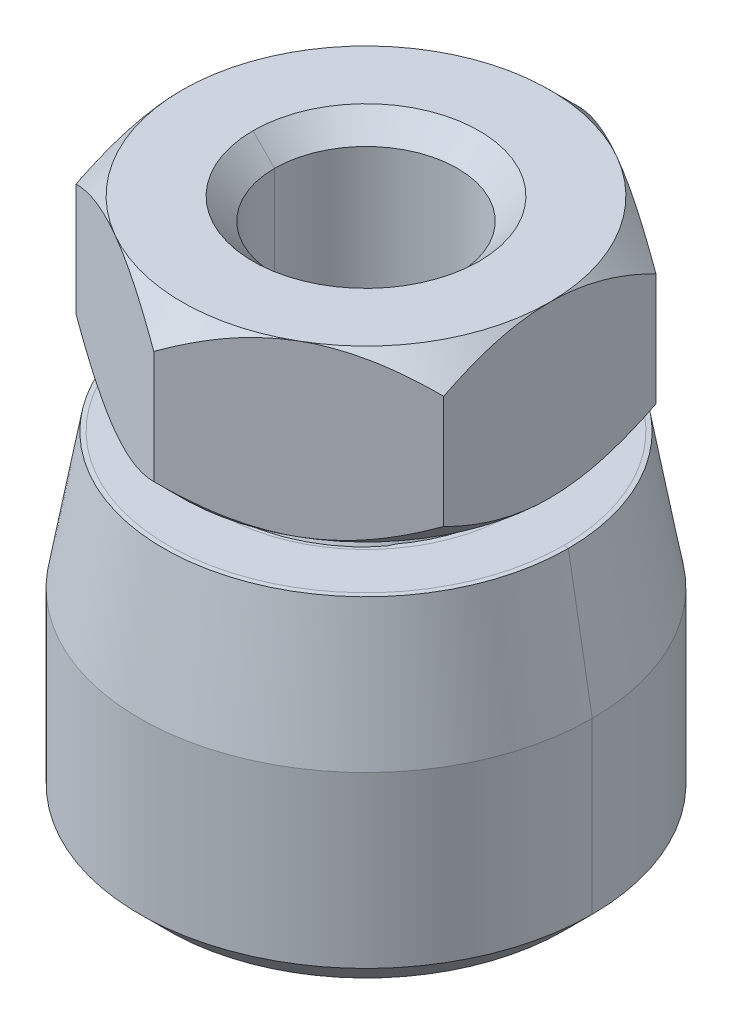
ISO-10303-21;
HEADER;
FILE_DESCRIPTION(('STEP AP214'),'2;1');
FILE_NAME('part.step','',(''),(''),'','','');
FILE_SCHEMA(('AUTOMOTIVE_DESIGN { 1 0 10303 214 1 1 1 1 }'));
ENDSEC;
DATA;
#1=APPLICATION_CONTEXT('core data for automotive mechanical design processes');
#2=APPLICATION_PROTOCOL_DEFINITION('international standard','automotive_design',2000,#1);
#3=PRODUCT_CONTEXT('',#1,'mechanical');
#4=PRODUCT('Part','Part','',(#3));
#5=PRODUCT_RELATED_PRODUCT_CATEGORY('part','',(#4));
#6=PRODUCT_DEFINITION_FORMATION('','',#4);
#7=PRODUCT_DEFINITION_CONTEXT('part definition',#1,'design');
#8=PRODUCT_DEFINITION('design','',#6,#7);
#9=PRODUCT_DEFINITION_SHAPE('','',#8);
#10=(LENGTH_UNIT() NAMED_UNIT(*) SI_UNIT(.MILLI.,.METRE.));
#11=(NAMED_UNIT(*) PLANE_ANGLE_UNIT() SI_UNIT($,.RADIAN.));
#12=(NAMED_UNIT(*) SI_UNIT($,.STERADIAN.) SOLID_ANGLE_UNIT());
#13=UNCERTAINTY_MEASURE_WITH_UNIT(LENGTH_MEASURE(1.E-05),#10,'distance_accuracy_value','');
#14=(GEOMETRIC_REPRESENTATION_CONTEXT(3) GLOBAL_UNCERTAINTY_ASSIGNED_CONTEXT((#13)) GLOBAL_UNIT_ASSIGNED_CONTEXT((#10,
#11,#12)) REPRESENTATION_CONTEXT('',''));
#15=CARTESIAN_POINT('',(0.,0.,0.));
#16=DIRECTION('',(0.,0.,1.));
#17=DIRECTION('',(1.,0.,0.));
#18=AXIS2_PLACEMENT_3D('',#15,#16,#17);
#19=CARTESIAN_POINT('',(-0.1,4.66760424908,0.));
#20=DIRECTION('',(0.,-1.,0.));
#21=DIRECTION('',(1.,0.,0.));
#22=AXIS2_PLACEMENT_3D('',#19,#20,#21);
#23=PLANE('',#22);
#24=CARTESIAN_POINT('',(0.,4.66760424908,0.));
#25=DIRECTION('',(0.,1.,0.));
#26=DIRECTION('',(0.,0.,1.));
#27=AXIS2_PLACEMENT_3D('',#24,#25,#26);
#28=CIRCLE('',#27,0.1);
#29=CARTESIAN_POINT('',(-0.1,4.66760424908,0.));
#30=VERTEX_POINT('',#29);
#31=CARTESIAN_POINT('',(0.1,4.66760424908,0.));
#32=VERTEX_POINT('',#31);
#33=EDGE_CURVE('P0_E175',#30,#32,#28,.F.);
#34=ORIENTED_EDGE('',*,*,#33,.T.);
#35=CARTESIAN_POINT('',(0.,4.66760424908,0.));
#36=DIRECTION('',(0.,1.,0.));
#37=DIRECTION('',(0.,0.,1.));
#38=AXIS2_PLACEMENT_3D('',#35,#36,#37);
#39=CIRCLE('',#38,0.1);
#40=EDGE_CURVE('P0_E178',#32,#30,#39,.F.);
#41=ORIENTED_EDGE('',*,*,#40,.T.);
#42=EDGE_LOOP('',(#34,#41));
#43=FACE_BOUND('',#42,.T.);
#44=ADVANCED_FACE('P0_F17',(#43),#23,.T.);
#45=CARTESIAN_POINT('',(0.,10.,-5.43333333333));
#46=CARTESIAN_POINT('',(0.853466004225,10.,-5.43333333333));
#47=CARTESIAN_POINT('',(1.70693200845,10.,-5.26575567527));
#48=CARTESIAN_POINT('',(2.51646834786,10.,-4.93043474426));
#49=CARTESIAN_POINT('',(3.96044214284,10.,-3.96044214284));
#50=CARTESIAN_POINT('',(4.93043474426,10.,-2.51646834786));
#51=CARTESIAN_POINT('',(5.26575567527,10.,-1.70693200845));
#52=CARTESIAN_POINT('',(5.60091099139,10.,0.));
#53=CARTESIAN_POINT('',(5.26575567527,10.,1.70693200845));
#54=CARTESIAN_POINT('',(4.93043474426,10.,2.51646834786));
#55=CARTESIAN_POINT('',(3.96044214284,10.,3.96044214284));
#56=CARTESIAN_POINT('',(2.51646834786,10.,4.93043474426));
#57=CARTESIAN_POINT('',(1.70693200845,10.,5.26575567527));
#58=CARTESIAN_POINT('',(0.853466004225,10.,5.43333333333));
#59=CARTESIAN_POINT('',(0.,10.,5.43333333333));
#60=(BOUNDED_CURVE() B_SPLINE_CURVE(5,(#45,#46,#47,#48,#49,#50,#51,#52,#53,#54,#55,#56,#57,#58,
#59),.UNSPECIFIED.,.F.,.F.) B_SPLINE_CURVE_WITH_KNOTS((6,3,3,3,6),(0.,4.26733002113,
8.53466004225,12.8019900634,17.0693200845),
.UNSPECIFIED.) CURVE() GEOMETRIC_REPRESENTATION_ITEM() RATIONAL_B_SPLINE_CURVE((1.,1.,1.,1.,1.,
1.,1.,1.,1.,1.,1.,1.,1.,1.,1.)) REPRESENTATION_ITEM(''));
#61=CARTESIAN_POINT('',(0.,10.,0.));
#62=DIRECTION('',(0.,0.,-1.));
#63=AXIS1_PLACEMENT('',#61,#62);
#64=SURFACE_OF_REVOLUTION('',#60,#63);
#65=CARTESIAN_POINT('',(0.,4.56758699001,0.));
#66=DIRECTION('',(0.,1.,0.));
#67=DIRECTION('',(0.,0.,1.));
#68=AXIS2_PLACEMENT_3D('',#65,#66,#67);
#69=CIRCLE('',#68,0.1);
#70=CARTESIAN_POINT('',(-0.1,4.56758699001,0.));
#71=VERTEX_POINT('',#70);
#72=CARTESIAN_POINT('',(0.1,4.56758699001,0.));
#73=VERTEX_POINT('',#72);
#74=EDGE_CURVE('P0_E20',#71,#73,#69,.T.);
#75=ORIENTED_EDGE('',*,*,#74,.T.);
#76=CARTESIAN_POINT('',(0.,4.56758699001,0.));
#77=DIRECTION('',(0.,1.,0.));
#78=DIRECTION('',(0.,0.,1.));
#79=AXIS2_PLACEMENT_3D('',#76,#77,#78);
#80=CIRCLE('',#79,0.1);
#81=EDGE_CURVE('P0_E171',#73,#71,#80,.T.);
#82=ORIENTED_EDGE('',*,*,#81,.T.);
#83=EDGE_LOOP('',(#75,#82));
#84=FACE_BOUND('',#83,.T.);
#85=CARTESIAN_POINT('',(0.,10.,-5.43333333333));
#86=CARTESIAN_POINT('',(0.0889027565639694,10.,-5.43333529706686));
#87=CARTESIAN_POINT('',(0.177805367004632,10.,-5.43115140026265));
#88=CARTESIAN_POINT('',(0.355396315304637,10.,-5.42242523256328));
#89=CARTESIAN_POINT('',(0.444084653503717,10.,-5.41588296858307));
#90=CARTESIAN_POINT('',(0.621033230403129,10.,-5.3984534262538));
#91=CARTESIAN_POINT('',(0.709293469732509,10.,-5.38756615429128));
#92=CARTESIAN_POINT('',(0.885173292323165,10.,-5.36147363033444));
#93=CARTESIAN_POINT('',(0.972792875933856,10.,-5.34626838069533));
#94=CARTESIAN_POINT('',(1.14718040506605,10.,-5.31157669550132));
#95=CARTESIAN_POINT('',(1.23394835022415,10.,-5.29209025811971));
#96=CARTESIAN_POINT('',(1.40642371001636,10.,-5.24888354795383));
#97=CARTESIAN_POINT('',(1.49213112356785,10.,-5.22516327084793));
#98=CARTESIAN_POINT('',(1.66227907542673,10.,-5.1735463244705));
#99=CARTESIAN_POINT('',(1.74671961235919,10.,-5.14564965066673));
#100=CARTESIAN_POINT('',(1.91413048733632,10.,-5.08574732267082));
#101=CARTESIAN_POINT('',(1.9971008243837,10.,-5.05374166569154));
#102=CARTESIAN_POINT('',(2.16137146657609,10.,-4.98569853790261));
#103=CARTESIAN_POINT('',(2.2426717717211,10.,-4.94966106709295));
#104=CARTESIAN_POINT('',(2.40340647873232,10.,-4.8736410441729));
#105=CARTESIAN_POINT('',(2.48284088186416,10.,-4.83365849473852));
#106=CARTESIAN_POINT('',(2.63965234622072,10.,-4.74984441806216));
#107=CARTESIAN_POINT('',(2.71702940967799,10.,-4.70601289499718));
#108=CARTESIAN_POINT('',(2.86953966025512,10.,-4.61460615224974));
#109=CARTESIAN_POINT('',(2.94467284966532,10.,-4.56703093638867));
#110=CARTESIAN_POINT('',(3.09251419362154,10.,-4.46825107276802));
#111=CARTESIAN_POINT('',(3.16522234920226,10.,-4.41704642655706));
#112=CARTESIAN_POINT('',(3.30803831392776,10.,-4.31113075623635));
#113=CARTESIAN_POINT('',(3.37814612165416,10.,-4.25641973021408));
#114=CARTESIAN_POINT('',(3.51559239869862,10.,-4.14362294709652));
#115=CARTESIAN_POINT('',(3.58293086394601,10.,-4.085537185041));
#116=CARTESIAN_POINT('',(3.71467624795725,10.,-3.9661309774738));
#117=CARTESIAN_POINT('',(3.77908316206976,10.,-3.90481052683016));
#118=CARTESIAN_POINT('',(3.904810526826,9.99999999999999,-3.77908316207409));
#119=CARTESIAN_POINT('',(3.96613097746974,9.99999999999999,-3.71467624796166));
#120=CARTESIAN_POINT('',(4.08553718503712,10.,-3.58293086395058));
#121=CARTESIAN_POINT('',(4.14362294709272,10.,-3.51559239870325));
#122=CARTESIAN_POINT('',(4.25641973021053,10.,-3.37814612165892));
#123=CARTESIAN_POINT('',(4.31113075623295,10.,-3.30803831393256));
#124=CARTESIAN_POINT('',(4.41704642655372,10.,-3.16522234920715));
#125=CARTESIAN_POINT('',(4.46825107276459,10.,-3.09251419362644));
#126=CARTESIAN_POINT('',(4.56703093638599,10.,-2.9446728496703));
#127=CARTESIAN_POINT('',(4.61460615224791,10.,-2.86953966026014));
#128=CARTESIAN_POINT('',(4.70601289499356,10.,-2.71702940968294));
#129=CARTESIAN_POINT('',(4.74984441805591,10.,-2.63965234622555));
#130=CARTESIAN_POINT('',(4.83365849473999,10.,-2.48284088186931));
#131=CARTESIAN_POINT('',(4.87364104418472,10.,-2.4034064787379));
#132=CARTESIAN_POINT('',(4.94966106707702,10.,-2.24267177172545));
#133=CARTESIAN_POINT('',(4.98569853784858,10.,-2.16137146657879));
#134=CARTESIAN_POINT('',(5.05374166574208,10.,-1.99710082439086));
#135=CARTESIAN_POINT('',(5.08574732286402,10.,-1.91413048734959));
#136=CARTESIAN_POINT('',(5.14564965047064,10.,-1.74671961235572));
#137=CARTESIAN_POINT('',(5.17354632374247,10.,-1.6622790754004));
#138=CARTESIAN_POINT('',(5.22516327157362,10.,-1.49213112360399));
#139=CARTESIAN_POINT('',(5.24888355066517,10.,-1.40642371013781));
#140=CARTESIAN_POINT('',(5.29209025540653,10.,-1.2339483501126));
#141=CARTESIAN_POINT('',(5.31157668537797,10.,-1.14718040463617));
#142=CARTESIAN_POINT('',(5.34626839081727,10.,-0.972792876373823));
#143=CARTESIAN_POINT('',(5.36147366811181,9.99999999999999,-0.885173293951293));
#144=CARTESIAN_POINT('',(5.38756611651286,9.99999999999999,-0.709293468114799));
#145=CARTESIAN_POINT('',(5.39845328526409,10.,-0.621033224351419));
#146=CARTESIAN_POINT('',(5.41588310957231,10.,-0.444084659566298));
#147=CARTESIAN_POINT('',(5.42242575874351,10.,-0.355396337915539));
#148=CARTESIAN_POINT('',(5.43115087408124,10.,-0.177805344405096));
#149=CARTESIAN_POINT('',(5.43333333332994,10.,-0.0889026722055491));
#150=CARTESIAN_POINT('',(5.43333333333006,10.,0.0889026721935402));
#151=CARTESIAN_POINT('',(5.43115087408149,10.,0.177805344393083));
#152=CARTESIAN_POINT('',(5.42242575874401,10.,0.355396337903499));
#153=CARTESIAN_POINT('',(5.41588310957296,10.,0.444084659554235));
#154=CARTESIAN_POINT('',(5.39845328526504,10.,0.62103322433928));
#155=CARTESIAN_POINT('',(5.38756611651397,10.,0.709293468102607));
#156=CARTESIAN_POINT('',(5.36147366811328,10.,0.885173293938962));
#157=CARTESIAN_POINT('',(5.34626839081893,10.,0.972792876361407));
#158=CARTESIAN_POINT('',(5.31157668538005,10.,1.14718040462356));
#159=CARTESIAN_POINT('',(5.29209025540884,10.,1.23394835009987));
#160=CARTESIAN_POINT('',(5.24888355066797,10.,1.40642371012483));
#161=CARTESIAN_POINT('',(5.22516327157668,10.,1.49213112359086));
#162=CARTESIAN_POINT('',(5.17354632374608,10.,1.66227907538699));
#163=CARTESIAN_POINT('',(5.14564965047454,10.,1.74671961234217));
#164=CARTESIAN_POINT('',(5.08574732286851,10.,1.91413048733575));
#165=CARTESIAN_POINT('',(5.05374166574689,9.99999999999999,1.99710082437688));
#166=CARTESIAN_POINT('',(4.98569853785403,9.99999999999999,2.16137146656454));
#167=CARTESIAN_POINT('',(4.94966106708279,10.,2.24267177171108));
#168=CARTESIAN_POINT('',(4.87364104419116,10.,2.40340647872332));
#169=CARTESIAN_POINT('',(4.83365849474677,10.,2.48284088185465));
#170=CARTESIAN_POINT('',(4.74984441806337,10.,2.63965234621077));
#171=CARTESIAN_POINT('',(4.70601289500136,10.,2.71702940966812));
#172=CARTESIAN_POINT('',(4.61460615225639,10.,2.8695396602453));
#173=CARTESIAN_POINT('',(4.56703093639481,10.,2.94467284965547));
#174=CARTESIAN_POINT('',(4.46825107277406,10.,3.09251419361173));
#175=CARTESIAN_POINT('',(4.41704642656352,10.,3.16522234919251));
#176=CARTESIAN_POINT('',(4.31113075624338,9.99999999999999,3.30803831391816));
#177=CARTESIAN_POINT('',(4.25641973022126,9.99999999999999,3.37814612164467));
#178=CARTESIAN_POINT('',(4.14362294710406,9.99999999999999,3.51559239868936));
#179=CARTESIAN_POINT('',(4.08553718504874,10.,3.58293086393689));
#180=CARTESIAN_POINT('',(3.96613097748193,10.,3.71467624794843));
#181=CARTESIAN_POINT('',(3.90481052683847,10.,3.7790831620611));
#182=CARTESIAN_POINT('',(3.77908316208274,9.99999999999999,3.90481052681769));
#183=CARTESIAN_POINT('',(3.71467624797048,9.99999999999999,3.96613097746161));
#184=CARTESIAN_POINT('',(3.5829308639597,10.,4.08553718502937));
#185=CARTESIAN_POINT('',(3.51559239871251,10.,4.14362294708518));
#186=CARTESIAN_POINT('',(3.3781461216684,10.,4.25641973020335));
#187=CARTESIAN_POINT('',(3.30803831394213,10.,4.31113075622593));
#188=CARTESIAN_POINT('',(3.16522234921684,10.,4.41704642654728));
#189=CARTESIAN_POINT('',(3.09251419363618,10.,4.46825107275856));
#190=CARTESIAN_POINT('',(2.94467284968,10.,4.56703093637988));
#191=CARTESIAN_POINT('',(2.86953966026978,10.,4.6146061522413));
#192=CARTESIAN_POINT('',(2.71702940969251,10.,4.70601289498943));
#193=CARTESIAN_POINT('',(2.63965234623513,10.,4.74984441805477));
#194=CARTESIAN_POINT('',(2.48284088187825,10.,4.83365849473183));
#195=CARTESIAN_POINT('',(2.4034064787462,10.,4.87364104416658));
#196=CARTESIAN_POINT('',(2.24267177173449,10.,4.94966106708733));
#197=CARTESIAN_POINT('',(2.16137146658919,10.,4.98569853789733));
#198=CARTESIAN_POINT('',(1.99710082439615,10.,5.05374166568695));
#199=CARTESIAN_POINT('',(1.9141304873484,10.,5.08574732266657));
#200=CARTESIAN_POINT('',(1.74671961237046,10.,5.14564965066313));
#201=CARTESIAN_POINT('',(1.66227907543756,10.,5.17354632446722));
#202=CARTESIAN_POINT('',(1.49213112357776,10.,5.22516327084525));
#203=CARTESIAN_POINT('',(1.40642371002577,10.,5.24888354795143));
#204=CARTESIAN_POINT('',(1.23394835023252,10.,5.29209025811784));
#205=CARTESIAN_POINT('',(1.14718040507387,10.,5.31157669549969));
#206=CARTESIAN_POINT('',(0.972792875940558,10.,5.34626838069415));
#207=CARTESIAN_POINT('',(0.885173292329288,10.,5.36147363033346));
#208=CARTESIAN_POINT('',(0.709293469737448,10.,5.38756615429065));
#209=CARTESIAN_POINT('',(0.621033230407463,10.,5.39845342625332));
#210=CARTESIAN_POINT('',(0.44408465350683,10.,5.41588296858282));
#211=CARTESIAN_POINT('',(0.355396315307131,10.,5.42242523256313));
#212=CARTESIAN_POINT('',(0.177805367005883,10.,5.43115140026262));
#213=CARTESIAN_POINT('',(0.0889027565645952,10.,5.43333529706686));
#214=CARTESIAN_POINT('',(0.,10.,5.43333333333));
#215=B_SPLINE_CURVE_WITH_KNOTS('',3,(#85,#86,#87,#88,#89,#90,#91,#92,#93,#94,#95,#96,#97,#98,
#99,#100,#101,#102,#103,#104,#105,#106,#107,#108,#109,#110,#111,#112,#113,#114,#115,#116,#117,
#118,#119,#120,#121,#122,#123,#124,#125,#126,#127,#128,#129,#130,#131,#132,#133,#134,#135,#136,
#137,#138,#139,#140,#141,#142,#143,#144,#145,#146,#147,#148,#149,#150,#151,#152,#153,#154,#155,
#156,#157,#158,#159,#160,#161,#162,#163,#164,#165,#166,#167,#168,#169,#170,#171,#172,#173,#174,
#175,#176,#177,#178,#179,#180,#181,#182,#183,#184,#185,#186,#187,#188,#189,#190,#191,#192,#193,
#194,#195,#196,#197,#198,#199,#200,#201,#202,#203,#204,#205,#206,#207,#208,#209,#210,#211,#212,
#213,#214),.UNSPECIFIED.,.F.,.F.,(4,2,2,2,2,2,2,2,2,2,2,2,2,2,2,2,2,2,2,2,2,2,2,2,2,2,2,2,2,2,2,
2,2,2,2,2,2,2,2,2,2,2,2,2,2,2,2,2,2,2,2,2,2,2,2,2,2,2,2,2,2,2,2,2,4),(0.,0.26668123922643,
0.533362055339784,0.800042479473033,1.06672275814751,1.33340315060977,1.6000838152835,
1.86676476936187,2.13344590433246,2.40012703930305,2.66680799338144,2.93348865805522,
3.20016905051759,3.46684932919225,3.73352975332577,4.00021056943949,4.26689180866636,
4.53357304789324,4.80025386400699,5.06693428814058,5.33361456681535,5.60029495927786,
5.8669756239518,6.13365657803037,6.40033771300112,6.66701884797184,6.9336998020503,
7.20038046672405,7.46706085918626,7.73374113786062,8.00042156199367,8.26710237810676,
8.53378361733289,8.80046485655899,9.06714567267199,9.33382609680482,9.60050637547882,
9.86718676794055,10.1338674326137,10.4005483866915,10.6672295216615,10.9339106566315,
11.2005916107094,11.4672722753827,11.7339526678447,12.0006329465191,12.2673133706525,
12.5339941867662,12.800675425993,13.0673566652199,13.3340374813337,13.6007179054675,
13.8673981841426,14.1340785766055,14.4007592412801,14.6674401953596,14.9341213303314,
15.2008024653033,15.4674834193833,15.7341640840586,16.0008444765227,16.267524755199,
16.5342051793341,16.8008859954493,17.0675672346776),.UNSPECIFIED.);
#216=CARTESIAN_POINT('',(0.,10.,-5.38333333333));
#217=VERTEX_POINT('',#216);
#218=CARTESIAN_POINT('',(0.,10.,5.38333333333));
#219=VERTEX_POINT('',#218);
#220=EDGE_CURVE('P0_E187',#217,#219,#215,.T.);
#221=ORIENTED_EDGE('',*,*,#220,.T.);
#222=CARTESIAN_POINT('',(0.,10.,5.43333333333));
#223=CARTESIAN_POINT('',(-0.0889027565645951,9.99999999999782,5.43333529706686));
#224=CARTESIAN_POINT('',(-0.177805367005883,9.99999999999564,5.43115140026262));
#225=CARTESIAN_POINT('',(-0.355396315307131,9.99999999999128,5.42242523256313));
#226=CARTESIAN_POINT('',(-0.44408465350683,9.99999999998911,5.41588296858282));
#227=CARTESIAN_POINT('',(-0.621033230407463,9.99999999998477,5.39845342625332));
#228=CARTESIAN_POINT('',(-0.709293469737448,9.9999999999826,5.38756615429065));
#229=CARTESIAN_POINT('',(-0.885173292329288,9.99999999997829,5.36147363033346));
#230=CARTESIAN_POINT('',(-0.972792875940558,9.99999999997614,5.34626838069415));
#231=CARTESIAN_POINT('',(-1.14718040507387,9.99999999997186,5.31157669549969));
#232=CARTESIAN_POINT('',(-1.23394835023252,9.99999999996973,5.29209025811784));
#233=CARTESIAN_POINT('',(-1.40642371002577,9.9999999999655,5.24888354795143));
#234=CARTESIAN_POINT('',(-1.49213112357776,9.99999999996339,5.22516327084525));
#235=CARTESIAN_POINT('',(-1.66227907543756,9.99999999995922,5.17354632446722));
#236=CARTESIAN_POINT('',(-1.74671961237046,9.99999999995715,5.14564965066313));
#237=CARTESIAN_POINT('',(-1.9141304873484,9.99999999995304,5.08574732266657));
#238=CARTESIAN_POINT('',(-1.99710082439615,9.99999999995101,5.05374166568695));
#239=CARTESIAN_POINT('',(-2.16137146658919,9.99999999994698,4.98569853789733));
#240=CARTESIAN_POINT('',(-2.24267177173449,9.99999999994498,4.94966106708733));
#241=CARTESIAN_POINT('',(-2.4034064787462,9.99999999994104,4.87364104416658));
#242=CARTESIAN_POINT('',(-2.48284088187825,9.99999999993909,4.83365849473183));
#243=CARTESIAN_POINT('',(-2.63965234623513,9.99999999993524,4.74984441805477));
#244=CARTESIAN_POINT('',(-2.71702940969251,9.99999999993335,4.70601289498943));
#245=CARTESIAN_POINT('',(-2.86953966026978,9.9999999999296,4.6146061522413));
#246=CARTESIAN_POINT('',(-2.94467284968,9.99999999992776,4.56703093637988));
#247=CARTESIAN_POINT('',(-3.09251419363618,9.99999999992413,4.46825107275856));
#248=CARTESIAN_POINT('',(-3.16522234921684,9.99999999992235,4.41704642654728));
#249=CARTESIAN_POINT('',(-3.30803831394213,9.99999999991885,4.31113075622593));
#250=CARTESIAN_POINT('',(-3.3781461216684,9.99999999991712,4.25641973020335));
#251=CARTESIAN_POINT('',(-3.51559239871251,9.99999999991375,4.14362294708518));
#252=CARTESIAN_POINT('',(-3.5829308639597,9.99999999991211,4.08553718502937));
#253=CARTESIAN_POINT('',(-3.71467624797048,9.99999999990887,3.96613097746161));
#254=CARTESIAN_POINT('',(-3.77908316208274,9.99999999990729,3.90481052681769));
#255=CARTESIAN_POINT('',(-3.90481052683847,9.9999999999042,3.7790831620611));
#256=CARTESIAN_POINT('',(-3.96613097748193,9.9999999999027,3.71467624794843));
#257=CARTESIAN_POINT('',(-4.08553718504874,9.99999999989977,3.58293086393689));
#258=CARTESIAN_POINT('',(-4.14362294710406,9.99999999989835,3.51559239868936));
#259=CARTESIAN_POINT('',(-4.25641973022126,9.99999999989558,3.37814612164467));
#260=CARTESIAN_POINT('',(-4.31113075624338,9.99999999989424,3.30803831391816));
#261=CARTESIAN_POINT('',(-4.41704642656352,9.99999999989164,3.16522234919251));
#262=CARTESIAN_POINT('',(-4.46825107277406,9.99999999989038,3.09251419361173));
#263=CARTESIAN_POINT('',(-4.56703093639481,9.99999999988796,2.94467284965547));
#264=CARTESIAN_POINT('',(-4.61460615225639,9.99999999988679,2.8695396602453));
#265=CARTESIAN_POINT('',(-4.70601289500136,9.99999999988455,2.71702940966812));
#266=CARTESIAN_POINT('',(-4.74984441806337,9.99999999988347,2.63965234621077));
#267=CARTESIAN_POINT('',(-4.83365849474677,9.99999999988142,2.48284088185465));
#268=CARTESIAN_POINT('',(-4.87364104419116,9.99999999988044,2.40340647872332));
#269=CARTESIAN_POINT('',(-4.94966106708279,9.99999999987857,2.24267177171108));
#270=CARTESIAN_POINT('',(-4.98569853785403,9.99999999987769,2.16137146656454));
#271=CARTESIAN_POINT('',(-5.05374166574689,9.99999999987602,1.99710082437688));
#272=CARTESIAN_POINT('',(-5.08574732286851,9.99999999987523,1.91413048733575));
#273=CARTESIAN_POINT('',(-5.14564965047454,9.99999999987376,1.74671961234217));
#274=CARTESIAN_POINT('',(-5.17354632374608,9.99999999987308,1.66227907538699));
#275=CARTESIAN_POINT('',(-5.22516327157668,9.99999999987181,1.49213112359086));
#276=CARTESIAN_POINT('',(-5.24888355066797,9.99999999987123,1.40642371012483));
#277=CARTESIAN_POINT('',(-5.29209025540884,9.99999999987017,1.23394835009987));
#278=CARTESIAN_POINT('',(-5.31157668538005,9.99999999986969,1.14718040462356));
#279=CARTESIAN_POINT('',(-5.34626839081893,9.99999999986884,0.972792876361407));
#280=CARTESIAN_POINT('',(-5.36147366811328,9.99999999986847,0.885173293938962));
#281=CARTESIAN_POINT('',(-5.38756611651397,9.99999999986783,0.709293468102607));
#282=CARTESIAN_POINT('',(-5.39845328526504,9.99999999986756,0.62103322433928));
#283=CARTESIAN_POINT('',(-5.41588310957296,9.99999999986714,0.444084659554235));
#284=CARTESIAN_POINT('',(-5.42242575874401,9.99999999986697,0.355396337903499));
#285=CARTESIAN_POINT('',(-5.43115087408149,9.99999999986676,0.177805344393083));
#286=CARTESIAN_POINT('',(-5.43333333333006,9.99999999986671,0.0889026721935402));
#287=CARTESIAN_POINT('',(-5.43333333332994,9.99999999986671,-0.0889026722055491));
#288=CARTESIAN_POINT('',(-5.43115087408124,9.99999999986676,-0.177805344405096));
#289=CARTESIAN_POINT('',(-5.42242575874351,9.99999999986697,-0.355396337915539));
#290=CARTESIAN_POINT('',(-5.41588310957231,9.99999999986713,-0.444084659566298));
#291=CARTESIAN_POINT('',(-5.39845328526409,9.99999999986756,-0.621033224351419));
#292=CARTESIAN_POINT('',(-5.38756611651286,9.99999999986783,-0.709293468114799));
#293=CARTESIAN_POINT('',(-5.36147366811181,9.99999999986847,-0.885173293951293));
#294=CARTESIAN_POINT('',(-5.34626839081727,9.99999999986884,-0.972792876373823));
#295=CARTESIAN_POINT('',(-5.31157668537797,9.99999999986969,-1.14718040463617));
#296=CARTESIAN_POINT('',(-5.29209025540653,9.99999999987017,-1.2339483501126));
#297=CARTESIAN_POINT('',(-5.24888355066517,9.99999999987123,-1.40642371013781));
#298=CARTESIAN_POINT('',(-5.22516327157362,9.99999999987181,-1.49213112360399));
#299=CARTESIAN_POINT('',(-5.17354632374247,9.99999999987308,-1.6622790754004));
#300=CARTESIAN_POINT('',(-5.14564965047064,9.99999999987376,-1.74671961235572));
#301=CARTESIAN_POINT('',(-5.08574732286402,9.99999999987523,-1.91413048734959));
#302=CARTESIAN_POINT('',(-5.05374166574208,9.99999999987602,-1.99710082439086));
#303=CARTESIAN_POINT('',(-4.98569853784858,9.99999999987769,-2.16137146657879));
#304=CARTESIAN_POINT('',(-4.94966106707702,9.99999999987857,-2.24267177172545));
#305=CARTESIAN_POINT('',(-4.87364104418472,9.99999999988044,-2.4034064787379));
#306=CARTESIAN_POINT('',(-4.83365849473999,9.99999999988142,-2.48284088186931));
#307=CARTESIAN_POINT('',(-4.74984441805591,9.99999999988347,-2.63965234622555));
#308=CARTESIAN_POINT('',(-4.70601289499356,9.99999999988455,-2.71702940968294));
#309=CARTESIAN_POINT('',(-4.61460615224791,9.99999999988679,-2.86953966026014));
#310=CARTESIAN_POINT('',(-4.56703093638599,9.99999999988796,-2.9446728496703));
#311=CARTESIAN_POINT('',(-4.46825107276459,9.99999999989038,-3.09251419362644));
#312=CARTESIAN_POINT('',(-4.41704642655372,9.99999999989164,-3.16522234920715));
#313=CARTESIAN_POINT('',(-4.31113075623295,9.99999999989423,-3.30803831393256));
#314=CARTESIAN_POINT('',(-4.25641973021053,9.99999999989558,-3.37814612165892));
#315=CARTESIAN_POINT('',(-4.14362294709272,9.99999999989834,-3.51559239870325));
#316=CARTESIAN_POINT('',(-4.08553718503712,9.99999999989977,-3.58293086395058));
#317=CARTESIAN_POINT('',(-3.96613097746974,9.99999999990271,-3.71467624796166));
#318=CARTESIAN_POINT('',(-3.904810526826,9.9999999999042,-3.77908316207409));
#319=CARTESIAN_POINT('',(-3.77908316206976,9.99999999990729,-3.90481052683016));
#320=CARTESIAN_POINT('',(-3.71467624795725,9.99999999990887,-3.9661309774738));
#321=CARTESIAN_POINT('',(-3.58293086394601,9.9999999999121,-4.085537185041));
#322=CARTESIAN_POINT('',(-3.51559239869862,9.99999999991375,-4.14362294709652));
#323=CARTESIAN_POINT('',(-3.37814612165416,9.99999999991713,-4.25641973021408));
#324=CARTESIAN_POINT('',(-3.30803831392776,9.99999999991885,-4.31113075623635));
#325=CARTESIAN_POINT('',(-3.16522234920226,9.99999999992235,-4.41704642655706));
#326=CARTESIAN_POINT('',(-3.09251419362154,9.99999999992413,-4.46825107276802));
#327=CARTESIAN_POINT('',(-2.94467284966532,9.99999999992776,-4.56703093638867));
#328=CARTESIAN_POINT('',(-2.86953966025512,9.9999999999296,-4.61460615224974));
#329=CARTESIAN_POINT('',(-2.71702940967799,9.99999999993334,-4.70601289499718));
#330=CARTESIAN_POINT('',(-2.63965234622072,9.99999999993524,-4.74984441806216));
#331=CARTESIAN_POINT('',(-2.48284088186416,9.99999999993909,-4.83365849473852));
#332=CARTESIAN_POINT('',(-2.40340647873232,9.99999999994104,-4.8736410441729));
#333=CARTESIAN_POINT('',(-2.2426717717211,9.99999999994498,-4.94966106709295));
#334=CARTESIAN_POINT('',(-2.16137146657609,9.99999999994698,-4.98569853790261));
#335=CARTESIAN_POINT('',(-1.9971008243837,9.999999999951,-5.05374166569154));
#336=CARTESIAN_POINT('',(-1.91413048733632,9.99999999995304,-5.08574732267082));
#337=CARTESIAN_POINT('',(-1.74671961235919,9.99999999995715,-5.14564965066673));
#338=CARTESIAN_POINT('',(-1.66227907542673,9.99999999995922,-5.1735463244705));
#339=CARTESIAN_POINT('',(-1.49213112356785,9.99999999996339,-5.22516327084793));
#340=CARTESIAN_POINT('',(-1.40642371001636,9.9999999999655,-5.24888354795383));
#341=CARTESIAN_POINT('',(-1.23394835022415,9.99999999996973,-5.29209025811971));
#342=CARTESIAN_POINT('',(-1.14718040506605,9.99999999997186,-5.31157669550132));
#343=CARTESIAN_POINT('',(-0.972792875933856,9.99999999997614,-5.34626838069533));
#344=CARTESIAN_POINT('',(-0.885173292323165,9.99999999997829,-5.36147363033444));
#345=CARTESIAN_POINT('',(-0.709293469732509,9.9999999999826,-5.38756615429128));
#346=CARTESIAN_POINT('',(-0.621033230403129,9.99999999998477,-5.3984534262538));
#347=CARTESIAN_POINT('',(-0.444084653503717,9.9999999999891,-5.41588296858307));
#348=CARTESIAN_POINT('',(-0.355396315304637,9.99999999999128,-5.42242523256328));
#349=CARTESIAN_POINT('',(-0.177805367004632,9.99999999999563,-5.43115140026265));
#350=CARTESIAN_POINT('',(-0.0889027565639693,9.99999999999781,-5.43333529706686));
#351=CARTESIAN_POINT('',(0.,10.,-5.43333333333));
#352=B_SPLINE_CURVE_WITH_KNOTS('',3,(#222,#223,#224,#225,#226,#227,#228,#229,#230,#231,#232,
#233,#234,#235,#236,#237,#238,#239,#240,#241,#242,#243,#244,#245,#246,#247,#248,#249,#250,#251,
#252,#253,#254,#255,#256,#257,#258,#259,#260,#261,#262,#263,#264,#265,#266,#267,#268,#269,#270,
#271,#272,#273,#274,#275,#276,#277,#278,#279,#280,#281,#282,#283,#284,#285,#286,#287,#288,#289,
#290,#291,#292,#293,#294,#295,#296,#297,#298,#299,#300,#301,#302,#303,#304,#305,#306,#307,#308,
#309,#310,#311,#312,#313,#314,#315,#316,#317,#318,#319,#320,#321,#322,#323,#324,#325,#326,#327,
#328,#329,#330,#331,#332,#333,#334,#335,#336,#337,#338,#339,#340,#341,#342,#343,#344,#345,#346,
#347,#348,#349,#350,#351),.UNSPECIFIED.,.F.,.F.,(4,2,2,2,2,2,2,2,2,2,2,2,2,2,2,2,2,2,2,2,2,2,2,
2,2,2,2,2,2,2,2,2,2,2,2,2,2,2,2,2,2,2,2,2,2,2,2,2,2,2,2,2,2,2,2,2,2,2,2,2,2,2,2,2,4),(0.,
0.266681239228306,0.533362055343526,0.800042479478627,1.06672275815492,1.33340315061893,
1.60008381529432,1.86676476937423,2.13344590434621,2.40012703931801,2.66680799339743,
2.93348865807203,3.200169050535,3.46684932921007,3.73352975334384,4.00021056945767,
4.26689180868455,4.53357304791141,4.80025386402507,5.06693428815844,5.33361456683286,
5.60029495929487,5.86697562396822,6.13365657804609,6.40033771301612,6.66701884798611,
6.93369980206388,7.20038046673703,7.46706085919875,7.73374113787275,8.00042156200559,
8.26710237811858,8.53378361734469,8.80046485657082,9.06714567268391,9.33382609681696,
9.60050637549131,9.86718676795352,10.1338674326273,10.4005483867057,10.6672295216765,
10.9339106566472,11.2005916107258,11.4672722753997,11.7339526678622,12.000632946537,
12.2673133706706,12.5339941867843,12.8006754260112,13.0673566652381,13.3340374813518,
13.6007179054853,13.86739818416,14.1340785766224,14.4007592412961,14.6674401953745,
14.9341213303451,15.2008024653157,15.4674834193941,15.7341640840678,16.0008444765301,
16.2675247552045,16.5342051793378,16.8008859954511,17.0675672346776),.UNSPECIFIED.);
#353=EDGE_CURVE('P0_E425',#219,#217,#352,.T.);
#354=ORIENTED_EDGE('',*,*,#353,.T.);
#355=EDGE_LOOP('',(#221,#354));
#356=FACE_BOUND('',#355,.T.);
#357=ADVANCED_FACE('P0_F172',(#84,#356),#64,.F.);
#358=CARTESIAN_POINT('',(0.,4.61759561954,0.));
#359=DIRECTION('',(0.,1.,0.));
#360=DIRECTION('',(0.,0.,1.));
#361=AXIS2_PLACEMENT_3D('',#358,#359,#360);
#362=CYLINDRICAL_SURFACE('',#361,0.1);
#363=DIRECTION('',(0.,1.,0.));
#364=VECTOR('',#363,1.);
#365=CARTESIAN_POINT('',(-0.1,4.61759561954,0.));
#366=LINE('',#365,#364);
#367=EDGE_CURVE('P0_E165',#30,#71,#366,.F.);
#368=ORIENTED_EDGE('',*,*,#367,.F.);
#369=ORIENTED_EDGE('',*,*,#40,.F.);
#370=DIRECTION('',(0.,1.,0.));
#371=VECTOR('',#370,1.);
#372=CARTESIAN_POINT('',(0.1,4.61759561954,0.));
#373=LINE('',#372,#371);
#374=EDGE_CURVE('P0_E168',#32,#73,#373,.F.);
#375=ORIENTED_EDGE('',*,*,#374,.T.);
#376=ORIENTED_EDGE('',*,*,#74,.F.);
#377=EDGE_LOOP('',(#368,#369,#375,#376));
#378=FACE_BOUND('',#377,.T.);
#379=ADVANCED_FACE('P0_F163',(#378),#362,.F.);
#380=CARTESIAN_POINT('',(0.,4.61759561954,0.));
#381=DIRECTION('',(0.,1.,0.));
#382=DIRECTION('',(0.,0.,1.));
#383=AXIS2_PLACEMENT_3D('',#380,#381,#382);
#384=CYLINDRICAL_SURFACE('',#383,0.1);
#385=ORIENTED_EDGE('',*,*,#367,.T.);
#386=ORIENTED_EDGE('',*,*,#81,.F.);
#387=ORIENTED_EDGE('',*,*,#374,.F.);
#388=ORIENTED_EDGE('',*,*,#33,.F.);
#389=EDGE_LOOP('',(#385,#386,#387,#388));
#390=FACE_BOUND('',#389,.T.);
#391=ADVANCED_FACE('P0_F176',(#390),#384,.F.);
#392=CARTESIAN_POINT('',(0.,7.33333333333,0.));
#393=DIRECTION('',(0.,1.,0.));
#394=DIRECTION('',(0.,0.,1.));
#395=AXIS2_PLACEMENT_3D('',#392,#393,#394);
#396=CONICAL_SURFACE('',#395,3.233,1.04719755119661);
#397=DIRECTION('',(0.866025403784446,0.499999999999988,0.));
#398=VECTOR('',#397,1.);
#399=CARTESIAN_POINT('',(1.6165,6.400046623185,0.));
#400=LINE('',#399,#398);
#401=CARTESIAN_POINT('',(0.,5.46675991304,0.));
#402=VERTEX_POINT('',#401);
#403=CARTESIAN_POINT('',(3.233,7.33333333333,0.));
#404=VERTEX_POINT('',#403);
#405=EDGE_CURVE('P0_E709',#402,#404,#400,.T.);
#406=ORIENTED_EDGE('',*,*,#405,.T.);
#407=CARTESIAN_POINT('',(0.,7.33333333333,0.));
#408=DIRECTION('',(0.,1.,0.));
#409=DIRECTION('',(0.,0.,1.));
#410=AXIS2_PLACEMENT_3D('',#407,#408,#409);
#411=CIRCLE('',#410,3.233);
#412=CARTESIAN_POINT('',(-3.233,7.33333333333,0.));
#413=VERTEX_POINT('',#412);
#414=EDGE_CURVE('P0_E703',#404,#413,#411,.T.);
#415=ORIENTED_EDGE('',*,*,#414,.T.);
#416=DIRECTION('',(0.866025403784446,-0.499999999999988,0.));
#417=VECTOR('',#416,1.);
#418=CARTESIAN_POINT('',(-1.6165,6.400046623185,0.));
#419=LINE('',#418,#417);
#420=EDGE_CURVE('P0_E706',#413,#402,#419,.T.);
#421=ORIENTED_EDGE('',*,*,#420,.T.);
#422=EDGE_LOOP('',(#406,#415,#421));
#423=FACE_BOUND('',#422,.T.);
#424=ADVANCED_FACE('P0_F747',(#423),#396,.F.);
#425=CARTESIAN_POINT('',(0.,7.33333333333,0.));
#426=DIRECTION('',(0.,1.,0.));
#427=DIRECTION('',(0.,0.,1.));
#428=AXIS2_PLACEMENT_3D('',#425,#426,#427);
#429=CONICAL_SURFACE('',#428,3.233,1.04719755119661);
#430=CARTESIAN_POINT('',(0.,7.33333333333,0.));
#431=DIRECTION('',(0.,1.,0.));
#432=DIRECTION('',(0.,0.,1.));
#433=AXIS2_PLACEMENT_3D('',#430,#431,#432);
#434=CIRCLE('',#433,3.233);
#435=EDGE_CURVE('P0_E697',#413,#404,#434,.T.);
#436=ORIENTED_EDGE('',*,*,#435,.T.);
#437=ORIENTED_EDGE('',*,*,#405,.F.);
#438=ORIENTED_EDGE('',*,*,#420,.F.);
#439=EDGE_LOOP('',(#436,#437,#438));
#440=FACE_BOUND('',#439,.T.);
#441=ADVANCED_FACE('P0_F750',(#440),#429,.F.);
#442=CARTESIAN_POINT('',(0.,12.7831666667,0.));
#443=DIRECTION('',(0.,1.,0.));
#444=DIRECTION('',(0.,0.,1.));
#445=AXIS2_PLACEMENT_3D('',#442,#443,#444);
#446=CYLINDRICAL_SURFACE('',#445,3.233);
#447=CARTESIAN_POINT('',(0.,18.233,0.));
#448=DIRECTION('',(0.,1.,0.));
#449=DIRECTION('',(1.,0.,0.));
#450=AXIS2_PLACEMENT_3D('',#447,#448,#449);
#451=CIRCLE('',#450,3.233);
#452=CARTESIAN_POINT('',(3.233,18.233,0.));
#453=VERTEX_POINT('',#452);
#454=CARTESIAN_POINT('',(-3.233,18.233,0.));
#455=VERTEX_POINT('',#454);
#456=EDGE_CURVE('P0_E691',#453,#455,#451,.T.);
#457=ORIENTED_EDGE('',*,*,#456,.T.);
#458=DIRECTION('',(0.,1.,0.));
#459=VECTOR('',#458,1.);
#460=CARTESIAN_POINT('',(-3.233,12.7831666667,0.));
#461=LINE('',#460,#459);
#462=EDGE_CURVE('P0_E700',#455,#413,#461,.F.);
#463=ORIENTED_EDGE('',*,*,#462,.T.);
#464=ORIENTED_EDGE('',*,*,#414,.F.);
#465=DIRECTION('',(0.,1.,0.));
#466=VECTOR('',#465,1.);
#467=CARTESIAN_POINT('',(3.233,12.7831666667,0.));
#468=LINE('',#467,#466);
#469=EDGE_CURVE('P0_E694',#404,#453,#468,.T.);
#470=ORIENTED_EDGE('',*,*,#469,.T.);
#471=EDGE_LOOP('',(#457,#463,#464,#470));
#472=FACE_BOUND('',#471,.T.);
#473=ADVANCED_FACE('P0_F754',(#472),#446,.F.);
#474=CARTESIAN_POINT('',(0.,12.7831666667,0.));
#475=DIRECTION('',(0.,1.,0.));
#476=DIRECTION('',(0.,0.,1.));
#477=AXIS2_PLACEMENT_3D('',#474,#475,#476);
#478=CYLINDRICAL_SURFACE('',#477,3.233);
#479=ORIENTED_EDGE('',*,*,#435,.F.);
#480=ORIENTED_EDGE('',*,*,#462,.F.);
#481=CARTESIAN_POINT('',(0.,18.233,0.));
#482=DIRECTION('',(0.,1.,0.));
#483=DIRECTION('',(1.,0.,0.));
#484=AXIS2_PLACEMENT_3D('',#481,#482,#483);
#485=CIRCLE('',#484,3.233);
#486=EDGE_CURVE('P0_E686',#455,#453,#485,.T.);
#487=ORIENTED_EDGE('',*,*,#486,.T.);
#488=ORIENTED_EDGE('',*,*,#469,.F.);
#489=EDGE_LOOP('',(#479,#480,#487,#488));
#490=FACE_BOUND('',#489,.T.);
#491=ADVANCED_FACE('P0_F758',(#490),#478,.F.);
#492=CARTESIAN_POINT('',(0.,19.,0.));
#493=DIRECTION('',(0.,1.,0.));
#494=DIRECTION('',(0.,0.,1.));
#495=AXIS2_PLACEMENT_3D('',#492,#493,#494);
#496=CONICAL_SURFACE('',#495,4.,0.785398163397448);
#497=CARTESIAN_POINT('',(0.,19.,0.));
#498=DIRECTION('',(0.,1.,0.));
#499=DIRECTION('',(0.,0.,1.));
#500=AXIS2_PLACEMENT_3D('',#497,#498,#499);
#501=CIRCLE('',#500,4.);
#502=CARTESIAN_POINT('',(-4.,19.,0.));
#503=VERTEX_POINT('',#502);
#504=CARTESIAN_POINT('',(4.,19.,0.));
#505=VERTEX_POINT('',#504);
#506=EDGE_CURVE('P0_E677',#503,#505,#501,.F.);
#507=ORIENTED_EDGE('',*,*,#506,.F.);
#508=DIRECTION('',(0.707106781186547,-0.707106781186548,0.));
#509=VECTOR('',#508,1.);
#510=CARTESIAN_POINT('',(-3.6165,18.6165,0.));
#511=LINE('',#510,#509);
#512=EDGE_CURVE('P0_E690',#503,#455,#511,.T.);
#513=ORIENTED_EDGE('',*,*,#512,.T.);
#514=ORIENTED_EDGE('',*,*,#456,.F.);
#515=DIRECTION('',(0.707106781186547,0.707106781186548,0.));
#516=VECTOR('',#515,1.);
#517=CARTESIAN_POINT('',(3.6165,18.6165,0.));
#518=LINE('',#517,#516);
#519=EDGE_CURVE('P0_E689',#453,#505,#518,.T.);
#520=ORIENTED_EDGE('',*,*,#519,.T.);
#521=EDGE_LOOP('',(#507,#513,#514,#520));
#522=FACE_BOUND('',#521,.T.);
#523=ADVANCED_FACE('P0_F761',(#522),#496,.F.);
#524=CARTESIAN_POINT('',(0.,19.,0.));
#525=DIRECTION('',(0.,1.,0.));
#526=DIRECTION('',(0.,0.,1.));
#527=AXIS2_PLACEMENT_3D('',#524,#525,#526);
#528=CONICAL_SURFACE('',#527,4.,0.785398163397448);
#529=ORIENTED_EDGE('',*,*,#486,.F.);
#530=ORIENTED_EDGE('',*,*,#512,.F.);
#531=CARTESIAN_POINT('',(0.,19.,0.));
#532=DIRECTION('',(0.,1.,0.));
#533=DIRECTION('',(0.,0.,1.));
#534=AXIS2_PLACEMENT_3D('',#531,#532,#533);
#535=CIRCLE('',#534,4.);
#536=EDGE_CURVE('P0_E666',#505,#503,#535,.F.);
#537=ORIENTED_EDGE('',*,*,#536,.F.);
#538=ORIENTED_EDGE('',*,*,#519,.F.);
#539=EDGE_LOOP('',(#529,#530,#537,#538));
#540=FACE_BOUND('',#539,.T.);
#541=ADVANCED_FACE('P0_F585',(#540),#528,.F.);
#542=CARTESIAN_POINT('',(0.,19.0000000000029,0.));
#543=DIRECTION('',(0.,-1.,0.));
#544=DIRECTION('',(0.,0.,-1.));
#545=AXIS2_PLACEMENT_3D('',#542,#543,#544);
#546=CONICAL_SURFACE('',#545,6.50000000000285,0.785398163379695);
#547=CARTESIAN_POINT('',(3.24999999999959,19.0000000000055,-5.6291651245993));
#548=CARTESIAN_POINT('',(3.33645158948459,19.0000115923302,-5.57925227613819));
#549=CARTESIAN_POINT('',(3.42289975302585,18.997700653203,-5.52934140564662));
#550=CARTESIAN_POINT('',(3.59560120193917,18.988519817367,-5.42963217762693));
#551=CARTESIAN_POINT('',(3.68185451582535,18.9816506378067,-5.37983380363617));
#552=CARTESIAN_POINT('',(3.8538545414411,18.9634553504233,-5.28052954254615));
#553=CARTESIAN_POINT('',(3.93960187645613,18.9521370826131,-5.23102329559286));
#554=CARTESIAN_POINT('',(4.1105856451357,18.9252066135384,-5.1323057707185));
#555=CARTESIAN_POINT('',(4.19582206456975,18.9095942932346,-5.08309450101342));
#556=CARTESIAN_POINT('',(4.44798802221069,18.857144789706,-4.93750641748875));
#557=CARTESIAN_POINT('',(4.61401577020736,18.8144031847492,-4.84165025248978));
#558=CARTESIAN_POINT('',(4.9428890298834,18.7149043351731,-4.65177518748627));
#559=CARTESIAN_POINT('',(5.10573352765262,18.6581427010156,-4.55775687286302));
#560=CARTESIAN_POINT('',(5.3720645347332,18.5544176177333,-4.40399059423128));
#561=CARTESIAN_POINT('',(5.47656672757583,18.5108742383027,-4.34365622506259));
#562=CARTESIAN_POINT('',(5.68403937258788,18.4192407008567,-4.22387183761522));
#563=CARTESIAN_POINT('',(5.78701014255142,18.371151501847,-4.16442163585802));
#564=CARTESIAN_POINT('',(5.9925166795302,18.2704176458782,-4.04577238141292));
#565=CARTESIAN_POINT('',(6.09503693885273,18.2177310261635,-3.98658228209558));
#566=CARTESIAN_POINT('',(6.29860581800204,18.1087088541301,-3.86905173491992));
#567=CARTESIAN_POINT('',(6.39965453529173,18.0523735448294,-3.81071123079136));
#568=CARTESIAN_POINT('',(6.50000000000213,17.9944465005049,-3.75277674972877));
#569=B_SPLINE_CURVE_WITH_KNOTS('',3,(#547,#548,#549,#550,#551,#552,#553,#554,#555,#556,#557,
#558,#559,#560,#561,#562,#563,#564,#565,#566,#567,#568),.UNSPECIFIED.,.F.,.F.,(4,2,2,2,2,2,2,2,
2,2,4),(0.,0.299443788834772,0.598840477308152,0.897711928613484,1.19659166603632,
1.78518874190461,2.373970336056,2.75873489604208,3.14341846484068,3.53207974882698,
3.92071517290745),.UNSPECIFIED.);
#570=CARTESIAN_POINT('',(3.25000000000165,18.9999999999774,-5.62916512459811));
#571=VERTEX_POINT('',#570);
#572=CARTESIAN_POINT('',(6.50000000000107,17.9944465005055,-3.75277674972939));
#573=VERTEX_POINT('',#572);
#574=EDGE_CURVE('P0_E589',#571,#573,#569,.T.);
#575=ORIENTED_EDGE('',*,*,#574,.F.);
#576=CARTESIAN_POINT('',(0.,19.0000000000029,0.));
#577=DIRECTION('',(0.,-1.,0.));
#578=DIRECTION('',(0.,0.,-1.));
#579=AXIS2_PLACEMENT_3D('',#576,#577,#578);
#580=CIRCLE('',#579,6.50000000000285);
#581=CARTESIAN_POINT('',(6.5,19.000000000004,-1.95957838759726E-07));
#582=VERTEX_POINT('',#581);
#583=EDGE_CURVE('P0_E714',#582,#571,#580,.F.);
#584=ORIENTED_EDGE('',*,*,#583,.F.);
#585=CARTESIAN_POINT('',(6.5,17.9944465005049,-3.75277674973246));
#586=CARTESIAN_POINT('',(6.5,18.0593736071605,-3.62290252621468));
#587=CARTESIAN_POINT('',(6.5,18.1222954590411,-3.49202403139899));
#588=CARTESIAN_POINT('',(6.5,18.2435158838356,-3.22805615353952));
#589=CARTESIAN_POINT('',(6.5,18.3018117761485,-3.09496554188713));
#590=CARTESIAN_POINT('',(6.5,18.4693896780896,-2.69070880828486));
#591=CARTESIAN_POINT('',(6.5,18.5705771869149,-2.41609279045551));
#592=CARTESIAN_POINT('',(6.5,18.7423570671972,-1.86594466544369));
#593=CARTESIAN_POINT('',(6.5,18.8137531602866,-1.59067114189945));
#594=CARTESIAN_POINT('',(6.5,18.8963516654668,-1.17336150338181));
#595=CARTESIAN_POINT('',(6.5,18.9197881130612,-1.03369886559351));
#596=CARTESIAN_POINT('',(6.5,18.9579775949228,-0.753207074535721));
#597=CARTESIAN_POINT('',(6.5,18.972733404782,-0.612378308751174));
#598=CARTESIAN_POINT('',(6.5,18.9885995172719,-0.392985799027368));
#599=CARTESIAN_POINT('',(6.5,18.9928603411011,-0.314638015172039));
#600=CARTESIAN_POINT('',(6.5,18.9985677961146,-0.157529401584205));
#601=CARTESIAN_POINT('',(6.5,19.0000032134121,-0.0787681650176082));
#602=CARTESIAN_POINT('',(6.5,19.0000000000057,-3.91915677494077E-07));
#603=B_SPLINE_CURVE_WITH_KNOTS('',3,(#585,#586,#587,#588,#589,#590,#591,#592,#593,#594,#595,
#596,#597,#598,#599,#600,#601,#602),.UNSPECIFIED.,.F.,.F.,(4,2,2,2,2,2,2,2,4),(0.,
0.435571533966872,0.871393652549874,1.74819660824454,2.59951689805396,3.02413779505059,
3.44862284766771,3.6839682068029,3.92024577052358),.UNSPECIFIED.);
#604=EDGE_CURVE('P0_E572',#573,#582,#603,.T.);
#605=ORIENTED_EDGE('',*,*,#604,.F.);
#606=EDGE_LOOP('',(#575,#584,#605));
#607=FACE_BOUND('',#606,.T.);
#608=ADVANCED_FACE('P0_F581',(#607),#546,.T.);
#609=CARTESIAN_POINT('',(0.,18.9999999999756,0.));
#610=DIRECTION('',(0.,-1.,0.));
#611=DIRECTION('',(0.,0.,-1.));
#612=AXIS2_PLACEMENT_3D('',#609,#610,#611);
#613=CONICAL_SURFACE('',#612,6.49999999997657,0.785398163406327);
#614=CARTESIAN_POINT('',(-3.2499999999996,18.999999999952,-5.6291651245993));
#615=CARTESIAN_POINT('',(-3.16354841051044,19.0000115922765,-5.6790779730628));
#616=CARTESIAN_POINT('',(-3.07710024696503,18.9977006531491,-5.72898884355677));
#617=CARTESIAN_POINT('',(-2.90439879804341,18.9885198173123,-5.82869807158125));
#618=CARTESIAN_POINT('',(-2.81814548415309,18.9816506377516,-5.8784964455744));
#619=CARTESIAN_POINT('',(-2.64614545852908,18.9634553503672,-5.97780070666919));
#620=CARTESIAN_POINT('',(-2.56039812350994,18.9521370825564,-6.02730695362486));
#621=CARTESIAN_POINT('',(-2.38941435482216,18.9252066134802,-6.12602447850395));
#622=CARTESIAN_POINT('',(-2.30417793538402,18.9095942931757,-6.1752357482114));
#623=CARTESIAN_POINT('',(-2.0520119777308,18.8571447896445,-6.32082383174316));
#624=CARTESIAN_POINT('',(-1.88598422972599,18.8144031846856,-6.41667999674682));
#625=CARTESIAN_POINT('',(-1.55711097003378,18.714904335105,-6.60655506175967));
#626=CARTESIAN_POINT('',(-1.39426647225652,18.6581427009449,-6.70057337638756));
#627=CARTESIAN_POINT('',(-1.1279354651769,18.5544176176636,-6.85433965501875));
#628=CARTESIAN_POINT('',(-1.02343327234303,18.5108742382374,-6.91467402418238));
#629=CARTESIAN_POINT('',(-0.815960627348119,18.4192407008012,-7.03445841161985));
#630=CARTESIAN_POINT('',(-0.71298985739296,18.3711515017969,-7.09390861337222));
#631=CARTESIAN_POINT('',(-0.50748332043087,18.2704176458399,-7.21255786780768));
#632=CARTESIAN_POINT('',(-0.404963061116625,18.2177310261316,-7.27174796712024));
#633=CARTESIAN_POINT('',(-0.201394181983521,18.1087088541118,-7.38927851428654));
#634=CARTESIAN_POINT('',(-0.100345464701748,18.0523735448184,-7.44761901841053));
#635=CARTESIAN_POINT('',(9.10056037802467E-13,17.9944465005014,-7.50555349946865));
#636=B_SPLINE_CURVE_WITH_KNOTS('',3,(#614,#615,#616,#617,#618,#619,#620,#621,#622,#623,#624,
#625,#626,#627,#628,#629,#630,#631,#632,#633,#634,#635),.UNSPECIFIED.,.F.,.F.,(4,2,2,2,2,2,2,2,
2,2,4),(0.,0.299443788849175,0.598840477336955,0.89771192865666,1.19659166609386,1.785188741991,
2.37397033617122,2.75873489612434,3.14341846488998,3.53207974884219,3.92071517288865),.UNSPECIFIED.);
#637=CARTESIAN_POINT('',(-3.25000000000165,18.9999999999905,-5.62916512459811));
#638=VERTEX_POINT('',#637);
#639=CARTESIAN_POINT('',(-1.17045719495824E-12,17.9944465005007,-7.50555349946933));
#640=VERTEX_POINT('',#639);
#641=EDGE_CURVE('P0_E446',#638,#640,#636,.T.);
#642=ORIENTED_EDGE('',*,*,#641,.F.);
#643=CARTESIAN_POINT('',(0.,18.9999999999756,0.));
#644=DIRECTION('',(0.,-1.,0.));
#645=DIRECTION('',(0.,0.,-1.));
#646=AXIS2_PLACEMENT_3D('',#643,#644,#645);
#647=CIRCLE('',#646,6.49999999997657);
#648=EDGE_CURVE('P0_E1045',#571,#638,#647,.F.);
#649=ORIENTED_EDGE('',*,*,#648,.F.);
#650=CARTESIAN_POINT('',(-1.69045809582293E-12,17.9944465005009,-7.5055534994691));
#651=CARTESIAN_POINT('',(0.112474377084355,18.0593736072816,-7.44061638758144));
#652=CARTESIAN_POINT('',(0.225818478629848,18.1222954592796,-7.375177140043));
#653=CARTESIAN_POINT('',(0.454421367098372,18.2435158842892,-7.24319320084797));
#654=CARTESIAN_POINT('',(0.569681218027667,18.3018117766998,-7.17664789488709));
#655=CARTESIAN_POINT('',(0.919777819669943,18.4693896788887,-6.97451952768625));
#656=CARTESIAN_POINT('',(1.15760226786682,18.5705771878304,-6.83721151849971));
#657=CARTESIAN_POINT('',(1.63404452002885,18.7423570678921,-6.56213745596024));
#658=CARTESIAN_POINT('',(1.87243838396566,18.8137531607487,-6.42450069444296));
#659=CARTESIAN_POINT('',(2.23383913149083,18.8963516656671,-6.21584587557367));
#660=CARTESIAN_POINT('',(2.35479052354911,18.919788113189,-6.14601455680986));
#661=CARTESIAN_POINT('',(2.59770353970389,18.9579775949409,-6.00576866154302));
#662=CARTESIAN_POINT('',(2.71966482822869,18.9727334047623,-5.93535427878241));
#663=CARTESIAN_POINT('',(2.90966437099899,18.9885995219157,-5.82565799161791));
#664=CARTESIAN_POINT('',(2.97751559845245,18.9928603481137,-5.78648406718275));
#665=CARTESIAN_POINT('',(3.11357576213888,18.9985678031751,-5.70792969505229));
#666=CARTESIAN_POINT('',(3.18178505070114,19.000003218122,-5.66854904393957));
#667=CARTESIAN_POINT('',(3.24999999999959,18.999999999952,-5.6291651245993));
#668=B_SPLINE_CURVE_WITH_KNOTS('',3,(#650,#651,#652,#653,#654,#655,#656,#657,#658,#659,#660,
#661,#662,#663,#664,#665,#666,#667),.UNSPECIFIED.,.F.,.F.,(4,2,2,2,2,2,2,2,4),(0.,
0.435571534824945,0.871393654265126,1.74819661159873,2.59951689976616,3.02413779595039,
3.44862284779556,3.68396840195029,3.92024616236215),.UNSPECIFIED.);
#669=EDGE_CURVE('P0_E573',#640,#571,#668,.T.);
#670=ORIENTED_EDGE('',*,*,#669,.F.);
#671=EDGE_LOOP('',(#642,#649,#670));
#672=FACE_BOUND('',#671,.T.);
#673=ADVANCED_FACE('P0_F539',(#672),#613,.T.);
#674=CARTESIAN_POINT('',(0.,19.0000000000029,0.));
#675=DIRECTION('',(0.,-1.,0.));
#676=DIRECTION('',(0.,0.,-1.));
#677=AXIS2_PLACEMENT_3D('',#674,#675,#676);
#678=CONICAL_SURFACE('',#677,6.50000000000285,0.785398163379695);
#679=CARTESIAN_POINT('',(-6.5,19.0000000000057,-3.91912533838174E-07));
#680=CARTESIAN_POINT('',(-6.5,19.0000115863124,-0.0998260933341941));
#681=CARTESIAN_POINT('',(-6.5,18.9977006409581,-0.199647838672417));
#682=CARTESIAN_POINT('',(-6.5,18.9885197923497,-0.399066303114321));
#683=CARTESIAN_POINT('',(-6.5,18.9816506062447,-0.498663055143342));
#684=CARTESIAN_POINT('',(-6.5,18.9634553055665,-0.697271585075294));
#685=CARTESIAN_POINT('',(-6.5,18.9521370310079,-0.796284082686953));
#686=CARTESIAN_POINT('',(-6.5,18.9252065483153,-0.993719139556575));
#687=CARTESIAN_POINT('',(-6.5,18.9095942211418,-1.09214168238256));
#688=CARTESIAN_POINT('',(-6.5,18.8571446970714,-1.38331785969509));
#689=CARTESIAN_POINT('',(-6.5,18.8144030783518,-1.5750301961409));
#690=CARTESIAN_POINT('',(-6.5,18.7149042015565,-1.95478033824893));
#691=CARTESIAN_POINT('',(-6.5,18.6581425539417,-2.14281697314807));
#692=CARTESIAN_POINT('',(-6.5,18.5544174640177,-2.45034949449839));
#693=CARTESIAN_POINT('',(-6.5,18.5108740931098,-2.57101819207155));
#694=CARTESIAN_POINT('',(-6.5,18.4192405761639,-2.81058688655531));
#695=CARTESIAN_POINT('',(-6.5,18.3711513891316,-2.92948725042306));
#696=CARTESIAN_POINT('',(-6.5,18.2704175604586,-3.16678568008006));
#697=CARTESIAN_POINT('',(-6.5,18.2177309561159,-3.28516583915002));
#698=CARTESIAN_POINT('',(-6.5,18.1087088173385,-3.52022685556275));
#699=CARTESIAN_POINT('',(-6.5,18.0523735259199,-3.63690782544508));
#700=CARTESIAN_POINT('',(-6.5,17.9944465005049,-3.75277674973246));
#701=B_SPLINE_CURVE_WITH_KNOTS('',3,(#679,#680,#681,#682,#683,#684,#685,#686,#687,#688,#689,
#690,#691,#692,#693,#694,#695,#696,#697,#698,#699,#700),.UNSPECIFIED.,.F.,.F.,(4,2,2,2,2,2,2,2,
2,2,4),(0.,0.299443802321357,0.598840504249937,0.897711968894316,1.19659171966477,
1.78518882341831,2.3739704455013,2.75873488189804,3.14341832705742,3.53207948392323,
3.92071478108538),.UNSPECIFIED.);
#702=CARTESIAN_POINT('',(-6.50000000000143,19.0000000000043,-1.95956266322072E-07));
#703=VERTEX_POINT('',#702);
#704=CARTESIAN_POINT('',(-6.5,17.9944465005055,-3.75277674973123));
#705=VERTEX_POINT('',#704);
#706=EDGE_CURVE('P0_E507',#703,#705,#701,.T.);
#707=ORIENTED_EDGE('',*,*,#706,.F.);
#708=CARTESIAN_POINT('',(0.,19.0000000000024,0.));
#709=DIRECTION('',(0.,-1.,0.));
#710=DIRECTION('',(0.,0.,-1.));
#711=AXIS2_PLACEMENT_3D('',#708,#709,#710);
#712=CIRCLE('',#711,6.50000000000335);
#713=EDGE_CURVE('P0_E1116',#638,#703,#712,.F.);
#714=ORIENTED_EDGE('',*,*,#713,.F.);
#715=CARTESIAN_POINT('',(-6.50000000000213,17.9944465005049,-3.75277674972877));
#716=CARTESIAN_POINT('',(-6.38752562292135,18.059373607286,-3.81771386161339));
#717=CARTESIAN_POINT('',(-6.27418152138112,18.1222954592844,-3.8831531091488));
#718=CARTESIAN_POINT('',(-6.04557863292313,18.2435158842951,-4.01513704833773));
#719=CARTESIAN_POINT('',(-5.93031878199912,18.3018117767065,-4.08168235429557));
#720=CARTESIAN_POINT('',(-5.58022218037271,18.469389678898,-4.28381072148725));
#721=CARTESIAN_POINT('',(-5.34239773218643,18.5705771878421,-4.42111873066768));
#722=CARTESIAN_POINT('',(-4.86595548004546,18.7423570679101,-4.69619279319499));
#723=CARTESIAN_POINT('',(-4.62756161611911,18.8137531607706,-4.83382955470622));
#724=CARTESIAN_POINT('',(-4.26616086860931,18.896351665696,-5.04248437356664));
#725=CARTESIAN_POINT('',(-4.1452094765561,18.9197881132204,-5.11231569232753));
#726=CARTESIAN_POINT('',(-3.9022964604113,18.9579775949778,-5.2525615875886));
#727=CARTESIAN_POINT('',(-3.78033517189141,18.972733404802,-5.32297597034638));
#728=CARTESIAN_POINT('',(-3.59033562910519,18.9885995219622,-5.43267225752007));
#729=CARTESIAN_POINT('',(-3.5224844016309,18.992860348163,-5.47184618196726));
#730=CARTESIAN_POINT('',(-3.38642423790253,18.9985678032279,-5.55040055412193));
#731=CARTESIAN_POINT('',(-3.31821494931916,19.0000032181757,-5.58978120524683));
#732=CARTESIAN_POINT('',(-3.2499999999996,19.0000000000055,-5.6291651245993));
#733=B_SPLINE_CURVE_WITH_KNOTS('',3,(#715,#716,#717,#718,#719,#720,#721,#722,#723,#724,#725,
#726,#727,#728,#729,#730,#731,#732),.UNSPECIFIED.,.F.,.F.,(4,2,2,2,2,2,2,2,4),(0.,
0.435571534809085,0.871393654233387,1.74819661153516,2.59951689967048,3.02413779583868,
3.44862284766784,3.68396840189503,3.92024616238),.UNSPECIFIED.);
#734=EDGE_CURVE('P0_E544',#705,#638,#733,.T.);
#735=ORIENTED_EDGE('',*,*,#734,.F.);
#736=EDGE_LOOP('',(#707,#714,#735));
#737=FACE_BOUND('',#736,.T.);
#738=ADVANCED_FACE('P0_F532',(#737),#678,.T.);
#739=CARTESIAN_POINT('',(0.,19.0000000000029,0.));
#740=DIRECTION('',(0.,-1.,0.));
#741=DIRECTION('',(0.,0.,-1.));
#742=AXIS2_PLACEMENT_3D('',#739,#740,#741);
#743=CONICAL_SURFACE('',#742,6.50000000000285,0.785398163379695);
#744=CARTESIAN_POINT('',(0.,19.0000000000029,0.));
#745=DIRECTION('',(0.,-1.,0.));
#746=DIRECTION('',(0.,0.,-1.));
#747=AXIS2_PLACEMENT_3D('',#744,#745,#746);
#748=CIRCLE('',#747,6.50000000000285);
#749=CARTESIAN_POINT('',(-3.25000000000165,18.9999999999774,5.62916512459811));
#750=VERTEX_POINT('',#749);
#751=EDGE_CURVE('P0_E674',#703,#750,#748,.F.);
#752=ORIENTED_EDGE('',*,*,#751,.F.);
#753=CARTESIAN_POINT('',(-6.5,17.9944465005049,3.75277674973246));
#754=CARTESIAN_POINT('',(-6.5,18.0593736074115,3.62290252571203));
#755=CARTESIAN_POINT('',(-6.5,18.1222954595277,3.49202403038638));
#756=CARTESIAN_POINT('',(-6.5,18.2435158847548,3.22805615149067));
#757=CARTESIAN_POINT('',(-6.5,18.3018117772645,3.09496553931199));
#758=CARTESIAN_POINT('',(-6.5,18.4693896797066,2.69070880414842));
#759=CARTESIAN_POINT('',(-6.5,18.5705771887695,2.41609278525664));
#760=CARTESIAN_POINT('',(-6.5,18.7423570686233,1.86594466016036));
#761=CARTESIAN_POINT('',(-6.5,18.8137531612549,1.5906711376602));
#762=CARTESIAN_POINT('',(-6.5,18.8963516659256,1.173361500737));
#763=CARTESIAN_POINT('',(-6.5,18.9197881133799,1.03369886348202));
#764=CARTESIAN_POINT('',(-6.5,18.9579775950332,0.753207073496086));
#765=CARTESIAN_POINT('',(-6.5,18.9727334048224,0.612378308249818));
#766=CARTESIAN_POINT('',(-6.5,18.9885995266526,0.392985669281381));
#767=CARTESIAN_POINT('',(-6.5,18.992860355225,0.314637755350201));
#768=CARTESIAN_POINT('',(-6.5,18.9985678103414,0.157528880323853));
#769=CARTESIAN_POINT('',(-6.5,19.0000032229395,0.0787675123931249));
#770=CARTESIAN_POINT('',(-6.5,19.0000000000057,-3.91912533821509E-07));
#771=B_SPLINE_CURVE_WITH_KNOTS('',3,(#753,#754,#755,#756,#757,#758,#759,#760,#761,#762,#763,
#764,#765,#766,#767,#768,#769,#770),.UNSPECIFIED.,.F.,.F.,(4,2,2,2,2,2,2,2,4),(0.,
0.435571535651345,0.871393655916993,1.74819661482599,2.59951690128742,3.02413779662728,
3.44862284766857,3.68396859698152,3.92024655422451),.UNSPECIFIED.);
#772=CARTESIAN_POINT('',(-6.50000000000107,17.9944465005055,3.75277674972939));
#773=VERTEX_POINT('',#772);
#774=EDGE_CURVE('P0_E515',#773,#703,#771,.T.);
#775=ORIENTED_EDGE('',*,*,#774,.F.);
#776=CARTESIAN_POINT('',(-3.24999999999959,19.0000000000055,5.6291651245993));
#777=CARTESIAN_POINT('',(-3.33645158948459,19.0000115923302,5.57925227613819));
#778=CARTESIAN_POINT('',(-3.42289975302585,18.997700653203,5.52934140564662));
#779=CARTESIAN_POINT('',(-3.59560120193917,18.988519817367,5.42963217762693));
#780=CARTESIAN_POINT('',(-3.68185451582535,18.9816506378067,5.37983380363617));
#781=CARTESIAN_POINT('',(-3.8538545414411,18.9634553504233,5.28052954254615));
#782=CARTESIAN_POINT('',(-3.93960187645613,18.9521370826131,5.23102329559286));
#783=CARTESIAN_POINT('',(-4.1105856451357,18.9252066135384,5.1323057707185));
#784=CARTESIAN_POINT('',(-4.19582206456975,18.9095942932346,5.08309450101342));
#785=CARTESIAN_POINT('',(-4.44798802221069,18.857144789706,4.93750641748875));
#786=CARTESIAN_POINT('',(-4.61401577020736,18.8144031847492,4.84165025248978));
#787=CARTESIAN_POINT('',(-4.9428890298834,18.7149043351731,4.65177518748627));
#788=CARTESIAN_POINT('',(-5.10573352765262,18.6581427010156,4.55775687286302));
#789=CARTESIAN_POINT('',(-5.3720645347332,18.5544176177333,4.40399059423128));
#790=CARTESIAN_POINT('',(-5.47656672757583,18.5108742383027,4.34365622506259));
#791=CARTESIAN_POINT('',(-5.68403937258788,18.4192407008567,4.22387183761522));
#792=CARTESIAN_POINT('',(-5.78701014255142,18.371151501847,4.16442163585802));
#793=CARTESIAN_POINT('',(-5.9925166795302,18.2704176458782,4.04577238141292));
#794=CARTESIAN_POINT('',(-6.09503693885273,18.2177310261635,3.98658228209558));
#795=CARTESIAN_POINT('',(-6.29860581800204,18.1087088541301,3.86905173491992));
#796=CARTESIAN_POINT('',(-6.39965453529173,18.0523735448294,3.81071123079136));
#797=CARTESIAN_POINT('',(-6.50000000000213,17.9944465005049,3.75277674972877));
#798=B_SPLINE_CURVE_WITH_KNOTS('',3,(#776,#777,#778,#779,#780,#781,#782,#783,#784,#785,#786,
#787,#788,#789,#790,#791,#792,#793,#794,#795,#796,#797),.UNSPECIFIED.,.F.,.F.,(4,2,2,2,2,2,2,2,
2,2,4),(0.,0.299443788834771,0.598840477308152,0.897711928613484,1.19659166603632,
1.78518874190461,2.373970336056,2.75873489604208,3.14341846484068,3.53207974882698,
3.92071517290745),.UNSPECIFIED.);
#799=EDGE_CURVE('P0_E522',#750,#773,#798,.T.);
#800=ORIENTED_EDGE('',*,*,#799,.F.);
#801=EDGE_LOOP('',(#752,#775,#800));
#802=FACE_BOUND('',#801,.T.);
#803=ADVANCED_FACE('P0_F527',(#802),#743,.T.);
#804=CARTESIAN_POINT('',(0.,18.9999999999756,0.));
#805=DIRECTION('',(0.,-1.,0.));
#806=DIRECTION('',(0.,0.,-1.));
#807=AXIS2_PLACEMENT_3D('',#804,#805,#806);
#808=CONICAL_SURFACE('',#807,6.49999999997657,0.785398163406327);
#809=CARTESIAN_POINT('',(0.,18.9999999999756,0.));
#810=DIRECTION('',(0.,-1.,0.));
#811=DIRECTION('',(0.,0.,-1.));
#812=AXIS2_PLACEMENT_3D('',#809,#810,#811);
#813=CIRCLE('',#812,6.49999999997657);
#814=CARTESIAN_POINT('',(3.25000000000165,18.9999999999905,5.62916512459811));
#815=VERTEX_POINT('',#814);
#816=EDGE_CURVE('P0_E670',#750,#815,#813,.F.);
#817=ORIENTED_EDGE('',*,*,#816,.F.);
#818=CARTESIAN_POINT('',(9.10335462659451E-13,17.9944465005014,7.50555349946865));
#819=CARTESIAN_POINT('',(-0.112474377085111,18.059373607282,7.440616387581));
#820=CARTESIAN_POINT('',(-0.225818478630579,18.12229545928,7.37517714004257));
#821=CARTESIAN_POINT('',(-0.454421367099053,18.2435158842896,7.24319320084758));
#822=CARTESIAN_POINT('',(-0.569681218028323,18.3018117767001,7.17664789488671));
#823=CARTESIAN_POINT('',(-0.919777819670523,18.469389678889,6.97451952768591));
#824=CARTESIAN_POINT('',(-1.15760226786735,18.5705771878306,6.8372115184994));
#825=CARTESIAN_POINT('',(-1.63404452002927,18.7423570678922,6.56213745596));
#826=CARTESIAN_POINT('',(-1.87243838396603,18.8137531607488,6.42450069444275));
#827=CARTESIAN_POINT('',(-2.23383913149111,18.8963516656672,6.2158458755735));
#828=CARTESIAN_POINT('',(-2.35479052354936,18.919788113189,6.14601455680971));
#829=CARTESIAN_POINT('',(-2.59770353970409,18.957977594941,6.00576866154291));
#830=CARTESIAN_POINT('',(-2.71966482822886,18.9727334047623,5.93535427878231));
#831=CARTESIAN_POINT('',(-2.9096643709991,18.9885995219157,5.82565799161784));
#832=CARTESIAN_POINT('',(-2.97751559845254,18.9928603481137,5.78648406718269));
#833=CARTESIAN_POINT('',(-3.11357576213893,18.9985678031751,5.70792969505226));
#834=CARTESIAN_POINT('',(-3.18178505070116,19.000003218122,5.66854904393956));
#835=CARTESIAN_POINT('',(-3.24999999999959,18.999999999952,5.6291651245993));
#836=B_SPLINE_CURVE_WITH_KNOTS('',3,(#818,#819,#820,#821,#822,#823,#824,#825,#826,#827,#828,
#829,#830,#831,#832,#833,#834,#835),.UNSPECIFIED.,.F.,.F.,(4,2,2,2,2,2,2,2,4),(0.,
0.435571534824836,0.871393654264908,1.7481966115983,2.59951689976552,3.02413779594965,
3.44862284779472,3.68396840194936,3.92024616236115),.UNSPECIFIED.);
#837=CARTESIAN_POINT('',(-2.47053444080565E-12,17.9944465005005,7.50555349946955));
#838=VERTEX_POINT('',#837);
#839=EDGE_CURVE('P0_E665',#838,#750,#836,.T.);
#840=ORIENTED_EDGE('',*,*,#839,.F.);
#841=CARTESIAN_POINT('',(3.24999999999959,18.999999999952,5.6291651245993));
#842=CARTESIAN_POINT('',(3.16354841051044,19.0000115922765,5.6790779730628));
#843=CARTESIAN_POINT('',(3.07710024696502,18.9977006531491,5.72898884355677));
#844=CARTESIAN_POINT('',(2.90439879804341,18.9885198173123,5.82869807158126));
#845=CARTESIAN_POINT('',(2.81814548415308,18.9816506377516,5.8784964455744));
#846=CARTESIAN_POINT('',(2.64614545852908,18.9634553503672,5.97780070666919));
#847=CARTESIAN_POINT('',(2.56039812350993,18.9521370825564,6.02730695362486));
#848=CARTESIAN_POINT('',(2.38941435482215,18.9252066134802,6.12602447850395));
#849=CARTESIAN_POINT('',(2.30417793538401,18.9095942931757,6.1752357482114));
#850=CARTESIAN_POINT('',(2.0520119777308,18.8571447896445,6.32082383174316));
#851=CARTESIAN_POINT('',(1.88598422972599,18.8144031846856,6.41667999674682));
#852=CARTESIAN_POINT('',(1.55711097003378,18.714904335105,6.60655506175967));
#853=CARTESIAN_POINT('',(1.39426647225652,18.658142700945,6.70057337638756));
#854=CARTESIAN_POINT('',(1.12793546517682,18.5544176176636,6.85433965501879));
#855=CARTESIAN_POINT('',(1.02343327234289,18.5108742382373,6.91467402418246));
#856=CARTESIAN_POINT('',(0.81596062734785,18.4192407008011,7.03445841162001));
#857=CARTESIAN_POINT('',(0.712989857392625,18.3711515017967,7.09390861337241));
#858=CARTESIAN_POINT('',(0.507483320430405,18.2704176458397,7.21255786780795));
#859=CARTESIAN_POINT('',(0.404963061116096,18.2177310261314,7.27174796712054));
#860=CARTESIAN_POINT('',(0.201394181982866,18.1087088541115,7.38927851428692));
#861=CARTESIAN_POINT('',(0.100345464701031,18.052373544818,7.44761901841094));
#862=CARTESIAN_POINT('',(-1.6896005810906E-12,17.9944465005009,7.5055534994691));
#863=B_SPLINE_CURVE_WITH_KNOTS('',3,(#841,#842,#843,#844,#845,#846,#847,#848,#849,#850,#851,
#852,#853,#854,#855,#856,#857,#858,#859,#860,#861,#862),.UNSPECIFIED.,.F.,.F.,(4,2,2,2,2,2,2,2,
2,2,4),(0.,0.299443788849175,0.598840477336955,0.89771192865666,1.19659166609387,1.785188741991,
2.37397033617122,2.75873489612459,3.14341846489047,3.53207974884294,3.92071517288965),.UNSPECIFIED.);
#864=EDGE_CURVE('P0_E550',#815,#838,#863,.T.);
#865=ORIENTED_EDGE('',*,*,#864,.F.);
#866=EDGE_LOOP('',(#817,#840,#865));
#867=FACE_BOUND('',#866,.T.);
#868=ADVANCED_FACE('P0_F531',(#867),#808,.T.);
#869=CARTESIAN_POINT('',(-6.578,19.,6.57799062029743));
#870=DIRECTION('',(0.,1.,0.));
#871=DIRECTION('',(1.,0.,0.));
#872=AXIS2_PLACEMENT_3D('',#869,#870,#871);
#873=PLANE('',#872);
#874=ORIENTED_EDGE('',*,*,#506,.T.);
#875=ORIENTED_EDGE('',*,*,#536,.T.);
#876=EDGE_LOOP('',(#874,#875));
#877=FACE_BOUND('',#876,.T.);
#878=ORIENTED_EDGE('',*,*,#816,.T.);
#879=CARTESIAN_POINT('',(0.,19.0000000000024,0.));
#880=DIRECTION('',(0.,-1.,0.));
#881=DIRECTION('',(0.,0.,-1.));
#882=AXIS2_PLACEMENT_3D('',#879,#880,#881);
#883=CIRCLE('',#882,6.50000000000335);
#884=EDGE_CURVE('P0_E660',#815,#582,#883,.F.);
#885=ORIENTED_EDGE('',*,*,#884,.T.);
#886=ORIENTED_EDGE('',*,*,#583,.T.);
#887=ORIENTED_EDGE('',*,*,#648,.T.);
#888=ORIENTED_EDGE('',*,*,#713,.T.);
#889=ORIENTED_EDGE('',*,*,#751,.T.);
#890=EDGE_LOOP('',(#878,#885,#886,#887,#888,#889));
#891=FACE_BOUND('',#890,.T.);
#892=ADVANCED_FACE('P0_F562',(#877,#891),#873,.T.);
#893=CARTESIAN_POINT('',(0.,19.0000000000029,0.));
#894=DIRECTION('',(0.,-1.,0.));
#895=DIRECTION('',(0.,0.,-1.));
#896=AXIS2_PLACEMENT_3D('',#893,#894,#895);
#897=CONICAL_SURFACE('',#896,6.50000000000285,0.785398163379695);
#898=ORIENTED_EDGE('',*,*,#884,.F.);
#899=CARTESIAN_POINT('',(6.50000000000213,17.9944465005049,3.75277674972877));
#900=CARTESIAN_POINT('',(6.38752562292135,18.059373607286,3.81771386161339));
#901=CARTESIAN_POINT('',(6.27418152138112,18.1222954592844,3.8831531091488));
#902=CARTESIAN_POINT('',(6.04557863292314,18.2435158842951,4.01513704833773));
#903=CARTESIAN_POINT('',(5.93031878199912,18.3018117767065,4.08168235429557));
#904=CARTESIAN_POINT('',(5.58022218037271,18.469389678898,4.28381072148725));
#905=CARTESIAN_POINT('',(5.34239773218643,18.5705771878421,4.42111873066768));
#906=CARTESIAN_POINT('',(4.86595548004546,18.7423570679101,4.69619279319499));
#907=CARTESIAN_POINT('',(4.62756161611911,18.8137531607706,4.83382955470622));
#908=CARTESIAN_POINT('',(4.26616086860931,18.896351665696,5.04248437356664));
#909=CARTESIAN_POINT('',(4.1452094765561,18.9197881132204,5.11231569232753));
#910=CARTESIAN_POINT('',(3.9022964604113,18.9579775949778,5.2525615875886));
#911=CARTESIAN_POINT('',(3.78033517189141,18.972733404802,5.32297597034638));
#912=CARTESIAN_POINT('',(3.59033562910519,18.9885995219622,5.43267225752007));
#913=CARTESIAN_POINT('',(3.52248440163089,18.992860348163,5.47184618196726));
#914=CARTESIAN_POINT('',(3.38642423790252,18.9985678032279,5.55040055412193));
#915=CARTESIAN_POINT('',(3.31821494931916,19.0000032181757,5.58978120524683));
#916=CARTESIAN_POINT('',(3.24999999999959,19.0000000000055,5.6291651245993));
#917=B_SPLINE_CURVE_WITH_KNOTS('',3,(#899,#900,#901,#902,#903,#904,#905,#906,#907,#908,#909,
#910,#911,#912,#913,#914,#915,#916),.UNSPECIFIED.,.F.,.F.,(4,2,2,2,2,2,2,2,4),(0.,
0.435571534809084,0.871393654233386,1.74819661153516,2.59951689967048,3.02413779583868,
3.44862284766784,3.68396840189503,3.92024616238),.UNSPECIFIED.);
#918=CARTESIAN_POINT('',(6.5,17.9944465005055,3.75277674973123));
#919=VERTEX_POINT('',#918);
#920=EDGE_CURVE('P0_E555',#919,#815,#917,.T.);
#921=ORIENTED_EDGE('',*,*,#920,.F.);
#922=CARTESIAN_POINT('',(6.5,19.0000000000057,-3.91915677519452E-07));
#923=CARTESIAN_POINT('',(6.5,19.0000115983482,0.0998253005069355));
#924=CARTESIAN_POINT('',(6.5,18.9977006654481,0.199647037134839));
#925=CARTESIAN_POINT('',(6.5,18.9885198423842,0.399065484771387));
#926=CARTESIAN_POINT('',(6.5,18.9816506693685,0.498662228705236));
#927=CARTESIAN_POINT('',(6.5,18.9634553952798,0.697270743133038));
#928=CARTESIAN_POINT('',(6.5,18.9521371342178,0.796283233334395));
#929=CARTESIAN_POINT('',(6.5,18.9252066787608,0.993718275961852));
#930=CARTESIAN_POINT('',(6.5,18.9095943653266,1.09214081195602));
#931=CARTESIAN_POINT('',(6.5,18.8571448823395,1.3833169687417));
#932=CARTESIAN_POINT('',(6.5,18.8144032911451,1.57502929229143));
#933=CARTESIAN_POINT('',(6.5,18.7149044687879,1.95477941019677));
#934=CARTESIAN_POINT('',(6.5,18.6581428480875,2.1428160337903));
#935=CARTESIAN_POINT('',(6.5,18.5544177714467,2.45034862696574));
#936=CARTESIAN_POINT('',(6.5,18.5108743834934,2.57101740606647));
#937=CARTESIAN_POINT('',(6.5,18.4192408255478,2.81058626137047));
#938=CARTESIAN_POINT('',(6.5,18.3711516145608,2.92948670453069));
#939=CARTESIAN_POINT('',(6.5,18.2704177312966,3.1667852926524));
#940=CARTESIAN_POINT('',(6.5,18.2177310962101,3.28516553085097));
#941=CARTESIAN_POINT('',(6.5,18.1087088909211,3.52022670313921));
#942=CARTESIAN_POINT('',(6.5,18.0523735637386,3.63690774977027));
#943=CARTESIAN_POINT('',(6.5,17.9944465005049,3.75277674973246));
#944=B_SPLINE_CURVE_WITH_KNOTS('',3,(#922,#923,#924,#925,#926,#927,#928,#929,#930,#931,#932,
#933,#934,#935,#936,#937,#938,#939,#940,#941,#942,#943),.UNSPECIFIED.,.F.,.F.,(4,2,2,2,2,2,2,2,
2,2,4),(0.,0.299443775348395,0.598840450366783,0.897711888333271,1.19659161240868,
1.78518866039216,2.3739702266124,2.758734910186,3.14341860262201,3.53208001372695,
3.92071556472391),.UNSPECIFIED.);
#945=EDGE_CURVE('P0_E566',#582,#919,#944,.T.);
#946=ORIENTED_EDGE('',*,*,#945,.F.);
#947=EDGE_LOOP('',(#898,#921,#946));
#948=FACE_BOUND('',#947,.T.);
#949=ADVANCED_FACE('P0_F559',(#948),#897,.T.);
#950=CARTESIAN_POINT('',(3.25028892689E-12,19.036,7.50555349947));
#951=DIRECTION('',(-0.500000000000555,0.,0.866025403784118));
#952=DIRECTION('',(-0.866025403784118,0.,-0.500000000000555));
#953=AXIS2_PLACEMENT_3D('',#950,#951,#952);
#954=PLANE('',#953);
#955=DIRECTION('',(0.,-1.,0.));
#956=VECTOR('',#955,1.);
#957=CARTESIAN_POINT('',(-6.5,19.,3.75277674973));
#958=LINE('',#957,#956);
#959=CARTESIAN_POINT('',(-6.49999999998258,14.0055534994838,3.75277674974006));
#960=VERTEX_POINT('',#959);
#961=EDGE_CURVE('P0_E521',#960,#773,#958,.F.);
#962=ORIENTED_EDGE('',*,*,#961,.F.);
#963=CARTESIAN_POINT('',(-6.49999999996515,14.0055534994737,3.75277674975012));
#964=CARTESIAN_POINT('',(-6.3875256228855,13.9406263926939,3.81771386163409));
#965=CARTESIAN_POINT('',(-6.27418152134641,13.8777045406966,3.88315310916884));
#966=CARTESIAN_POINT('',(-6.04557863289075,13.7564841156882,4.01513704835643));
#967=CARTESIAN_POINT('',(-5.93031878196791,13.6981882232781,4.08168235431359));
#968=CARTESIAN_POINT('',(-5.58022218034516,13.5306103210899,4.28381072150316));
#969=CARTESIAN_POINT('',(-5.34239773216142,13.4294228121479,4.42111873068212));
#970=CARTESIAN_POINT('',(-4.86595548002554,13.2576429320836,4.69619279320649));
#971=CARTESIAN_POINT('',(-4.62756161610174,13.1862468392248,4.83382955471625));
#972=CARTESIAN_POINT('',(-4.26616086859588,13.1036483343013,5.0424843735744));
#973=CARTESIAN_POINT('',(-4.14520947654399,13.0802118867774,5.11231569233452));
#974=CARTESIAN_POINT('',(-3.90229646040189,13.042022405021,5.25256158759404));
#975=CARTESIAN_POINT('',(-3.78033517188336,13.0272665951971,5.32297597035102));
#976=CARTESIAN_POINT('',(-3.59033562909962,13.0114004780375,5.43267225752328));
#977=CARTESIAN_POINT('',(-3.52248440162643,13.0071396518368,5.47184618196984));
#978=CARTESIAN_POINT('',(-3.38642423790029,13.001432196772,5.55040055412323));
#979=CARTESIAN_POINT('',(-3.31821494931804,12.9999967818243,5.58978120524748));
#980=CARTESIAN_POINT('',(-3.2499999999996,12.9999999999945,5.62916512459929));
#981=B_SPLINE_CURVE_WITH_KNOTS('',3,(#963,#964,#965,#966,#967,#968,#969,#970,#971,#972,#973,
#974,#975,#976,#977,#978,#979,#980),.UNSPECIFIED.,.F.,.F.,(4,2,2,2,2,2,2,2,4),(0.,
0.435571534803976,0.871393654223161,1.74819661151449,2.59951689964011,3.0241377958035,
3.44862284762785,3.68396840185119,3.92024616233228),.UNSPECIFIED.);
#982=CARTESIAN_POINT('',(-3.2499999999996,13.0000000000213,5.62916512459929));
#983=VERTEX_POINT('',#982);
#984=EDGE_CURVE('P0_E462',#960,#983,#981,.T.);
#985=ORIENTED_EDGE('',*,*,#984,.T.);
#986=CARTESIAN_POINT('',(-3.2499999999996,13.000000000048,5.62916512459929));
#987=CARTESIAN_POINT('',(-3.16354841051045,12.9999884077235,5.6790779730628));
#988=CARTESIAN_POINT('',(-3.07710024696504,13.0022993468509,5.72898884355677));
#989=CARTESIAN_POINT('',(-2.90439879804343,13.0114801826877,5.82869807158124));
#990=CARTESIAN_POINT('',(-2.81814548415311,13.0183493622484,5.87849644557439));
#991=CARTESIAN_POINT('',(-2.64614545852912,13.0365446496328,5.97780070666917));
#992=CARTESIAN_POINT('',(-2.56039812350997,13.0478629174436,6.02730695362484));
#993=CARTESIAN_POINT('',(-2.3894143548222,13.0747933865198,6.12602447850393));
#994=CARTESIAN_POINT('',(-2.30417793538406,13.0904057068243,6.17523574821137));
#995=CARTESIAN_POINT('',(-2.05201197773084,13.1428552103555,6.32082383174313));
#996=CARTESIAN_POINT('',(-1.88598422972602,13.1855968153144,6.4166799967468));
#997=CARTESIAN_POINT('',(-1.5571109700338,13.285095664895,6.60655506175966));
#998=CARTESIAN_POINT('',(-1.39426647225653,13.341857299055,6.70057337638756));
#999=CARTESIAN_POINT('',(-1.12793546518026,13.4455823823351,6.85433965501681));
#1000=CARTESIAN_POINT('',(-1.02343327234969,13.4891257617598,6.91467402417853));
#1001=CARTESIAN_POINT('',(-0.815960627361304,13.5807592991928,7.03445841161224));
#1002=CARTESIAN_POINT('',(-0.712989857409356,13.6288484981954,7.09390861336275));
#1003=CARTESIAN_POINT('',(-0.507483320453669,13.7295823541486,7.21255786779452));
#1004=CARTESIAN_POINT('',(-0.404963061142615,13.7822689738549,7.27174796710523));
#1005=CARTESIAN_POINT('',(-0.201394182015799,13.8912911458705,7.38927851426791));
#1006=CARTESIAN_POINT('',(-0.100345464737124,13.9476264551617,7.4476190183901));
#1007=CARTESIAN_POINT('',(-3.75225502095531E-11,14.0055534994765,7.50555349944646));
#1008=B_SPLINE_CURVE_WITH_KNOTS('',3,(#986,#987,#988,#989,#990,#991,#992,#993,#994,#995,#996,
#997,#998,#999,#1000,#1001,#1002,#1003,#1004,#1005,#1006,#1007),.UNSPECIFIED.,.F.,.F.,(4,2,2,2,
2,2,2,2,2,2,4),(0.,0.299443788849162,0.598840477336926,0.897711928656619,1.19659166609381,
1.78518874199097,2.37397033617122,2.75873489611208,3.14341846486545,3.53207974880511,
3.92071517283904),.UNSPECIFIED.);
#1009=CARTESIAN_POINT('',(1.64527674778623E-11,14.0055534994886,7.50555349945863));
#1010=VERTEX_POINT('',#1009);
#1011=EDGE_CURVE('P0_E492',#983,#1010,#1008,.T.);
#1012=ORIENTED_EDGE('',*,*,#1011,.T.);
#1013=DIRECTION('',(0.,-1.,0.));
#1014=VECTOR('',#1013,1.);
#1015=CARTESIAN_POINT('',(-3.2507330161E-12,19.,7.50555349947));
#1016=LINE('',#1015,#1014);
#1017=EDGE_CURVE('P0_E554',#838,#1010,#1016,.T.);
#1018=ORIENTED_EDGE('',*,*,#1017,.F.);
#1019=ORIENTED_EDGE('',*,*,#839,.T.);
#1020=ORIENTED_EDGE('',*,*,#799,.T.);
#1021=EDGE_LOOP('',(#962,#985,#1012,#1018,#1019,#1020));
#1022=FACE_BOUND('',#1021,.T.);
#1023=ADVANCED_FACE('P0_F500',(#1022),#954,.T.);
#1024=CARTESIAN_POINT('',(-6.5,19.036,3.75277674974));
#1025=DIRECTION('',(-1.,0.,0.));
#1026=DIRECTION('',(0.,0.,-1.));
#1027=AXIS2_PLACEMENT_3D('',#1024,#1025,#1026);
#1028=PLANE('',#1027);
#1029=DIRECTION('',(0.,-1.,0.));
#1030=VECTOR('',#1029,1.);
#1031=CARTESIAN_POINT('',(-6.5,19.,-3.75277674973));
#1032=LINE('',#1031,#1030);
#1033=CARTESIAN_POINT('',(-6.5,14.0055534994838,-3.75277674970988));
#1034=VERTEX_POINT('',#1033);
#1035=EDGE_CURVE('P0_E549',#1034,#705,#1032,.F.);
#1036=ORIENTED_EDGE('',*,*,#1035,.F.);
#1037=CARTESIAN_POINT('',(-6.5,14.0055534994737,-3.75277674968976));
#1038=CARTESIAN_POINT('',(-6.5,13.9406263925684,-3.62290252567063));
#1039=CARTESIAN_POINT('',(-6.5,13.8777045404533,-3.4920240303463));
#1040=CARTESIAN_POINT('',(-6.5,13.7564841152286,-3.22805615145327));
#1041=CARTESIAN_POINT('',(-6.5,13.69818822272,-3.09496553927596));
#1042=CARTESIAN_POINT('',(-6.5,13.5306103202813,-2.6907088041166));
#1043=CARTESIAN_POINT('',(-6.5,13.4294228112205,-2.41609278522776));
#1044=CARTESIAN_POINT('',(-6.5,13.2576429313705,-1.86594466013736));
#1045=CARTESIAN_POINT('',(-6.5,13.1862468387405,-1.59067113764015));
#1046=CARTESIAN_POINT('',(-6.5,13.1036483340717,-1.17336150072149));
#1047=CARTESIAN_POINT('',(-6.5,13.0802118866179,-1.03369886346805));
#1048=CARTESIAN_POINT('',(-6.5,13.0420224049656,-0.75320707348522));
#1049=CARTESIAN_POINT('',(-6.5,13.0272665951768,-0.612378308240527));
#1050=CARTESIAN_POINT('',(-6.5,13.011400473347,-0.392985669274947));
#1051=CARTESIAN_POINT('',(-6.5,13.0071396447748,-0.314637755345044));
#1052=CARTESIAN_POINT('',(-6.5,13.0014321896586,-0.157528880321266));
#1053=CARTESIAN_POINT('',(-6.5,12.9999967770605,-0.0787675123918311));
#1054=CARTESIAN_POINT('',(-6.5,12.9999999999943,3.91912534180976E-07));
#1055=B_SPLINE_CURVE_WITH_KNOTS('',3,(#1037,#1038,#1039,#1040,#1041,#1042,#1043,#1044,#1045,
#1046,#1047,#1048,#1049,#1050,#1051,#1052,#1053,#1054),.UNSPECIFIED.,.F.,.F.,(4,2,2,2,2,2,2,2,
4),(0.,0.435571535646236,0.87139365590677,1.74819661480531,2.59951690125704,3.0241377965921,
3.44862284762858,3.68396859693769,3.9202465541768),.UNSPECIFIED.);
#1056=CARTESIAN_POINT('',(-6.50000000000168,12.999999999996,1.9595626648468E-07));
#1057=VERTEX_POINT('',#1056);
#1058=EDGE_CURVE('P0_E461',#1034,#1057,#1055,.T.);
#1059=ORIENTED_EDGE('',*,*,#1058,.T.);
#1060=CARTESIAN_POINT('',(-6.5,12.9999999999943,3.91912534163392E-07));
#1061=CARTESIAN_POINT('',(-6.5,12.9999884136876,0.0998260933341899));
#1062=CARTESIAN_POINT('',(-6.5,13.0022993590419,0.199647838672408));
#1063=CARTESIAN_POINT('',(-6.5,13.0114802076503,0.399066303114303));
#1064=CARTESIAN_POINT('',(-6.5,13.0183493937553,0.498663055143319));
#1065=CARTESIAN_POINT('',(-6.5,13.0365446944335,0.697271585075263));
#1066=CARTESIAN_POINT('',(-6.5,13.0478629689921,0.796284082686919));
#1067=CARTESIAN_POINT('',(-6.5,13.0747934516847,0.993719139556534));
#1068=CARTESIAN_POINT('',(-6.5,13.0904057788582,1.09214168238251));
#1069=CARTESIAN_POINT('',(-6.5,13.1428553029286,1.38331785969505));
#1070=CARTESIAN_POINT('',(-6.5,13.1855969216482,1.57503019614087));
#1071=CARTESIAN_POINT('',(-6.5,13.2850957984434,1.95478033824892));
#1072=CARTESIAN_POINT('',(-6.5,13.3418574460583,2.14281697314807));
#1073=CARTESIAN_POINT('',(-6.5,13.4455825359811,2.45034949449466));
#1074=CARTESIAN_POINT('',(-6.5,13.4891259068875,2.57101819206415));
#1075=CARTESIAN_POINT('',(-6.5,13.5807594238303,2.81058688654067));
#1076=CARTESIAN_POINT('',(-6.5,13.628848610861,2.92948725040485));
#1077=CARTESIAN_POINT('',(-6.5,13.7295824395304,3.16678568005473));
#1078=CARTESIAN_POINT('',(-6.5,13.7822690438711,3.28516583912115));
#1079=CARTESIAN_POINT('',(-6.5,13.8912911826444,3.5202268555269));
#1080=CARTESIAN_POINT('',(-6.5,13.9476264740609,3.63690782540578));
#1081=CARTESIAN_POINT('',(-6.5,14.0055534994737,3.75277674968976));
#1082=B_SPLINE_CURVE_WITH_KNOTS('',3,(#1060,#1061,#1062,#1063,#1064,#1065,#1066,#1067,#1068,
#1069,#1070,#1071,#1072,#1073,#1074,#1075,#1076,#1077,#1078,#1079,#1080,#1081),.UNSPECIFIED.,
.F.,.F.,(4,2,2,2,2,2,2,2,2,2,4),(0.,0.299443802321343,0.598840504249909,0.897711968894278,
1.19659171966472,1.78518882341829,2.37397044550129,2.75873488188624,3.14341832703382,
3.53207948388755,3.92071478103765),.UNSPECIFIED.);
#1083=EDGE_CURVE('P0_E486',#1057,#960,#1082,.T.);
#1084=ORIENTED_EDGE('',*,*,#1083,.T.);
#1085=ORIENTED_EDGE('',*,*,#961,.T.);
#1086=ORIENTED_EDGE('',*,*,#774,.T.);
#1087=ORIENTED_EDGE('',*,*,#706,.T.);
#1088=EDGE_LOOP('',(#1036,#1059,#1084,#1085,#1086,#1087));
#1089=FACE_BOUND('',#1088,.T.);
#1090=ADVANCED_FACE('P0_F497',(#1089),#1028,.T.);
#1091=CARTESIAN_POINT('',(6.5,19.036,3.75277674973));
#1092=DIRECTION('',(0.500000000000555,0.,0.866025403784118));
#1093=DIRECTION('',(-0.866025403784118,0.,0.500000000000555));
#1094=AXIS2_PLACEMENT_3D('',#1091,#1092,#1093);
#1095=PLANE('',#1094);
#1096=ORIENTED_EDGE('',*,*,#864,.T.);
#1097=ORIENTED_EDGE('',*,*,#1017,.T.);
#1098=CARTESIAN_POINT('',(3.61564160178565E-11,14.0055534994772,7.50555349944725));
#1099=CARTESIAN_POINT('',(0.112474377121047,13.9406263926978,7.44061638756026));
#1100=CARTESIAN_POINT('',(0.225818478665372,13.877704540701,7.37517714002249));
#1101=CARTESIAN_POINT('',(0.454421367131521,13.7564841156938,7.24319320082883));
#1102=CARTESIAN_POINT('',(0.56968121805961,13.6981882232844,7.17664789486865));
#1103=CARTESIAN_POINT('',(0.919777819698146,13.5306103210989,6.97451952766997));
#1104=CARTESIAN_POINT('',(1.15760226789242,13.4294228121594,6.83721151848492));
#1105=CARTESIAN_POINT('',(1.63404452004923,13.2576429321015,6.56213745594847));
#1106=CARTESIAN_POINT('',(1.87243838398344,13.1862468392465,6.4245006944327));
#1107=CARTESIAN_POINT('',(2.23383913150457,13.1036483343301,6.21584587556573));
#1108=CARTESIAN_POINT('',(2.35479052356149,13.0802118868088,6.1460145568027));
#1109=CARTESIAN_POINT('',(2.59770353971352,13.0420224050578,6.00576866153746));
#1110=CARTESIAN_POINT('',(2.71966482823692,13.0272665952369,5.93535427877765));
#1111=CARTESIAN_POINT('',(2.90966437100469,13.0114004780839,5.82565799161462));
#1112=CARTESIAN_POINT('',(2.97751559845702,13.007139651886,5.78648406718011));
#1113=CARTESIAN_POINT('',(3.11357576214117,13.0014321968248,5.70792969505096));
#1114=CARTESIAN_POINT('',(3.18178505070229,12.999996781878,5.66854904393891));
#1115=CARTESIAN_POINT('',(3.24999999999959,13.000000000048,5.6291651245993));
#1116=B_SPLINE_CURVE_WITH_KNOTS('',3,(#1098,#1099,#1100,#1101,#1102,#1103,#1104,#1105,#1106,
#1107,#1108,#1109,#1110,#1111,#1112,#1113,#1114,#1115),.UNSPECIFIED.,.F.,.F.,(4,2,2,2,2,2,2,2,
4),(0.,0.435571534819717,0.87139365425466,1.74819661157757,2.59951689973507,3.02413779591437,
3.44862284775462,3.68396840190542,3.92024616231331),.UNSPECIFIED.);
#1117=CARTESIAN_POINT('',(3.24999999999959,13.0000000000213,5.6291651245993));
#1118=VERTEX_POINT('',#1117);
#1119=EDGE_CURVE('P0_E632',#1010,#1118,#1116,.T.);
#1120=ORIENTED_EDGE('',*,*,#1119,.T.);
#1121=CARTESIAN_POINT('',(3.24999999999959,12.9999999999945,5.6291651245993));
#1122=CARTESIAN_POINT('',(3.33645158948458,12.9999884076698,5.57925227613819));
#1123=CARTESIAN_POINT('',(3.42289975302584,13.002299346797,5.52934140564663));
#1124=CARTESIAN_POINT('',(3.59560120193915,13.011480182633,5.42963217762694));
#1125=CARTESIAN_POINT('',(3.68185451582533,13.0183493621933,5.37983380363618));
#1126=CARTESIAN_POINT('',(3.85385454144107,13.0365446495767,5.28052954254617));
#1127=CARTESIAN_POINT('',(3.9396018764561,13.0478629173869,5.23102329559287));
#1128=CARTESIAN_POINT('',(4.11058564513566,13.0747933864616,5.13230577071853));
#1129=CARTESIAN_POINT('',(4.1958220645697,13.0904057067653,5.08309450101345));
#1130=CARTESIAN_POINT('',(4.44798802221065,13.142855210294,4.93750641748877));
#1131=CARTESIAN_POINT('',(4.61401577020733,13.1855968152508,4.8416502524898));
#1132=CARTESIAN_POINT('',(4.94288902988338,13.2850956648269,4.65177518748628));
#1133=CARTESIAN_POINT('',(5.10573352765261,13.3418572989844,4.55775687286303));
#1134=CARTESIAN_POINT('',(5.37206453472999,13.4455823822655,4.40399059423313));
#1135=CARTESIAN_POINT('',(5.47656672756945,13.4891257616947,4.34365622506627));
#1136=CARTESIAN_POINT('',(5.68403937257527,13.5807592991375,4.2238718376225));
#1137=CARTESIAN_POINT('',(5.78701014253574,13.6288484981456,4.16442163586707));
#1138=CARTESIAN_POINT('',(5.99251667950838,13.7295823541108,4.04577238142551));
#1139=CARTESIAN_POINT('',(6.09503693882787,13.7822689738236,3.98658228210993));
#1140=CARTESIAN_POINT('',(6.29860581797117,13.891291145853,3.86905173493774));
#1141=CARTESIAN_POINT('',(6.39965453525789,13.9476264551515,3.8107112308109));
#1142=CARTESIAN_POINT('',(6.49999999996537,14.0055534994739,3.75277674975));
#1143=B_SPLINE_CURVE_WITH_KNOTS('',3,(#1121,#1122,#1123,#1124,#1125,#1126,#1127,#1128,#1129,
#1130,#1131,#1132,#1133,#1134,#1135,#1136,#1137,#1138,#1139,#1140,#1141,#1142),.UNSPECIFIED.,
.F.,.F.,(4,2,2,2,2,2,2,2,2,2,4),(0.,0.299443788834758,0.598840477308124,0.897711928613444,
1.19659166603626,1.78518874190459,2.373970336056,2.75873489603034,3.14341846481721,
3.53207974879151,3.92071517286),.UNSPECIFIED.);
#1144=CARTESIAN_POINT('',(6.5,14.0055534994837,3.75277674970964));
#1145=VERTEX_POINT('',#1144);
#1146=EDGE_CURVE('P0_E627',#1118,#1145,#1143,.T.);
#1147=ORIENTED_EDGE('',*,*,#1146,.T.);
#1148=DIRECTION('',(0.,-1.,0.));
#1149=VECTOR('',#1148,1.);
#1150=CARTESIAN_POINT('',(6.5,19.,3.75277674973));
#1151=LINE('',#1150,#1149);
#1152=EDGE_CURVE('P0_E571',#919,#1145,#1151,.T.);
#1153=ORIENTED_EDGE('',*,*,#1152,.F.);
#1154=ORIENTED_EDGE('',*,*,#920,.T.);
#1155=EDGE_LOOP('',(#1096,#1097,#1120,#1147,#1153,#1154));
#1156=FACE_BOUND('',#1155,.T.);
#1157=ADVANCED_FACE('P0_F438',(#1156),#1095,.T.);
#1158=CARTESIAN_POINT('',(-6.5,19.036,-3.75277674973));
#1159=DIRECTION('',(-0.500000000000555,0.,-0.866025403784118));
#1160=DIRECTION('',(0.866025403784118,0.,-0.500000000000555));
#1161=AXIS2_PLACEMENT_3D('',#1158,#1159,#1160);
#1162=PLANE('',#1161);
#1163=DIRECTION('',(0.,-1.,0.));
#1164=VECTOR('',#1163,1.);
#1165=CARTESIAN_POINT('',(-3.25028892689E-12,19.,-7.50555349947));
#1166=LINE('',#1165,#1164);
#1167=CARTESIAN_POINT('',(-2.02883873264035E-11,14.0055534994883,-7.50555349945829));
#1168=VERTEX_POINT('',#1167);
#1169=EDGE_CURVE('P0_E656',#1168,#640,#1166,.F.);
#1170=ORIENTED_EDGE('',*,*,#1169,.F.);
#1171=CARTESIAN_POINT('',(-3.73268280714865E-11,14.0055534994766,-7.50555349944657));
#1172=CARTESIAN_POINT('',(-0.112474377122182,13.9406263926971,-7.4406163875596));
#1173=CARTESIAN_POINT('',(-0.225818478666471,13.8777045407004,-7.37517714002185));
#1174=CARTESIAN_POINT('',(-0.454421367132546,13.7564841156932,-7.24319320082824));
#1175=CARTESIAN_POINT('',(-0.569681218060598,13.6981882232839,-7.17664789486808));
#1176=CARTESIAN_POINT('',(-0.919777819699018,13.5306103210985,-6.97451952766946));
#1177=CARTESIAN_POINT('',(-1.15760226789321,13.4294228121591,-6.83721151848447));
#1178=CARTESIAN_POINT('',(-1.63404452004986,13.2576429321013,-6.56213745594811));
#1179=CARTESIAN_POINT('',(-1.87243838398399,13.1862468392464,-6.42450069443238));
#1180=CARTESIAN_POINT('',(-2.233839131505,13.10364833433,-6.21584587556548));
#1181=CARTESIAN_POINT('',(-2.35479052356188,13.0802118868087,-6.14601455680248));
#1182=CARTESIAN_POINT('',(-2.59770353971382,13.0420224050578,-6.00576866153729));
#1183=CARTESIAN_POINT('',(-2.71966482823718,13.0272665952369,-5.93535427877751));
#1184=CARTESIAN_POINT('',(-2.90966437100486,13.0114004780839,-5.82565799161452));
#1185=CARTESIAN_POINT('',(-2.97751559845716,13.007139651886,-5.78648406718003));
#1186=CARTESIAN_POINT('',(-3.11357576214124,13.0014321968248,-5.70792969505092));
#1187=CARTESIAN_POINT('',(-3.18178505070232,12.999996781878,-5.66854904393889));
#1188=CARTESIAN_POINT('',(-3.24999999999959,13.000000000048,-5.6291651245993));
#1189=B_SPLINE_CURVE_WITH_KNOTS('',3,(#1171,#1172,#1173,#1174,#1175,#1176,#1177,#1178,#1179,
#1180,#1181,#1182,#1183,#1184,#1185,#1186,#1187,#1188),.UNSPECIFIED.,.F.,.F.,(4,2,2,2,2,2,2,2,
4),(0.,0.435571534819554,0.871393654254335,1.74819661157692,2.59951689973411,3.02413779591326,
3.44862284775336,3.68396840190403,3.9202461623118),.UNSPECIFIED.);
#1190=CARTESIAN_POINT('',(-3.24999999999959,13.0000000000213,-5.6291651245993));
#1191=VERTEX_POINT('',#1190);
#1192=EDGE_CURVE('P0_E418',#1168,#1191,#1189,.T.);
#1193=ORIENTED_EDGE('',*,*,#1192,.T.);
#1194=CARTESIAN_POINT('',(-3.24999999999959,12.9999999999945,-5.6291651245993));
#1195=CARTESIAN_POINT('',(-3.33645158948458,12.9999884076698,-5.57925227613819));
#1196=CARTESIAN_POINT('',(-3.42289975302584,13.002299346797,-5.52934140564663));
#1197=CARTESIAN_POINT('',(-3.59560120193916,13.011480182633,-5.42963217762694));
#1198=CARTESIAN_POINT('',(-3.68185451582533,13.0183493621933,-5.37983380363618));
#1199=CARTESIAN_POINT('',(-3.85385454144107,13.0365446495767,-5.28052954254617));
#1200=CARTESIAN_POINT('',(-3.9396018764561,13.0478629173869,-5.23102329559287));
#1201=CARTESIAN_POINT('',(-4.11058564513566,13.0747933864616,-5.13230577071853));
#1202=CARTESIAN_POINT('',(-4.1958220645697,13.0904057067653,-5.08309450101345));
#1203=CARTESIAN_POINT('',(-4.44798802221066,13.142855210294,-4.93750641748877));
#1204=CARTESIAN_POINT('',(-4.61401577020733,13.1855968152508,-4.8416502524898));
#1205=CARTESIAN_POINT('',(-4.94288902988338,13.2850956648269,-4.65177518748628));
#1206=CARTESIAN_POINT('',(-5.10573352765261,13.3418572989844,-4.55775687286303));
#1207=CARTESIAN_POINT('',(-5.37206453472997,13.4455823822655,-4.40399059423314));
#1208=CARTESIAN_POINT('',(-5.47656672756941,13.4891257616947,-4.34365622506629));
#1209=CARTESIAN_POINT('',(-5.68403937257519,13.5807592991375,-4.22387183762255));
#1210=CARTESIAN_POINT('',(-5.78701014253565,13.6288484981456,-4.16442163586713));
#1211=CARTESIAN_POINT('',(-5.99251667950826,13.7295823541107,-4.04577238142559));
#1212=CARTESIAN_POINT('',(-6.09503693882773,13.7822689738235,-3.98658228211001));
#1213=CARTESIAN_POINT('',(-6.29860581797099,13.8912911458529,-3.86905173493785));
#1214=CARTESIAN_POINT('',(-6.39965453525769,13.9476264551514,-3.81071123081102));
#1215=CARTESIAN_POINT('',(-6.49999999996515,14.0055534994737,-3.75277674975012));
#1216=B_SPLINE_CURVE_WITH_KNOTS('',3,(#1194,#1195,#1196,#1197,#1198,#1199,#1200,#1201,#1202,
#1203,#1204,#1205,#1206,#1207,#1208,#1209,#1210,#1211,#1212,#1213,#1214,#1215),.UNSPECIFIED.,
.F.,.F.,(4,2,2,2,2,2,2,2,2,2,4),(0.,0.299443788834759,0.598840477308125,0.897711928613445,
1.19659166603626,1.78518874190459,2.373970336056,2.75873489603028,3.14341846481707,
3.5320797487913,3.92071517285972),.UNSPECIFIED.);
#1217=EDGE_CURVE('P0_E455',#1191,#1034,#1216,.T.);
#1218=ORIENTED_EDGE('',*,*,#1217,.T.);
#1219=ORIENTED_EDGE('',*,*,#1035,.T.);
#1220=ORIENTED_EDGE('',*,*,#734,.T.);
#1221=ORIENTED_EDGE('',*,*,#641,.T.);
#1222=EDGE_LOOP('',(#1170,#1193,#1218,#1219,#1220,#1221));
#1223=FACE_BOUND('',#1222,.T.);
#1224=ADVANCED_FACE('P0_F432',(#1223),#1162,.T.);
#1225=CARTESIAN_POINT('',(6.5,19.036,-3.75277674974));
#1226=DIRECTION('',(1.,0.,0.));
#1227=DIRECTION('',(0.,0.,1.));
#1228=AXIS2_PLACEMENT_3D('',#1225,#1226,#1227);
#1229=PLANE('',#1228);
#1230=ORIENTED_EDGE('',*,*,#945,.T.);
#1231=ORIENTED_EDGE('',*,*,#1152,.T.);
#1232=CARTESIAN_POINT('',(6.5,14.0055534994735,3.75277674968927));
#1233=CARTESIAN_POINT('',(6.5,13.9406263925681,3.62290252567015));
#1234=CARTESIAN_POINT('',(6.5,13.8777045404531,3.49202403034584));
#1235=CARTESIAN_POINT('',(6.5,13.7564841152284,3.22805615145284));
#1236=CARTESIAN_POINT('',(6.5,13.6981882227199,3.09496553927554));
#1237=CARTESIAN_POINT('',(6.5,13.5306103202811,2.69070880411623));
#1238=CARTESIAN_POINT('',(6.5,13.4294228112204,2.41609278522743));
#1239=CARTESIAN_POINT('',(6.5,13.2576429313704,1.86594466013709));
#1240=CARTESIAN_POINT('',(6.5,13.1862468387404,1.59067113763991));
#1241=CARTESIAN_POINT('',(6.5,13.1036483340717,1.17336150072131));
#1242=CARTESIAN_POINT('',(6.5,13.0802118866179,1.03369886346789));
#1243=CARTESIAN_POINT('',(6.5,13.0420224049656,0.753207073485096));
#1244=CARTESIAN_POINT('',(6.5,13.0272665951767,0.61237830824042));
#1245=CARTESIAN_POINT('',(6.5,13.011400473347,0.392985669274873));
#1246=CARTESIAN_POINT('',(6.5,13.0071396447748,0.314637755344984));
#1247=CARTESIAN_POINT('',(6.5,13.0014321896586,0.157528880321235));
#1248=CARTESIAN_POINT('',(6.5,12.9999967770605,0.0787675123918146));
#1249=CARTESIAN_POINT('',(6.5,12.9999999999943,-3.91912536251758E-07));
#1250=B_SPLINE_CURVE_WITH_KNOTS('',3,(#1232,#1233,#1234,#1235,#1236,#1237,#1238,#1239,#1240,
#1241,#1242,#1243,#1244,#1245,#1246,#1247,#1248,#1249),.UNSPECIFIED.,.F.,.F.,(4,2,2,2,2,2,2,2,
4),(0.,0.435571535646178,0.871393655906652,1.74819661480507,2.59951690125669,3.02413779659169,
3.44862284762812,3.68396859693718,3.92024655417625),.UNSPECIFIED.);
#1251=CARTESIAN_POINT('',(6.50000000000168,12.999999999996,-1.95956267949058E-07));
#1252=VERTEX_POINT('',#1251);
#1253=EDGE_CURVE('P0_E621',#1145,#1252,#1250,.T.);
#1254=ORIENTED_EDGE('',*,*,#1253,.T.);
#1255=CARTESIAN_POINT('',(6.5,12.9999999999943,-3.91912536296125E-07));
#1256=CARTESIAN_POINT('',(6.5,12.9999884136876,-0.099826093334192));
#1257=CARTESIAN_POINT('',(6.5,13.0022993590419,-0.19964783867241));
#1258=CARTESIAN_POINT('',(6.5,13.0114802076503,-0.399066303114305));
#1259=CARTESIAN_POINT('',(6.5,13.0183493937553,-0.498663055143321));
#1260=CARTESIAN_POINT('',(6.5,13.0365446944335,-0.697271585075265));
#1261=CARTESIAN_POINT('',(6.5,13.0478629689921,-0.796284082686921));
#1262=CARTESIAN_POINT('',(6.5,13.0747934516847,-0.993719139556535));
#1263=CARTESIAN_POINT('',(6.5,13.0904057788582,-1.09214168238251));
#1264=CARTESIAN_POINT('',(6.5,13.1428553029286,-1.38331785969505));
#1265=CARTESIAN_POINT('',(6.5,13.1855969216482,-1.57503019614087));
#1266=CARTESIAN_POINT('',(6.5,13.2850957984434,-1.95478033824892));
#1267=CARTESIAN_POINT('',(6.5,13.3418574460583,-2.14281697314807));
#1268=CARTESIAN_POINT('',(6.5,13.4455825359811,-2.45034949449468));
#1269=CARTESIAN_POINT('',(6.5,13.4891259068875,-2.57101819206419));
#1270=CARTESIAN_POINT('',(6.5,13.5807594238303,-2.81058688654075));
#1271=CARTESIAN_POINT('',(6.5,13.628848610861,-2.92948725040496));
#1272=CARTESIAN_POINT('',(6.5,13.7295824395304,-3.16678568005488));
#1273=CARTESIAN_POINT('',(6.5,13.7822690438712,-3.28516583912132));
#1274=CARTESIAN_POINT('',(6.5,13.8912911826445,-3.5202268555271));
#1275=CARTESIAN_POINT('',(6.5,13.947626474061,-3.63690782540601));
#1276=CARTESIAN_POINT('',(6.5,14.0055534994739,-3.75277674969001));
#1277=B_SPLINE_CURVE_WITH_KNOTS('',3,(#1255,#1256,#1257,#1258,#1259,#1260,#1261,#1262,#1263,
#1264,#1265,#1266,#1267,#1268,#1269,#1270,#1271,#1272,#1273,#1274,#1275,#1276),.UNSPECIFIED.,
.F.,.F.,(4,2,2,2,2,2,2,2,2,2,4),(0.,0.299443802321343,0.598840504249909,0.897711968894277,
1.19659171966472,1.78518882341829,2.37397044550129,2.75873488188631,3.14341832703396,
3.53207948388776,3.92071478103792),.UNSPECIFIED.);
#1278=CARTESIAN_POINT('',(6.49999999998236,14.0055534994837,-3.75277674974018));
#1279=VERTEX_POINT('',#1278);
#1280=EDGE_CURVE('P0_E615',#1252,#1279,#1277,.T.);
#1281=ORIENTED_EDGE('',*,*,#1280,.T.);
#1282=DIRECTION('',(0.,-1.,0.));
#1283=VECTOR('',#1282,1.);
#1284=CARTESIAN_POINT('',(6.5,19.,-3.75277674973));
#1285=LINE('',#1284,#1283);
#1286=EDGE_CURVE('P0_E594',#573,#1279,#1285,.T.);
#1287=ORIENTED_EDGE('',*,*,#1286,.F.);
#1288=ORIENTED_EDGE('',*,*,#604,.T.);
#1289=EDGE_LOOP('',(#1230,#1231,#1254,#1281,#1287,#1288));
#1290=FACE_BOUND('',#1289,.T.);
#1291=ADVANCED_FACE('P0_F437',(#1290),#1229,.T.);
#1292=CARTESIAN_POINT('',(-3.25028892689E-12,19.036,-7.50555349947));
#1293=DIRECTION('',(0.500000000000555,0.,-0.866025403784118));
#1294=DIRECTION('',(0.866025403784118,0.,0.500000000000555));
#1295=AXIS2_PLACEMENT_3D('',#1292,#1293,#1294);
#1296=PLANE('',#1295);
#1297=ORIENTED_EDGE('',*,*,#574,.T.);
#1298=ORIENTED_EDGE('',*,*,#1286,.T.);
#1299=CARTESIAN_POINT('',(6.49999999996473,14.0055534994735,-3.75277674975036));
#1300=CARTESIAN_POINT('',(6.38752562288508,13.9406263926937,-3.81771386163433));
#1301=CARTESIAN_POINT('',(6.27418152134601,13.8777045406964,-3.88315310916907));
#1302=CARTESIAN_POINT('',(6.04557863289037,13.756484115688,-4.01513704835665));
#1303=CARTESIAN_POINT('',(5.93031878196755,13.6981882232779,-4.0816823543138));
#1304=CARTESIAN_POINT('',(5.58022218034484,13.5306103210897,-4.28381072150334));
#1305=CARTESIAN_POINT('',(5.34239773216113,13.4294228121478,-4.42111873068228));
#1306=CARTESIAN_POINT('',(4.86595548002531,13.2576429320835,-4.69619279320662));
#1307=CARTESIAN_POINT('',(4.62756161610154,13.1862468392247,-4.83382955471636));
#1308=CARTESIAN_POINT('',(4.26616086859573,13.1036483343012,-5.04248437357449));
#1309=CARTESIAN_POINT('',(4.14520947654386,13.0802118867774,-5.1123156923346));
#1310=CARTESIAN_POINT('',(3.90229646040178,13.042022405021,-5.2525615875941));
#1311=CARTESIAN_POINT('',(3.78033517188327,13.0272665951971,-5.32297597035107));
#1312=CARTESIAN_POINT('',(3.59033562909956,13.0114004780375,-5.43267225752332));
#1313=CARTESIAN_POINT('',(3.52248440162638,13.0071396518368,-5.47184618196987));
#1314=CARTESIAN_POINT('',(3.38642423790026,13.001432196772,-5.55040055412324));
#1315=CARTESIAN_POINT('',(3.31821494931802,12.9999967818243,-5.58978120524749));
#1316=CARTESIAN_POINT('',(3.24999999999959,12.9999999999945,-5.6291651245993));
#1317=B_SPLINE_CURVE_WITH_KNOTS('',3,(#1299,#1300,#1301,#1302,#1303,#1304,#1305,#1306,#1307,
#1308,#1309,#1310,#1311,#1312,#1313,#1314,#1315,#1316),.UNSPECIFIED.,.F.,.F.,(4,2,2,2,2,2,2,2,
4),(0.,0.435571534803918,0.871393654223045,1.74819661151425,2.59951689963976,3.02413779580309,
3.44862284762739,3.68396840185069,3.92024616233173),.UNSPECIFIED.);
#1318=CARTESIAN_POINT('',(3.24999999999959,13.0000000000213,-5.6291651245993));
#1319=VERTEX_POINT('',#1318);
#1320=EDGE_CURVE('P0_E595',#1279,#1319,#1317,.T.);
#1321=ORIENTED_EDGE('',*,*,#1320,.T.);
#1322=CARTESIAN_POINT('',(3.24999999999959,13.000000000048,-5.6291651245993));
#1323=CARTESIAN_POINT('',(3.16354841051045,12.9999884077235,-5.6790779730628));
#1324=CARTESIAN_POINT('',(3.07710024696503,13.0022993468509,-5.72898884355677));
#1325=CARTESIAN_POINT('',(2.90439879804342,13.0114801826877,-5.82869807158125));
#1326=CARTESIAN_POINT('',(2.81814548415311,13.0183493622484,-5.87849644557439));
#1327=CARTESIAN_POINT('',(2.64614545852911,13.0365446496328,-5.97780070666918));
#1328=CARTESIAN_POINT('',(2.56039812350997,13.0478629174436,-6.02730695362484));
#1329=CARTESIAN_POINT('',(2.38941435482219,13.0747933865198,-6.12602447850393));
#1330=CARTESIAN_POINT('',(2.30417793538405,13.0904057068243,-6.17523574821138));
#1331=CARTESIAN_POINT('',(2.05201197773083,13.1428552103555,-6.32082383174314));
#1332=CARTESIAN_POINT('',(1.88598422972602,13.1855968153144,-6.41667999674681));
#1333=CARTESIAN_POINT('',(1.55711097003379,13.285095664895,-6.60655506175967));
#1334=CARTESIAN_POINT('',(1.39426647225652,13.341857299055,-6.70057337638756));
#1335=CARTESIAN_POINT('',(1.12793546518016,13.4455823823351,-6.85433965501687));
#1336=CARTESIAN_POINT('',(1.02343327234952,13.4891257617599,-6.91467402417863));
#1337=CARTESIAN_POINT('',(0.815960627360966,13.5807592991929,-7.03445841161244));
#1338=CARTESIAN_POINT('',(0.712989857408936,13.6288484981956,-7.09390861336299));
#1339=CARTESIAN_POINT('',(0.507483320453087,13.7295823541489,-7.21255786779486));
#1340=CARTESIAN_POINT('',(0.404963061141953,13.7822689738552,-7.27174796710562));
#1341=CARTESIAN_POINT('',(0.201394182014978,13.8912911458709,-7.38927851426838));
#1342=CARTESIAN_POINT('',(0.100345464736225,13.9476264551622,-7.44761901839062));
#1343=CARTESIAN_POINT('',(3.65462935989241E-11,14.005553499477,-7.50555349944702));
#1344=B_SPLINE_CURVE_WITH_KNOTS('',3,(#1322,#1323,#1324,#1325,#1326,#1327,#1328,#1329,#1330,
#1331,#1332,#1333,#1334,#1335,#1336,#1337,#1338,#1339,#1340,#1341,#1342,#1343),.UNSPECIFIED.,
.F.,.F.,(4,2,2,2,2,2,2,2,2,2,4),(0.,0.29944378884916,0.598840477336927,0.897711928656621,
1.19659166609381,1.78518874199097,2.37397033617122,2.75873489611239,3.14341846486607,
3.53207974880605,3.9207151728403),.UNSPECIFIED.);
#1345=EDGE_CURVE('P0_E426',#1319,#1168,#1344,.T.);
#1346=ORIENTED_EDGE('',*,*,#1345,.T.);
#1347=ORIENTED_EDGE('',*,*,#1169,.T.);
#1348=ORIENTED_EDGE('',*,*,#669,.T.);
#1349=EDGE_LOOP('',(#1297,#1298,#1321,#1346,#1347,#1348));
#1350=FACE_BOUND('',#1349,.T.);
#1351=ADVANCED_FACE('P0_F601',(#1350),#1296,.T.);
#1352=CARTESIAN_POINT('',(0.,12.9999999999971,0.));
#1353=DIRECTION('',(0.,1.,0.));
#1354=DIRECTION('',(0.,0.,1.));
#1355=AXIS2_PLACEMENT_3D('',#1352,#1353,#1354);
#1356=CONICAL_SURFACE('',#1355,6.50000000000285,0.785398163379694);
#1357=CARTESIAN_POINT('',(0.,12.9999999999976,0.));
#1358=DIRECTION('',(0.,1.,0.));
#1359=DIRECTION('',(0.,0.,1.));
#1360=AXIS2_PLACEMENT_3D('',#1357,#1358,#1359);
#1361=CIRCLE('',#1360,6.50000000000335);
#1362=EDGE_CURVE('P0_E416',#1319,#1252,#1361,.F.);
#1363=ORIENTED_EDGE('',*,*,#1362,.F.);
#1364=ORIENTED_EDGE('',*,*,#1320,.F.);
#1365=ORIENTED_EDGE('',*,*,#1280,.F.);
#1366=EDGE_LOOP('',(#1363,#1364,#1365));
#1367=FACE_BOUND('',#1366,.T.);
#1368=ADVANCED_FACE('P0_F604',(#1367),#1356,.T.);
#1369=CARTESIAN_POINT('',(0.,12.9999999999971,0.));
#1370=DIRECTION('',(0.,1.,0.));
#1371=DIRECTION('',(0.,0.,1.));
#1372=AXIS2_PLACEMENT_3D('',#1369,#1370,#1371);
#1373=CONICAL_SURFACE('',#1372,6.50000000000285,0.785398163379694);
#1374=CARTESIAN_POINT('',(0.,12.9999999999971,0.));
#1375=DIRECTION('',(0.,1.,0.));
#1376=DIRECTION('',(0.,0.,1.));
#1377=AXIS2_PLACEMENT_3D('',#1374,#1375,#1376);
#1378=CIRCLE('',#1377,6.50000000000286);
#1379=EDGE_CURVE('P0_E413',#1252,#1118,#1378,.F.);
#1380=ORIENTED_EDGE('',*,*,#1379,.F.);
#1381=ORIENTED_EDGE('',*,*,#1253,.F.);
#1382=ORIENTED_EDGE('',*,*,#1146,.F.);
#1383=EDGE_LOOP('',(#1380,#1381,#1382));
#1384=FACE_BOUND('',#1383,.T.);
#1385=ADVANCED_FACE('P0_F611',(#1384),#1373,.T.);
#1386=CARTESIAN_POINT('',(0.,13.0000000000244,0.));
#1387=DIRECTION('',(0.,1.,0.));
#1388=DIRECTION('',(0.,0.,1.));
#1389=AXIS2_PLACEMENT_3D('',#1386,#1387,#1388);
#1390=CONICAL_SURFACE('',#1389,6.49999999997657,0.785398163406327);
#1391=CARTESIAN_POINT('',(0.,13.0000000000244,0.));
#1392=DIRECTION('',(0.,1.,0.));
#1393=DIRECTION('',(0.,0.,1.));
#1394=AXIS2_PLACEMENT_3D('',#1391,#1392,#1393);
#1395=CIRCLE('',#1394,6.49999999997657);
#1396=EDGE_CURVE('P0_E410',#1118,#983,#1395,.F.);
#1397=ORIENTED_EDGE('',*,*,#1396,.F.);
#1398=ORIENTED_EDGE('',*,*,#1119,.F.);
#1399=ORIENTED_EDGE('',*,*,#1011,.F.);
#1400=EDGE_LOOP('',(#1397,#1398,#1399));
#1401=FACE_BOUND('',#1400,.T.);
#1402=ADVANCED_FACE('P0_F481',(#1401),#1390,.T.);
#1403=CARTESIAN_POINT('',(0.,12.9999999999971,0.));
#1404=DIRECTION('',(0.,1.,0.));
#1405=DIRECTION('',(0.,0.,1.));
#1406=AXIS2_PLACEMENT_3D('',#1403,#1404,#1405);
#1407=CONICAL_SURFACE('',#1406,6.50000000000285,0.785398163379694);
#1408=ORIENTED_EDGE('',*,*,#1083,.F.);
#1409=CARTESIAN_POINT('',(0.,12.9999999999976,0.));
#1410=DIRECTION('',(0.,1.,0.));
#1411=DIRECTION('',(0.,0.,1.));
#1412=AXIS2_PLACEMENT_3D('',#1409,#1410,#1411);
#1413=CIRCLE('',#1412,6.50000000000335);
#1414=EDGE_CURVE('P0_E401',#983,#1057,#1413,.F.);
#1415=ORIENTED_EDGE('',*,*,#1414,.F.);
#1416=ORIENTED_EDGE('',*,*,#984,.F.);
#1417=EDGE_LOOP('',(#1408,#1415,#1416));
#1418=FACE_BOUND('',#1417,.T.);
#1419=ADVANCED_FACE('P0_F475',(#1418),#1407,.T.);
#1420=CARTESIAN_POINT('',(0.,12.9999999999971,0.));
#1421=DIRECTION('',(0.,1.,0.));
#1422=DIRECTION('',(0.,0.,1.));
#1423=AXIS2_PLACEMENT_3D('',#1420,#1421,#1422);
#1424=CONICAL_SURFACE('',#1423,6.50000000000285,0.785398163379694);
#1425=ORIENTED_EDGE('',*,*,#1217,.F.);
#1426=CARTESIAN_POINT('',(0.,12.9999999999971,0.));
#1427=DIRECTION('',(0.,1.,0.));
#1428=DIRECTION('',(0.,0.,1.));
#1429=AXIS2_PLACEMENT_3D('',#1426,#1427,#1428);
#1430=CIRCLE('',#1429,6.50000000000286);
#1431=EDGE_CURVE('P0_E394',#1057,#1191,#1430,.F.);
#1432=ORIENTED_EDGE('',*,*,#1431,.F.);
#1433=ORIENTED_EDGE('',*,*,#1058,.F.);
#1434=EDGE_LOOP('',(#1425,#1432,#1433));
#1435=FACE_BOUND('',#1434,.T.);
#1436=ADVANCED_FACE('P0_F472',(#1435),#1424,.T.);
#1437=CARTESIAN_POINT('',(0.,13.0000000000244,0.));
#1438=DIRECTION('',(0.,1.,0.));
#1439=DIRECTION('',(0.,0.,1.));
#1440=AXIS2_PLACEMENT_3D('',#1437,#1438,#1439);
#1441=CONICAL_SURFACE('',#1440,6.49999999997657,0.785398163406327);
#1442=ORIENTED_EDGE('',*,*,#1345,.F.);
#1443=CARTESIAN_POINT('',(0.,13.0000000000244,0.));
#1444=DIRECTION('',(0.,1.,0.));
#1445=DIRECTION('',(0.,0.,1.));
#1446=AXIS2_PLACEMENT_3D('',#1443,#1444,#1445);
#1447=CIRCLE('',#1446,6.49999999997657);
#1448=EDGE_CURVE('P0_E391',#1191,#1319,#1447,.F.);
#1449=ORIENTED_EDGE('',*,*,#1448,.F.);
#1450=ORIENTED_EDGE('',*,*,#1192,.F.);
#1451=EDGE_LOOP('',(#1442,#1449,#1450));
#1452=FACE_BOUND('',#1451,.T.);
#1453=ADVANCED_FACE('P0_F206',(#1452),#1441,.T.);
#1454=CARTESIAN_POINT('',(0.,10.,5.33333333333));
#1455=CARTESIAN_POINT('',(0.837758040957,10.,5.33333333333));
#1456=CARTESIAN_POINT('',(1.67551608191,10.,5.16883992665));
#1457=CARTESIAN_POINT('',(2.47015297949,10.,4.83969054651));
#1458=CARTESIAN_POINT('',(3.88755056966,10.,3.88755056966));
#1459=CARTESIAN_POINT('',(4.83969054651,10.,2.47015297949));
#1460=CARTESIAN_POINT('',(5.16883992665,10.,1.67551608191));
#1461=CARTESIAN_POINT('',(5.49782674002,10.,0.));
#1462=CARTESIAN_POINT('',(5.16883992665,10.,-1.67551608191));
#1463=CARTESIAN_POINT('',(4.83969054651,10.,-2.47015297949));
#1464=CARTESIAN_POINT('',(3.88755056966,10.,-3.88755056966));
#1465=CARTESIAN_POINT('',(2.47015297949,10.,-4.83969054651));
#1466=CARTESIAN_POINT('',(1.67551608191,10.,-5.16883992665));
#1467=CARTESIAN_POINT('',(0.837758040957,10.,-5.33333333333));
#1468=CARTESIAN_POINT('',(0.,10.,-5.33333333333));
#1469=(BOUNDED_CURVE() B_SPLINE_CURVE(5,(#1454,#1455,#1456,#1457,#1458,#1459,#1460,#1461,#1462,
#1463,#1464,#1465,#1466,#1467,#1468),.UNSPECIFIED.,.F.,.F.) B_SPLINE_CURVE_WITH_KNOTS((6,3,3,3,
6),(0.,4.18879020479,8.37758040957,12.5663706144,16.7551608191),
.UNSPECIFIED.) CURVE() GEOMETRIC_REPRESENTATION_ITEM() RATIONAL_B_SPLINE_CURVE((1.,1.,1.,1.,1.,
1.,1.,1.,1.,1.,1.,1.,1.,1.,1.)) REPRESENTATION_ITEM(''));
#1470=CARTESIAN_POINT('',(0.,10.,0.));
#1471=DIRECTION('',(0.,0.,-1.));
#1472=AXIS1_PLACEMENT('',#1470,#1471);
#1473=SURFACE_OF_REVOLUTION('',#1469,#1472);
#1474=CARTESIAN_POINT('',(4.81870882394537,12.2857142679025,0.));
#1475=CARTESIAN_POINT('',(4.81870926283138,12.2857141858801,0.0547495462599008));
#1476=CARTESIAN_POINT('',(4.8177852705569,12.2856941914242,0.109499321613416));
#1477=CARTESIAN_POINT('',(4.81410096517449,12.285630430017,0.218423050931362));
#1478=CARTESIAN_POINT('',(4.8113579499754,12.2855868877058,0.27259759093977));
#1479=CARTESIAN_POINT('',(4.80408202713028,12.2854919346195,0.380322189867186));
#1480=CARTESIAN_POINT('',(4.79956593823,12.2854406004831,0.433873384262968));
#1481=CARTESIAN_POINT('',(4.78879294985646,12.2853416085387,0.540305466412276));
#1482=CARTESIAN_POINT('',(4.78255235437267,12.2852939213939,0.593188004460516));
#1483=CARTESIAN_POINT('',(4.768380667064,12.2852104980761,0.698239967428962));
#1484=CARTESIAN_POINT('',(4.76046534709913,12.2851746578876,0.750411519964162));
#1485=CARTESIAN_POINT('',(4.74299587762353,12.285119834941,0.854001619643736));
#1486=CARTESIAN_POINT('',(4.73345695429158,12.2851007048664,0.905422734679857));
#1487=CARTESIAN_POINT('',(4.71279302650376,12.2850810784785,1.00747494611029));
#1488=CARTESIAN_POINT('',(4.70168269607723,12.2850804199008,1.05810901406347));
#1489=CARTESIAN_POINT('',(4.67792965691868,12.2850965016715,1.1585529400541));
#1490=CARTESIAN_POINT('',(4.66530106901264,12.2851130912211,1.20836613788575));
#1491=CARTESIAN_POINT('',(4.63856595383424,12.2851597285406,1.30713688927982));
#1492=CARTESIAN_POINT('',(4.62447299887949,12.2851896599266,1.35609811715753));
#1493=CARTESIAN_POINT('',(4.59486441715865,12.2852560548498,1.45313621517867));
#1494=CARTESIAN_POINT('',(4.57936182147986,12.2852924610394,1.50121706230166));
#1495=CARTESIAN_POINT('',(4.54698909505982,12.2853637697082,1.59646824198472));
#1496=CARTESIAN_POINT('',(4.53013147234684,12.2853986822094,1.64364282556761));
#1497=CARTESIAN_POINT('',(4.49510667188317,12.2854518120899,1.73705817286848));
#1498=CARTESIAN_POINT('',(4.47695147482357,12.2854701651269,1.78330343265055));
#1499=CARTESIAN_POINT('',(4.43555971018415,12.2854931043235,1.88414796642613));
#1500=CARTESIAN_POINT('',(4.41202140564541,12.2854943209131,1.93862372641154));
#1501=CARTESIAN_POINT('',(4.36345188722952,12.2854974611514,2.04556183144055));
#1502=CARTESIAN_POINT('',(4.33846112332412,12.2854993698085,2.09804256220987));
#1503=CARTESIAN_POINT('',(4.28713440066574,12.2855033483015,2.20098951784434));
#1504=CARTESIAN_POINT('',(4.26083697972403,12.2855054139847,2.25147495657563));
#1505=CARTESIAN_POINT('',(4.20703792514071,12.2855128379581,2.35043552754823));
#1506=CARTESIAN_POINT('',(4.17957300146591,12.2855181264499,2.39893062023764));
#1507=CARTESIAN_POINT('',(4.12357569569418,12.2855320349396,2.49392177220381));
#1508=CARTESIAN_POINT('',(4.09507822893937,12.285540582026,2.54043841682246));
#1509=CARTESIAN_POINT('',(4.03714737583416,12.2855603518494,2.63148981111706));
#1510=CARTESIAN_POINT('',(4.00774716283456,12.2855715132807,2.67604567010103));
#1511=CARTESIAN_POINT('',(3.94813711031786,12.2855951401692,2.76319808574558));
#1512=CARTESIAN_POINT('',(3.91795875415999,12.2856075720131,2.80581617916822));
#1513=CARTESIAN_POINT('',(3.85691323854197,12.285632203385,2.88912051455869));
#1514=CARTESIAN_POINT('',(3.82607592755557,12.285644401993,2.9298286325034));
#1515=CARTESIAN_POINT('',(3.7638276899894,12.2856672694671,3.00934480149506));
#1516=CARTESIAN_POINT('',(3.73244503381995,12.2856779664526,3.04817498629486));
#1517=CARTESIAN_POINT('',(3.66921562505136,12.2856970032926,3.12397089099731));
#1518=CARTESIAN_POINT('',(3.63739562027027,12.2857053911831,3.16095892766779));
#1519=CARTESIAN_POINT('',(3.57339491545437,12.2857202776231,3.23310945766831));
#1520=CARTESIAN_POINT('',(3.54123950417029,12.285726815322,3.26829438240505));
#1521=CARTESIAN_POINT('',(3.47666643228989,12.28573824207,3.33688047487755));
#1522=CARTESIAN_POINT('',(3.44427263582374,12.2857431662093,3.37030412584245));
#1523=CARTESIAN_POINT('',(3.37046760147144,12.2857601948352,3.44427590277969));
#1524=CARTESIAN_POINT('',(3.32879276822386,12.285773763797,3.48456159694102));
#1525=CARTESIAN_POINT('',(3.24517024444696,12.2858017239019,3.56252708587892));
#1526=CARTESIAN_POINT('',(3.20326081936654,12.2858160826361,3.60024795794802));
#1527=CARTESIAN_POINT('',(3.11932564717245,12.2858361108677,3.67317430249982));
#1528=CARTESIAN_POINT('',(3.0773352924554,12.2858420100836,3.70842051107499));
#1529=CARTESIAN_POINT('',(2.99338119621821,12.2858424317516,3.77648982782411));
#1530=CARTESIAN_POINT('',(2.95145012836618,12.2858372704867,3.80935324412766));
#1531=CARTESIAN_POINT('',(2.86774304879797,12.2858187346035,3.87275137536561));
#1532=CARTESIAN_POINT('',(2.8259971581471,12.2858056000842,3.90332586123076));
#1533=CARTESIAN_POINT('',(2.74277580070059,12.2857779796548,3.96224221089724));
#1534=CARTESIAN_POINT('',(2.70132801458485,12.2857635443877,3.99062319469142));
#1535=CARTESIAN_POINT('',(2.61104630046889,12.2857539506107,4.05037860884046));
#1536=CARTESIAN_POINT('',(2.56206601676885,12.2857621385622,4.08153229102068));
#1537=CARTESIAN_POINT('',(2.46439497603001,12.2857860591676,4.14120036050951));
#1538=CARTESIAN_POINT('',(2.41573439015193,12.2858015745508,4.16976417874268));
#1539=CARTESIAN_POINT('',(2.31882492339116,12.285821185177,4.22439075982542));
#1540=CARTESIAN_POINT('',(2.27060295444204,12.2858255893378,4.25050127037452));
#1541=CARTESIAN_POINT('',(2.17466967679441,12.2858192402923,4.30035547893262));
#1542=CARTESIAN_POINT('',(2.12698224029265,12.2858089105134,4.32414512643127));
#1543=CARTESIAN_POINT('',(2.03219354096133,12.2857779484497,4.36948990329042));
#1544=CARTESIAN_POINT('',(1.98511329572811,12.2857576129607,4.39108896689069));
#1545=CARTESIAN_POINT('',(1.89158914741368,12.2857293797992,4.43217711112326));
#1546=CARTESIAN_POINT('',(1.8451636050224,12.2857211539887,4.45170800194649));
#1547=CARTESIAN_POINT('',(1.74707939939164,12.2857218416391,4.49116408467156));
#1548=CARTESIAN_POINT('',(1.69535891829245,12.2857325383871,4.51093580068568));
#1549=CARTESIAN_POINT('',(1.59250669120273,12.2857447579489,4.54824028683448));
#1550=CARTESIAN_POINT('',(1.54139018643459,12.2857464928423,4.56581511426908));
#1551=CARTESIAN_POINT('',(1.43972330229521,12.2857481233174,4.59886932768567));
#1552=CARTESIAN_POINT('',(1.3891851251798,12.2857480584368,4.61438624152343));
#1553=CARTESIAN_POINT('',(1.28861631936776,12.285751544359,4.64346068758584));
#1554=CARTESIAN_POINT('',(1.23859503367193,12.2857550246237,4.65705054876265));
#1555=CARTESIAN_POINT('',(1.13896359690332,12.285762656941,4.68239966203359));
#1556=CARTESIAN_POINT('',(1.08936015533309,12.2857667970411,4.69418527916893));
#1557=CARTESIAN_POINT('',(0.990427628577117,12.2857937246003,4.71602987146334));
#1558=CARTESIAN_POINT('',(0.941102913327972,12.2858162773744,4.72610866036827));
#1559=CARTESIAN_POINT('',(0.841401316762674,12.2857709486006,4.7449026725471));
#1560=CARTESIAN_POINT('',(0.791019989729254,12.2857016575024,4.75359429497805));
#1561=CARTESIAN_POINT('',(0.691029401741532,12.2855103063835,4.76923629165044));
#1562=CARTESIAN_POINT('',(0.641425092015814,12.2853893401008,4.77621828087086));
#1563=CARTESIAN_POINT('',(0.542682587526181,12.2852106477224,4.78852057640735));
#1564=CARTESIAN_POINT('',(0.49354700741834,12.2851520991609,4.79386181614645));
#1565=CARTESIAN_POINT('',(0.395402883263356,12.2851288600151,4.8029608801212));
#1566=CARTESIAN_POINT('',(0.34639513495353,12.2851636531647,4.80672728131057));
#1567=CARTESIAN_POINT('',(0.248138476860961,12.2853088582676,4.8127323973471));
#1568=CARTESIAN_POINT('',(0.19888928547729,12.2854194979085,4.81496647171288));
#1569=CARTESIAN_POINT('',(0.0997598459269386,12.2856116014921,4.81795471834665));
#1570=CARTESIAN_POINT('',(0.0498790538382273,12.2856927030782,4.81869098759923));
#1571=CARTESIAN_POINT('',(0.,12.2857032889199,4.81868567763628));
#1572=B_SPLINE_CURVE_WITH_KNOTS('',3,(#1474,#1475,#1476,#1477,#1478,#1479,#1480,#1481,#1482,
#1483,#1484,#1485,#1486,#1487,#1488,#1489,#1490,#1491,#1492,#1493,#1494,#1495,#1496,#1497,#1498,
#1499,#1500,#1501,#1502,#1503,#1504,#1505,#1506,#1507,#1508,#1509,#1510,#1511,#1512,#1513,#1514,
#1515,#1516,#1517,#1518,#1519,#1520,#1521,#1522,#1523,#1524,#1525,#1526,#1527,#1528,#1529,#1530,
#1531,#1532,#1533,#1534,#1535,#1536,#1537,#1538,#1539,#1540,#1541,#1542,#1543,#1544,#1545,#1546,
#1547,#1548,#1549,#1550,#1551,#1552,#1553,#1554,#1555,#1556,#1557,#1558,#1559,#1560,#1561,#1562,
#1563,#1564,#1565,#1566,#1567,#1568,#1569,#1570,#1571),.UNSPECIFIED.,.F.,.F.,(4,2,2,2,2,2,2,2,2,
2,2,2,2,2,2,2,2,2,2,2,2,2,2,2,2,2,2,2,2,2,2,2,2,2,2,2,2,2,2,2,2,2,2,2,2,2,2,2,4),(0.,
0.164241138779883,0.32694241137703,0.488136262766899,0.647855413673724,0.806132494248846,
0.962999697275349,1.11848845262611,1.2726291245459,1.42545073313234,1.5769807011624,
1.72724462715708,1.87626608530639,2.05425519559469,2.22859890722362,2.39933487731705,
2.56649839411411,2.73012243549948,2.89023779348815,3.04687326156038,3.20005588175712,
3.34981124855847,3.4961638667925,3.63913756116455,3.77875593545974,3.95260604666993,
4.12172668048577,4.28616172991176,4.44595748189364,4.60116475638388,4.75184120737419,
4.92594706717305,5.09518667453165,5.25966642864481,5.41951345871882,5.57488143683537,
5.72595652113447,5.89203534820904,6.0541653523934,6.21273654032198,6.36821309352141,
6.52114003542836,6.67214767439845,6.82549990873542,6.97575571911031,7.1240061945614,
7.27143840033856,7.41931513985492,7.56894927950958),.UNSPECIFIED.);
#1573=CARTESIAN_POINT('',(4.81870882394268,12.2857142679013,0.));
#1574=VERTEX_POINT('',#1573);
#1575=CARTESIAN_POINT('',(0.,12.2857087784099,4.81869725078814));
#1576=VERTEX_POINT('',#1575);
#1577=EDGE_CURVE('P0_E26',#1574,#1576,#1572,.T.);
#1578=ORIENTED_EDGE('',*,*,#1577,.T.);
#1579=CARTESIAN_POINT('',(0.,12.2857032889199,4.81868567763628));
#1580=CARTESIAN_POINT('',(-0.0499262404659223,12.2856927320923,4.81869097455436));
#1581=CARTESIAN_POINT('',(-0.0998542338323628,12.2856092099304,4.81795438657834));
#1582=CARTESIAN_POINT('',(-0.199070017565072,12.2854090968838,4.81496434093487));
#1583=CARTESIAN_POINT('',(-0.248358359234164,12.2852929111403,4.81272902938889));
#1584=CARTESIAN_POINT('',(-0.346685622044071,12.2851350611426,4.80672025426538));
#1585=CARTESIAN_POINT('',(-0.395724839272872,12.2850931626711,4.80295167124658));
#1586=CARTESIAN_POINT('',(-0.493924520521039,12.2851021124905,4.7938470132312));
#1587=CARTESIAN_POINT('',(-0.543084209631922,12.2851534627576,4.78850258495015));
#1588=CARTESIAN_POINT('',(-0.641867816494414,12.2853190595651,4.7761926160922));
#1589=CARTESIAN_POINT('',(-0.691489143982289,12.2854341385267,4.76920634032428));
#1590=CARTESIAN_POINT('',(-0.791506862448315,12.2856162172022,4.75355445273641));
#1591=CARTESIAN_POINT('',(-0.841898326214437,12.2856821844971,4.74485739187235));
#1592=CARTESIAN_POINT('',(-0.941725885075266,12.2857251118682,4.72602993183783));
#1593=CARTESIAN_POINT('',(-0.991165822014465,12.2857032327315,4.71591991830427));
#1594=CARTESIAN_POINT('',(-1.09033536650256,12.2856810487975,4.69400201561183));
#1595=CARTESIAN_POINT('',(-1.14006052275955,12.2856810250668,4.6821739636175));
#1596=CARTESIAN_POINT('',(-1.23994328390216,12.2856839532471,4.656728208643));
#1597=CARTESIAN_POINT('',(-1.29009406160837,12.2856869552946,4.64308371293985));
#1598=CARTESIAN_POINT('',(-1.39093054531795,12.2856978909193,4.61388703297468));
#1599=CARTESIAN_POINT('',(-1.44160675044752,12.2857059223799,4.59830202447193));
#1600=CARTESIAN_POINT('',(-1.54355875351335,12.2857204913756,4.56509746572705));
#1601=CARTESIAN_POINT('',(-1.59482214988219,12.2857269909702,4.54743984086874));
#1602=CARTESIAN_POINT('',(-1.69797693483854,12.2857315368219,4.50995377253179));
#1603=CARTESIAN_POINT('',(-1.74985283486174,12.2857293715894,4.49008267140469));
#1604=CARTESIAN_POINT('',(-1.84813520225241,12.285741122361,4.45046567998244));
#1605=CARTESIAN_POINT('',(-1.89460513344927,12.2857535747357,4.43087701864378));
#1606=CARTESIAN_POINT('',(-1.98821230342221,12.2857852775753,4.38967301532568));
#1607=CARTESIAN_POINT('',(-2.03533120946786,12.2858047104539,4.3680160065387));
#1608=CARTESIAN_POINT('',(-2.13019037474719,12.2858308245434,4.32255476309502));
#1609=CARTESIAN_POINT('',(-2.17790964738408,12.2858371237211,4.29870673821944));
#1610=CARTESIAN_POINT('',(-2.2738989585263,12.2858332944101,4.24873546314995));
#1611=CARTESIAN_POINT('',(-2.32214516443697,12.285822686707,4.22256642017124));
#1612=CARTESIAN_POINT('',(-2.41909472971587,12.2857898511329,4.16782263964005));
#1613=CARTESIAN_POINT('',(-2.46777122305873,12.2857672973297,4.13920031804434));
#1614=CARTESIAN_POINT('',(-2.56546514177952,12.2857295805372,4.07941542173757));
#1615=CARTESIAN_POINT('',(-2.61445244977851,12.28571464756,4.04820358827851));
#1616=CARTESIAN_POINT('',(-2.70462578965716,12.2857136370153,3.9884161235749));
#1617=CARTESIAN_POINT('',(-2.74596108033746,12.285723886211,3.9600652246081));
#1618=CARTESIAN_POINT('',(-2.82895293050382,12.2857450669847,3.90121810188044));
#1619=CARTESIAN_POINT('',(-2.87058196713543,12.2857560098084,3.87068304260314));
#1620=CARTESIAN_POINT('',(-2.954051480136,12.2857722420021,3.80737360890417));
#1621=CARTESIAN_POINT('',(-2.99586201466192,12.2857773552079,3.77455975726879));
#1622=CARTESIAN_POINT('',(-3.07957193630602,12.2857791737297,3.70660013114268));
#1623=CARTESIAN_POINT('',(-3.12143885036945,12.2857756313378,3.67141434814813));
#1624=CARTESIAN_POINT('',(-3.20512499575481,12.2857626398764,3.59862019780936));
#1625=CARTESIAN_POINT('',(-3.24690906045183,12.2857530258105,3.56097140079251));
#1626=CARTESIAN_POINT('',(-3.33027957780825,12.2857374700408,3.48316196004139));
#1627=CARTESIAN_POINT('',(-3.37182801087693,12.2857316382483,3.44296054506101));
#1628=CARTESIAN_POINT('',(-3.44557552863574,12.2857291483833,3.36898316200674));
#1629=CARTESIAN_POINT('',(-3.47803221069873,12.2857309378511,3.33546344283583));
#1630=CARTESIAN_POINT('',(-3.54272736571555,12.285732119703,3.26667944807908));
#1631=CARTESIAN_POINT('',(-3.57494186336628,12.2857314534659,3.23139260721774));
#1632=CARTESIAN_POINT('',(-3.63905631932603,12.2857280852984,3.15903222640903));
#1633=CARTESIAN_POINT('',(-3.67093086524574,12.2857253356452,3.12193617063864));
#1634=CARTESIAN_POINT('',(-3.73426435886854,12.2857173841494,3.04591817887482));
#1635=CARTESIAN_POINT('',(-3.76569642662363,12.2857121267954,3.00697384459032));
#1636=CARTESIAN_POINT('',(-3.82803783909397,12.2857001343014,2.92722327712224));
#1637=CARTESIAN_POINT('',(-3.85891877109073,12.2856933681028,2.88639483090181));
#1638=CARTESIAN_POINT('',(-3.92004522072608,12.2856797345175,2.80284374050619));
#1639=CARTESIAN_POINT('',(-3.95026073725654,12.2856728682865,2.76009914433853));
#1640=CARTESIAN_POINT('',(-4.00993811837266,12.2856606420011,2.67268766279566));
#1641=CARTESIAN_POINT('',(-4.03936833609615,12.2856553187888,2.62799916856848));
#1642=CARTESIAN_POINT('',(-4.0973515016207,12.285647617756,2.53667652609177));
#1643=CARTESIAN_POINT('',(-4.12587110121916,12.2856453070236,2.49002120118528));
#1644=CARTESIAN_POINT('',(-4.18190426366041,12.2856443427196,2.3947468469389));
#1645=CARTESIAN_POINT('',(-4.20938272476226,12.2856457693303,2.34610717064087));
#1646=CARTESIAN_POINT('',(-4.26319968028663,12.2856523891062,2.24685176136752));
#1647=CARTESIAN_POINT('',(-4.28950126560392,12.28565766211,2.19621601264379));
#1648=CARTESIAN_POINT('',(-4.34082651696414,12.2856687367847,2.09296306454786));
#1649=CARTESIAN_POINT('',(-4.36581143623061,12.2856745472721,2.04032660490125));
#1650=CARTESIAN_POINT('',(-4.41435825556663,12.2856882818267,1.93307175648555));
#1651=CARTESIAN_POINT('',(-4.43787947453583,12.2856962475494,1.87843493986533));
#1652=CARTESIAN_POINT('',(-4.47909968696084,12.2856875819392,1.77761518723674));
#1653=CARTESIAN_POINT('',(-4.49711172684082,12.2856748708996,1.73155987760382));
#1654=CARTESIAN_POINT('',(-4.53185651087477,12.2856284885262,1.63855263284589));
#1655=CARTESIAN_POINT('',(-4.54857798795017,12.2855946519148,1.59159648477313));
#1656=CARTESIAN_POINT('',(-4.58068649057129,12.2855222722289,1.49681044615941));
#1657=CARTESIAN_POINT('',(-4.59606174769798,12.2854836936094,1.44897656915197));
#1658=CARTESIAN_POINT('',(-4.6254260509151,12.2854099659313,1.35246080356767));
#1659=CARTESIAN_POINT('',(-4.63940283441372,12.2853748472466,1.30377518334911));
#1660=CARTESIAN_POINT('',(-4.66591825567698,12.2853154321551,1.20558398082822));
#1661=CARTESIAN_POINT('',(-4.67844411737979,12.2852912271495,1.15607494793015));
#1662=CARTESIAN_POINT('',(-4.70200668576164,12.2852580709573,1.0562675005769));
#1663=CARTESIAN_POINT('',(-4.71303009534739,12.2852492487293,1.00596594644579));
#1664=CARTESIAN_POINT('',(-4.73353752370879,12.2852487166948,0.904606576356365));
#1665=CARTESIAN_POINT('',(-4.74300771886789,12.2852571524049,0.853545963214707));
#1666=CARTESIAN_POINT('',(-4.76035946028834,12.2852901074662,0.750704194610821));
#1667=CARTESIAN_POINT('',(-4.76822665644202,12.2853147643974,0.698920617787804));
#1668=CARTESIAN_POINT('',(-4.78232424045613,12.2853761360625,0.594671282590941));
#1669=CARTESIAN_POINT('',(-4.78853975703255,12.2854129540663,0.542203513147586));
#1670=CARTESIAN_POINT('',(-4.7992870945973,12.285491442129,0.436626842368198));
#1671=CARTESIAN_POINT('',(-4.80380353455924,12.2855331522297,0.383516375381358));
#1672=CARTESIAN_POINT('',(-4.81110723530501,12.2856109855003,0.276698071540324));
#1673=CARTESIAN_POINT('',(-4.81387862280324,12.2856470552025,0.222989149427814));
#1674=CARTESIAN_POINT('',(-4.81764847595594,12.2856994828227,0.115020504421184));
#1675=CARTESIAN_POINT('',(-4.81863060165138,12.2857156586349,0.0607602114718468));
#1676=CARTESIAN_POINT('',(-4.8187793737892,12.2857115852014,-0.0481180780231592));
#1677=CARTESIAN_POINT('',(-4.81793409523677,12.2856910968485,-0.102736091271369));
#1678=CARTESIAN_POINT('',(-4.81441179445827,12.2856314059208,-0.211426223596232));
#1679=CARTESIAN_POINT('',(-4.81175114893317,12.2855923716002,-0.265498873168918));
#1680=CARTESIAN_POINT('',(-4.80464291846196,12.2855097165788,-0.373049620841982));
#1681=CARTESIAN_POINT('',(-4.80021123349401,12.2854661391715,-0.426528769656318));
#1682=CARTESIAN_POINT('',(-4.78960735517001,12.2853851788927,-0.532846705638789));
#1683=CARTESIAN_POINT('',(-4.78345056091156,12.2853477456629,-0.585687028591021));
#1684=CARTESIAN_POINT('',(-4.76944446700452,12.2852863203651,-0.690684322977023));
#1685=CARTESIAN_POINT('',(-4.76161004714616,12.2852622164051,-0.742843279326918));
#1686=CARTESIAN_POINT('',(-4.74429804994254,12.2852313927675,-0.846437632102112));
#1687=CARTESIAN_POINT('',(-4.73483482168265,12.2852245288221,-0.897875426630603));
#1688=CARTESIAN_POINT('',(-4.71431573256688,12.2852289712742,-0.99998998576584));
#1689=CARTESIAN_POINT('',(-4.70327368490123,12.2852401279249,-1.0506695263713));
#1690=CARTESIAN_POINT('',(-4.67964852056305,12.2852783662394,-1.15123280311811));
#1691=CARTESIAN_POINT('',(-4.66707868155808,12.2853053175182,-1.20111965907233));
#1692=CARTESIAN_POINT('',(-4.64045031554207,12.2853702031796,-1.30006542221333));
#1693=CARTESIAN_POINT('',(-4.62640453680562,12.2854080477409,-1.3491277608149));
#1694=CARTESIAN_POINT('',(-4.59687765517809,12.2854866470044,-1.44639497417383));
#1695=CARTESIAN_POINT('',(-4.58140877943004,12.2855273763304,-1.49460356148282));
#1696=CARTESIAN_POINT('',(-4.54908885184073,12.2856029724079,-1.5901361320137));
#1697=CARTESIAN_POINT('',(-4.5322495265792,12.285637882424,-1.6374640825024));
#1698=CARTESIAN_POINT('',(-4.49724552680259,12.2856842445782,-1.73121127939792));
#1699=CARTESIAN_POINT('',(-4.47909207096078,12.2856958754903,-1.7776347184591));
#1700=CARTESIAN_POINT('',(-4.43773859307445,12.2857005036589,-1.87876065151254));
#1701=CARTESIAN_POINT('',(-4.41423892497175,12.2856894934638,-1.93334094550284));
#1702=CARTESIAN_POINT('',(-4.36573935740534,12.2856697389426,-2.0404844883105));
#1703=CARTESIAN_POINT('',(-4.34078010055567,12.2856609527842,-2.09306614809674));
#1704=CARTESIAN_POINT('',(-4.28951025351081,12.2856437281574,-2.19621138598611));
#1705=CARTESIAN_POINT('',(-4.26323837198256,12.2856352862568,-2.24679420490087));
#1706=CARTESIAN_POINT('',(-4.20948458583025,12.2856224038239,-2.34594571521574));
#1707=CARTESIAN_POINT('',(-4.18203955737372,12.2856178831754,-2.3945344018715));
#1708=CARTESIAN_POINT('',(-4.12607676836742,12.2856128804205,-2.48970880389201));
#1709=CARTESIAN_POINT('',(-4.09759408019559,12.2856123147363,-2.53631514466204));
#1710=CARTESIAN_POINT('',(-4.03968797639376,12.2856146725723,-2.6275418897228));
#1711=CARTESIAN_POINT('',(-4.01029788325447,12.2856175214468,-2.67218344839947));
#1712=CARTESIAN_POINT('',(-3.9507037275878,12.2856253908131,-2.75950315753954));
#1713=CARTESIAN_POINT('',(-3.92053128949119,12.2856303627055,-2.80220289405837));
#1714=CARTESIAN_POINT('',(-3.85949371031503,12.2856409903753,-2.88566637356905));
#1715=CARTESIAN_POINT('',(-3.82865855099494,12.2856466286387,-2.92645204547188));
#1716=CARTESIAN_POINT('',(-3.76641114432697,12.2856573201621,-3.00611917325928));
#1717=CARTESIAN_POINT('',(-3.73502729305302,12.2856623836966,-3.04502281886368));
#1718=CARTESIAN_POINT('',(-3.67179242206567,12.2856711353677,-3.12096150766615));
#1719=CARTESIAN_POINT('',(-3.63996826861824,12.285674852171,-3.1580189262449));
#1720=CARTESIAN_POINT('',(-3.57595659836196,12.2856813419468,-3.23030413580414));
#1721=CARTESIAN_POINT('',(-3.54379448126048,12.2856841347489,-3.26555441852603));
#1722=CARTESIAN_POINT('',(-3.47920562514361,12.2856892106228,-3.33426714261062));
#1723=CARTESIAN_POINT('',(-3.44680285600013,12.2856915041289,-3.36775213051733));
#1724=CARTESIAN_POINT('',(-3.3731430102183,12.2857030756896,-3.4416907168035));
#1725=CARTESIAN_POINT('',(-3.33162765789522,12.2857138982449,-3.48188755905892));
#1726=CARTESIAN_POINT('',(-3.24832820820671,12.2857370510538,-3.55968663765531));
#1727=CARTESIAN_POINT('',(-3.20658223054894,12.2857493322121,-3.59732972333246));
#1728=CARTESIAN_POINT('',(-3.12297685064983,12.2857668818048,-3.67011107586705));
#1729=CARTESIAN_POINT('',(-3.0811527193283,12.2857723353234,-3.70528985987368));
#1730=CARTESIAN_POINT('',(-2.99753289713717,12.2857743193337,-3.77323422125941));
#1731=CARTESIAN_POINT('',(-2.95576977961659,12.2857710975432,-3.80603989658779));
#1732=CARTESIAN_POINT('',(-2.87239959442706,12.2857591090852,-3.86933192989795));
#1733=CARTESIAN_POINT('',(-2.83082256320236,12.2857505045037,-3.89985785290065));
#1734=CARTESIAN_POINT('',(-2.74793869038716,12.2857366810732,-3.95868515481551));
#1735=CARTESIAN_POINT('',(-2.70665947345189,12.2857313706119,-3.98702547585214));
#1736=CARTESIAN_POINT('',(-2.61641089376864,12.2857414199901,-4.04692553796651));
#1737=CARTESIAN_POINT('',(-2.56728774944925,12.2857603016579,-4.07825397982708));
#1738=CARTESIAN_POINT('',(-2.46933451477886,12.2857994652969,-4.13825226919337));
#1739=CARTESIAN_POINT('',(-2.42053501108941,12.2858196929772,-4.16697209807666));
#1740=CARTESIAN_POINT('',(-2.32335243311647,12.2858450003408,-4.22189195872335));
#1741=CARTESIAN_POINT('',(-2.27499665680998,12.2858504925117,-4.24814029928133));
#1742=CARTESIAN_POINT('',(-2.17880201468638,12.2858429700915,-4.29825282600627));
#1743=CARTESIAN_POINT('',(-2.13098736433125,12.285830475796,-4.32216350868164));
#1744=CARTESIAN_POINT('',(-2.03595160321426,12.2857928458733,-4.36773420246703));
#1745=CARTESIAN_POINT('',(-1.98875181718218,12.2857680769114,-4.38943868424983));
#1746=CARTESIAN_POINT('',(-1.89499680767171,12.285729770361,-4.43072265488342));
#1747=CARTESIAN_POINT('',(-1.84846021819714,12.2857159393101,-4.45034447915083));
#1748=CARTESIAN_POINT('',(-1.7501235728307,12.2857041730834,-4.48998981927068));
#1749=CARTESIAN_POINT('',(-1.69826104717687,12.2857079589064,-4.50985858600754));
#1750=CARTESIAN_POINT('',(-1.59513306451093,12.2857060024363,-4.54734118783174));
#1751=CARTESIAN_POINT('',(-1.543883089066,12.2857004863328,-4.56499765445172));
#1752=CARTESIAN_POINT('',(-1.44195785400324,12.2856883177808,-4.59820054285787));
#1753=CARTESIAN_POINT('',(-1.39129499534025,12.2856816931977,-4.613785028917));
#1754=CARTESIAN_POINT('',(-1.29048526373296,12.2856738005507,-4.6429813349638));
#1755=CARTESIAN_POINT('',(-1.24034789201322,12.2856724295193,-4.65662597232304));
#1756=CARTESIAN_POINT('',(-1.1404921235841,12.2856730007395,-4.68207263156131));
#1757=CARTESIAN_POINT('',(-1.09078055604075,12.2856748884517,-4.69390144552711));
#1758=CARTESIAN_POINT('',(-0.991638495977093,12.2857015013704,-4.71582124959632));
#1759=CARTESIAN_POINT('',(-0.94221245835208,12.2857259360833,-4.72593241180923));
#1760=CARTESIAN_POINT('',(-0.842363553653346,12.2856874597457,-4.74477267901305));
#1761=CARTESIAN_POINT('',(-0.791936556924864,12.2856232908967,-4.75347988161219));
#1762=CARTESIAN_POINT('',(-0.691851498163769,12.2854429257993,-4.76914992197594));
#1763=CARTESIAN_POINT('',(-0.642198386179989,12.285327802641,-4.77614433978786));
#1764=CARTESIAN_POINT('',(-0.543354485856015,12.2851613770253,-4.78846844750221));
#1765=CARTESIAN_POINT('',(-0.494166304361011,12.2851092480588,-4.79381899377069));
#1766=CARTESIAN_POINT('',(-0.395912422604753,12.2850984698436,-4.80293395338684));
#1767=CARTESIAN_POINT('',(-0.346847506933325,12.2851393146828,-4.80670681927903));
#1768=CARTESIAN_POINT('',(-0.248471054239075,12.2852952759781,-4.81272233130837));
#1769=CARTESIAN_POINT('',(-0.199159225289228,12.2854106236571,-4.81496016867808));
#1770=CARTESIAN_POINT('',(-0.0998980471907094,12.2856095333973,-4.81795355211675));
#1771=CARTESIAN_POINT('',(-0.0499481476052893,12.2856926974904,-4.8186909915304));
#1772=CARTESIAN_POINT('',(0.,12.2857032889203,-4.81868567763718));
#1773=B_SPLINE_CURVE_WITH_KNOTS('',3,(#1579,#1580,#1581,#1582,#1583,#1584,#1585,#1586,#1587,
#1588,#1589,#1590,#1591,#1592,#1593,#1594,#1595,#1596,#1597,#1598,#1599,#1600,#1601,#1602,#1603,
#1604,#1605,#1606,#1607,#1608,#1609,#1610,#1611,#1612,#1613,#1614,#1615,#1616,#1617,#1618,#1619,
#1620,#1621,#1622,#1623,#1624,#1625,#1626,#1627,#1628,#1629,#1630,#1631,#1632,#1633,#1634,#1635,
#1636,#1637,#1638,#1639,#1640,#1641,#1642,#1643,#1644,#1645,#1646,#1647,#1648,#1649,#1650,#1651,
#1652,#1653,#1654,#1655,#1656,#1657,#1658,#1659,#1660,#1661,#1662,#1663,#1664,#1665,#1666,#1667,
#1668,#1669,#1670,#1671,#1672,#1673,#1674,#1675,#1676,#1677,#1678,#1679,#1680,#1681,#1682,#1683,
#1684,#1685,#1686,#1687,#1688,#1689,#1690,#1691,#1692,#1693,#1694,#1695,#1696,#1697,#1698,#1699,
#1700,#1701,#1702,#1703,#1704,#1705,#1706,#1707,#1708,#1709,#1710,#1711,#1712,#1713,#1714,#1715,
#1716,#1717,#1718,#1719,#1720,#1721,#1722,#1723,#1724,#1725,#1726,#1727,#1728,#1729,#1730,#1731,
#1732,#1733,#1734,#1735,#1736,#1737,#1738,#1739,#1740,#1741,#1742,#1743,#1744,#1745,#1746,#1747,
#1748,#1749,#1750,#1751,#1752,#1753,#1754,#1755,#1756,#1757,#1758,#1759,#1760,#1761,#1762,#1763,
#1764,#1765,#1766,#1767,#1768,#1769,#1770,#1771,#1772),.UNSPECIFIED.,.F.,.F.,(4,2,2,2,2,2,2,2,2,
2,2,2,2,2,2,2,2,2,2,2,2,2,2,2,2,2,2,2,2,2,2,2,2,2,2,2,2,2,2,2,2,2,2,2,2,2,2,2,2,2,2,2,2,2,2,2,2,
2,2,2,2,2,2,2,2,2,2,2,2,2,2,2,2,2,2,2,2,2,2,2,2,2,2,2,2,2,2,2,2,2,2,2,2,2,2,2,4),(0.,
0.149775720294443,0.297769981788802,0.44529680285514,0.593620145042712,0.743928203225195,
0.89731311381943,1.04867793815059,1.20198932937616,1.35788350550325,1.51691026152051,
1.67953750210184,1.84615803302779,1.99742310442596,2.15296899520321,2.31297965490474,
2.47760693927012,2.64697653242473,2.82119374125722,2.97154092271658,3.12639567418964,
3.28581530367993,3.44985039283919,3.61854707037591,3.79194912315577,3.93190561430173,
4.07522446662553,4.22192931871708,4.37204406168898,4.52559330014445,4.68260276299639,
4.84309966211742,5.00711299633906,5.17467379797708,5.34581531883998,5.52057315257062,
5.69898529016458,5.84731988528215,5.99682978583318,6.14753787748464,6.29946905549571,
6.45265002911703,6.60710910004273,6.76287591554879,6.91998119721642,7.0784564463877,
7.23833362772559,7.39964483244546,7.56242192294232,7.72626444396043,7.88864812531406,
8.0496055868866,8.20916969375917,8.36737318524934,8.52424832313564,8.67982656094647,
8.83413823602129,8.98721228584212,9.1390759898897,9.28975473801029,9.43927182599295,
9.61750284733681,9.79207925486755,9.96303890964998,10.1304173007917,10.2942476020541,
10.4545607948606,10.6113858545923,10.7647499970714,10.914678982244,11.0611974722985,
11.2043294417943,11.3440986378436,11.5174199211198,11.6860203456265,11.8499437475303,
12.0092364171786,12.1639492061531,12.3141397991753,12.4888883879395,12.6587241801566,
12.8237536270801,12.984104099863,13.1399297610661,13.2914175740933,13.4579981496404,
13.6205862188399,13.7795742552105,13.9354297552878,14.0887020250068,14.2400267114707,
14.3935217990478,14.5439276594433,14.6923379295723,14.8399425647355,14.9880075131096,
15.1378489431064),.UNSPECIFIED.);
#1774=CARTESIAN_POINT('',(0.,12.2857087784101,-4.81869725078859));
#1775=VERTEX_POINT('',#1774);
#1776=EDGE_CURVE('P0_E390',#1576,#1775,#1773,.T.);
#1777=ORIENTED_EDGE('',*,*,#1776,.T.);
#1778=CARTESIAN_POINT('',(0.,12.2857032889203,-4.81868567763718));
#1779=CARTESIAN_POINT('',(0.0498342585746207,12.2856928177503,-4.81869093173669));
#1780=CARTESIAN_POINT('',(0.0996702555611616,12.2856098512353,-4.81795693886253));
#1781=CARTESIAN_POINT('',(0.198705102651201,12.2854110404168,-4.81497757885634));
#1782=CARTESIAN_POINT('',(0.247904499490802,12.2852955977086,-4.81275023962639));
#1783=CARTESIAN_POINT('',(0.346054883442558,12.2851387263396,-4.80676305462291));
#1784=CARTESIAN_POINT('',(0.395006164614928,12.2850970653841,-4.80300806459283));
#1785=CARTESIAN_POINT('',(0.493029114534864,12.2851059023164,-4.79393644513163));
#1786=CARTESIAN_POINT('',(0.542100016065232,12.285156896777,-4.78861153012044));
#1787=CARTESIAN_POINT('',(0.640703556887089,12.2853214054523,-4.77634682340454));
#1788=CARTESIAN_POINT('',(0.690233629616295,12.2854357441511,-4.76938644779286));
#1789=CARTESIAN_POINT('',(0.790064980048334,12.2856167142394,-4.75379300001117));
#1790=CARTESIAN_POINT('',(0.840361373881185,12.2856823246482,-4.74512869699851));
#1791=CARTESIAN_POINT('',(0.940011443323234,12.2857249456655,-4.72637036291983));
#1792=CARTESIAN_POINT('',(0.989368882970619,12.285703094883,-4.7162963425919));
#1793=CARTESIAN_POINT('',(1.08837056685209,12.2856807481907,-4.69445708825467));
#1794=CARTESIAN_POINT('',(1.13801040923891,12.285680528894,-4.68267187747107));
#1795=CARTESIAN_POINT('',(1.23771948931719,12.2856831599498,-4.65731903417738));
#1796=CARTESIAN_POINT('',(1.2877819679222,12.2856860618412,-4.64372482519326));
#1797=CARTESIAN_POINT('',(1.38843888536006,12.285696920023,-4.61463669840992));
#1798=CARTESIAN_POINT('',(1.43902391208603,12.2857049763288,-4.59911019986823));
#1799=CARTESIAN_POINT('',(1.5407909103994,12.2857197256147,-4.56603142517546));
#1800=CARTESIAN_POINT('',(1.59196059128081,12.2857263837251,-4.54844134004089));
#1801=CARTESIAN_POINT('',(1.69492583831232,12.2857312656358,-4.51109996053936));
#1802=CARTESIAN_POINT('',(1.74670605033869,12.2857292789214,-4.49130629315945));
#1803=CARTESIAN_POINT('',(1.84483205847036,12.2857411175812,-4.45183493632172));
#1804=CARTESIAN_POINT('',(1.89124065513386,12.2857535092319,-4.43231315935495));
#1805=CARTESIAN_POINT('',(1.98472290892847,12.2857850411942,-4.39125079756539));
#1806=CARTESIAN_POINT('',(2.03177837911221,12.2858043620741,-4.3696687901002));
#1807=CARTESIAN_POINT('',(2.12650909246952,12.2858303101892,-4.3243660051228));
#1808=CARTESIAN_POINT('',(2.17416351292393,12.2858365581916,-4.30060168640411));
#1809=CARTESIAN_POINT('',(2.27002231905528,12.2858327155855,-4.25080687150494));
#1810=CARTESIAN_POINT('',(2.31820305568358,12.2858221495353,-4.22473083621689));
#1811=CARTESIAN_POINT('',(2.41502176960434,12.2857894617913,-4.17018270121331));
#1812=CARTESIAN_POINT('',(2.463633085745,12.2857670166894,-4.14166327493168));
#1813=CARTESIAN_POINT('',(2.56119773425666,12.2857294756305,-4.08209437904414));
#1814=CARTESIAN_POINT('',(2.61012117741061,12.2857146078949,-4.05099591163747));
#1815=CARTESIAN_POINT('',(2.70019549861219,12.2857136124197,-3.99141575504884));
#1816=CARTESIAN_POINT('',(2.74149451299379,12.2857238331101,-3.96315763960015));
#1817=CARTESIAN_POINT('',(2.82441546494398,12.2857449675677,-3.9045033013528));
#1818=CARTESIAN_POINT('',(2.86601005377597,12.2857558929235,-3.87406839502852));
#1819=CARTESIAN_POINT('',(2.9494130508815,12.2857720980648,-3.81096674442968));
#1820=CARTESIAN_POINT('',(2.99119170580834,12.2857772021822,-3.77826067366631));
#1821=CARTESIAN_POINT('',(3.07484102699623,12.2857790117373,-3.71052432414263));
#1822=CARTESIAN_POINT('',(3.11667942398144,12.2857754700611,-3.67545418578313));
#1823=CARTESIAN_POINT('',(3.20031250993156,12.2857625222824,-3.60289922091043));
#1824=CARTESIAN_POINT('',(3.2420722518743,12.2857529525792,-3.56537411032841));
#1825=CARTESIAN_POINT('',(3.32539901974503,12.2857373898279,-3.48782013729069));
#1826=CARTESIAN_POINT('',(3.36692826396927,12.2857315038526,-3.44775064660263));
#1827=CARTESIAN_POINT('',(3.44066024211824,12.2857293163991,-3.3740019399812));
#1828=CARTESIAN_POINT('',(3.47311892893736,12.285731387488,-3.34057807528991));
#1829=CARTESIAN_POINT('',(3.53782445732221,12.2857335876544,-3.27198685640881));
#1830=CARTESIAN_POINT('',(3.57004735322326,12.2857336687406,-3.23679689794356));
#1831=CARTESIAN_POINT('',(3.63418527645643,12.2857319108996,-3.16463117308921));
#1832=CARTESIAN_POINT('',(3.66607492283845,12.2857300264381,-3.12763284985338));
#1833=CARTESIAN_POINT('',(3.72944552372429,12.2857237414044,-3.05181097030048));
#1834=CARTESIAN_POINT('',(3.76089963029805,12.2857192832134,-3.01296497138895));
#1835=CARTESIAN_POINT('',(3.82329225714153,12.2857086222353,-2.93341146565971));
#1836=CARTESIAN_POINT('',(3.85420239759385,12.2857023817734,-2.89268169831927));
#1837=CARTESIAN_POINT('',(3.91539460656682,12.2856893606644,-2.80932807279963));
#1838=CARTESIAN_POINT('',(3.94564670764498,12.2856825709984,-2.76668221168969));
#1839=CARTESIAN_POINT('',(4.00540478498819,12.2856699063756,-2.67946800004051));
#1840=CARTESIAN_POINT('',(4.03487914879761,12.2856640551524,-2.63487798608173));
#1841=CARTESIAN_POINT('',(4.09295829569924,12.2856545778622,-2.5437517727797));
#1842=CARTESIAN_POINT('',(4.12152976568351,12.2856510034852,-2.49719433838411));
#1843=CARTESIAN_POINT('',(4.17767449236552,12.2856466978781,-2.40211487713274));
#1844=CARTESIAN_POINT('',(4.20521268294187,12.2856460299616,-2.35357214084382));
#1845=CARTESIAN_POINT('',(4.25915704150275,12.2856475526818,-2.25450935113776));
#1846=CARTESIAN_POINT('',(4.285526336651,12.2856498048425,-2.20396921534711));
#1847=CARTESIAN_POINT('',(4.33699499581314,12.2856539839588,-2.10090580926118));
#1848=CARTESIAN_POINT('',(4.36205564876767,12.285655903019,-2.0483632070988));
#1849=CARTESIAN_POINT('',(4.41076212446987,12.2856606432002,-1.94129405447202));
#1850=CARTESIAN_POINT('',(4.43436730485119,12.285663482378,-1.88674900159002));
#1851=CARTESIAN_POINT('',(4.47590047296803,12.2856456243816,-1.78571883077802));
#1852=CARTESIAN_POINT('',(4.49412917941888,12.2856286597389,-1.73935700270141));
#1853=CARTESIAN_POINT('',(4.52929133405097,12.2855748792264,-1.64571554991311));
#1854=CARTESIAN_POINT('',(4.5462130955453,12.2855379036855,-1.59843153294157));
#1855=CARTESIAN_POINT('',(4.57870462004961,12.285460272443,-1.50296889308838));
#1856=CARTESIAN_POINT('',(4.59426217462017,12.2854195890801,-1.45478611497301));
#1857=CARTESIAN_POINT('',(4.62397177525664,12.2853428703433,-1.35755204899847));
#1858=CARTESIAN_POINT('',(4.63811109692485,12.2853068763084,-1.30849687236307));
#1859=CARTESIAN_POINT('',(4.66493058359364,12.2852469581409,-1.20954653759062));
#1860=CARTESIAN_POINT('',(4.67759748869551,12.2852231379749,-1.15964778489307));
#1861=CARTESIAN_POINT('',(4.70141940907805,12.2851919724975,-1.05904146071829));
#1862=CARTESIAN_POINT('',(4.71256062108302,12.2851847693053,-1.00833062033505));
#1863=CARTESIAN_POINT('',(4.73327920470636,12.2851885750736,-0.906133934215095));
#1864=CARTESIAN_POINT('',(4.74284222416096,12.2851997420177,-0.854645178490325));
#1865=CARTESIAN_POINT('',(4.76035346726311,12.2852390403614,-0.75092918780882));
#1866=CARTESIAN_POINT('',(4.76828679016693,12.2852673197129,-0.698699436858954));
#1867=CARTESIAN_POINT('',(4.78248879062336,12.2853365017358,-0.593540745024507));
#1868=CARTESIAN_POINT('',(4.7887420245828,12.2853775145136,-0.540609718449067));
#1869=CARTESIAN_POINT('',(4.79953535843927,12.2854644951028,-0.434090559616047));
#1870=CARTESIAN_POINT('',(4.80405948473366,12.2855105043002,-0.380500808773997));
#1871=CARTESIAN_POINT('',(4.81134734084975,12.2855965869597,-0.272709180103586));
#1872=CARTESIAN_POINT('',(4.81409458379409,12.2856366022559,-0.218506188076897));
#1873=CARTESIAN_POINT('',(4.81778402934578,12.2856954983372,-0.109535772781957));
#1874=CARTESIAN_POINT('',(4.81870926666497,12.2857141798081,-0.0547677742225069));
#1875=CARTESIAN_POINT('',(4.81870882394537,12.2857142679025,0.));
#1876=B_SPLINE_CURVE_WITH_KNOTS('',3,(#1778,#1779,#1780,#1781,#1782,#1783,#1784,#1785,#1786,
#1787,#1788,#1789,#1790,#1791,#1792,#1793,#1794,#1795,#1796,#1797,#1798,#1799,#1800,#1801,#1802,
#1803,#1804,#1805,#1806,#1807,#1808,#1809,#1810,#1811,#1812,#1813,#1814,#1815,#1816,#1817,#1818,
#1819,#1820,#1821,#1822,#1823,#1824,#1825,#1826,#1827,#1828,#1829,#1830,#1831,#1832,#1833,#1834,
#1835,#1836,#1837,#1838,#1839,#1840,#1841,#1842,#1843,#1844,#1845,#1846,#1847,#1848,#1849,#1850,
#1851,#1852,#1853,#1854,#1855,#1856,#1857,#1858,#1859,#1860,#1861,#1862,#1863,#1864,#1865,#1866,
#1867,#1868,#1869,#1870,#1871,#1872,#1873,#1874,#1875),.UNSPECIFIED.,.F.,.F.,(4,2,2,2,2,2,2,2,2,
2,2,2,2,2,2,2,2,2,2,2,2,2,2,2,2,2,2,2,2,2,2,2,2,2,2,2,2,2,2,2,2,2,2,2,2,2,2,2,4),(0.,
0.149499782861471,0.297226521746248,0.444487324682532,0.592539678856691,0.742565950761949,
0.895653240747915,1.04675409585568,1.19978690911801,1.3553860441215,1.51409994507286,
1.6763955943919,1.84266521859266,1.99368295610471,2.1489621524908,2.30868673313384,
2.47300858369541,2.6420534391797,2.81592664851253,2.96602685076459,3.12062080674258,
3.27976584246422,3.44351252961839,3.61190695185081,3.78499281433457,3.92474712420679,
4.06786855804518,4.21438081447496,4.36430779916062,4.5176740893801,4.67450534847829,
4.83482868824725,4.99867297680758,5.16606908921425,5.33705009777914,5.51165139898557,
5.68991077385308,5.83933820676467,5.98997591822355,6.1418474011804,6.29497822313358,
6.44939582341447,6.60512928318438,6.76220906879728,6.92066674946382,7.0805346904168,
7.24184572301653,7.40463279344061,7.56892859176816),.UNSPECIFIED.);
#1877=EDGE_CURVE('P0_E240',#1775,#1574,#1876,.T.);
#1878=ORIENTED_EDGE('',*,*,#1877,.T.);
#1879=EDGE_LOOP('',(#1578,#1777,#1878));
#1880=FACE_BOUND('',#1879,.T.);
#1881=ORIENTED_EDGE('',*,*,#353,.F.);
#1882=ORIENTED_EDGE('',*,*,#220,.F.);
#1883=EDGE_LOOP('',(#1881,#1882));
#1884=FACE_BOUND('',#1883,.T.);
#1885=ADVANCED_FACE('P0_F194',(#1880,#1884),#1473,.T.);
#1886=CARTESIAN_POINT('',(6.578,13.,6.5779906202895));
#1887=DIRECTION('',(0.,-1.,0.));
#1888=DIRECTION('',(-1.,0.,0.));
#1889=AXIS2_PLACEMENT_3D('',#1886,#1887,#1888);
#1890=PLANE('',#1889);
#1891=CARTESIAN_POINT('',(0.,13.,0.));
#1892=DIRECTION('',(0.,-1.,0.));
#1893=DIRECTION('',(0.,0.,1.));
#1894=AXIS2_PLACEMENT_3D('',#1891,#1892,#1893);
#1895=CIRCLE('',#1894,5.27046276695);
#1896=CARTESIAN_POINT('',(0.,13.,-5.27046276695));
#1897=VERTEX_POINT('',#1896);
#1898=CARTESIAN_POINT('',(0.,13.,5.27046276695));
#1899=VERTEX_POINT('',#1898);
#1900=EDGE_CURVE('P0_E333',#1897,#1899,#1895,.F.);
#1901=ORIENTED_EDGE('',*,*,#1900,.T.);
#1902=CARTESIAN_POINT('',(0.,13.,0.));
#1903=DIRECTION('',(0.,-1.,0.));
#1904=DIRECTION('',(1.,0.,0.));
#1905=AXIS2_PLACEMENT_3D('',#1902,#1903,#1904);
#1906=CIRCLE('',#1905,5.27046276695);
#1907=CARTESIAN_POINT('',(5.27046276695,13.,0.));
#1908=VERTEX_POINT('',#1907);
#1909=EDGE_CURVE('P0_E262',#1899,#1908,#1906,.F.);
#1910=ORIENTED_EDGE('',*,*,#1909,.T.);
#1911=CARTESIAN_POINT('',(0.,13.,0.));
#1912=DIRECTION('',(0.,-1.,0.));
#1913=DIRECTION('',(0.,0.,-1.));
#1914=AXIS2_PLACEMENT_3D('',#1911,#1912,#1913);
#1915=CIRCLE('',#1914,5.27046276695);
#1916=EDGE_CURVE('P0_E35',#1908,#1897,#1915,.F.);
#1917=ORIENTED_EDGE('',*,*,#1916,.T.);
#1918=EDGE_LOOP('',(#1901,#1910,#1917));
#1919=FACE_BOUND('',#1918,.T.);
#1920=ORIENTED_EDGE('',*,*,#1431,.T.);
#1921=ORIENTED_EDGE('',*,*,#1448,.T.);
#1922=ORIENTED_EDGE('',*,*,#1362,.T.);
#1923=ORIENTED_EDGE('',*,*,#1379,.T.);
#1924=ORIENTED_EDGE('',*,*,#1396,.T.);
#1925=ORIENTED_EDGE('',*,*,#1414,.T.);
#1926=EDGE_LOOP('',(#1920,#1921,#1922,#1923,#1924,#1925));
#1927=FACE_BOUND('',#1926,.T.);
#1928=ADVANCED_FACE('P0_F205',(#1919,#1927),#1890,.T.);
#1929=CARTESIAN_POINT('',(0.,12.5,4.77046276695));
#1930=CARTESIAN_POINT('',(0.,12.4261814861,4.77046276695));
#1931=CARTESIAN_POINT('',(0.,12.3524098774,4.78707231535));
#1932=CARTESIAN_POINT('',(0.,12.2857142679,4.81870882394));
#1933=(BOUNDED_CURVE() B_SPLINE_CURVE(3,(#1929,#1930,#1931,#1932),.UNSPECIFIED.,.F.,
.F.) B_SPLINE_CURVE_WITH_KNOTS((4,4),(0.785398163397,1.00685370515),
.UNSPECIFIED.) CURVE() GEOMETRIC_REPRESENTATION_ITEM() RATIONAL_B_SPLINE_CURVE((1.,1.,1.,1.)) REPRESENTATION_ITEM(''));
#1934=CARTESIAN_POINT('',(0.,12.5,0.));
#1935=DIRECTION('',(0.,-1.,0.));
#1936=AXIS1_PLACEMENT('',#1934,#1935);
#1937=SURFACE_OF_REVOLUTION('',#1933,#1936);
#1938=CARTESIAN_POINT('',(0.,12.2857142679,-4.81870882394));
#1939=CARTESIAN_POINT('',(0.,12.294050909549,-4.81475437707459));
#1940=CARTESIAN_POINT('',(0.,12.3024985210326,-4.81103457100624));
#1941=CARTESIAN_POINT('',(0.,12.3195874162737,-4.80407074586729));
#1942=CARTESIAN_POINT('',(0.,12.3282286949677,-4.80082671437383));
#1943=CARTESIAN_POINT('',(0.,12.3456773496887,-4.79482064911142));
#1944=CARTESIAN_POINT('',(0.,12.354484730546,-4.79205862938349));
#1945=CARTESIAN_POINT('',(0.,12.372238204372,-4.78702271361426));
#1946=CARTESIAN_POINT('',(0.,12.3811843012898,-4.78474883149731));
#1947=CARTESIAN_POINT('',(0.,12.3991877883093,-4.78069537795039));
#1948=CARTESIAN_POINT('',(0.,12.408245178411,-4.77891580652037));
#1949=CARTESIAN_POINT('',(0.,12.4264438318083,-4.77585716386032));
#1950=CARTESIAN_POINT('',(0.,12.4355850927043,-4.77457807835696));
#1951=CARTESIAN_POINT('',(0.,12.4539241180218,-4.77252661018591));
#1952=CARTESIAN_POINT('',(0.,12.4631218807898,-4.77175421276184));
#1953=CARTESIAN_POINT('',(0.,12.4815463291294,-4.77072227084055));
#1954=CARTESIAN_POINT('',(0.,12.4907730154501,-4.77046273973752));
#1955=CARTESIAN_POINT('',(0.,12.5,-4.77046276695));
#1956=B_SPLINE_CURVE_WITH_KNOTS('',3,(#1938,#1939,#1940,#1941,#1942,#1943,#1944,#1945,#1946,
#1947,#1948,#1949,#1950,#1951,#1952,#1953,#1954,#1955),.UNSPECIFIED.,.F.,.F.,(4,2,2,2,2,2,2,2,
4),(0.,0.0276768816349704,0.0553530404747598,0.0830300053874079,0.110707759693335,
0.138385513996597,0.166062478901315,0.193738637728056,0.221415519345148),.UNSPECIFIED.);
#1957=CARTESIAN_POINT('',(0.,12.5,-4.77046276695));
#1958=VERTEX_POINT('',#1957);
#1959=EDGE_CURVE('P0_E392',#1775,#1958,#1956,.T.);
#1960=ORIENTED_EDGE('',*,*,#1959,.F.);
#1961=ORIENTED_EDGE('',*,*,#1776,.F.);
#1962=CARTESIAN_POINT('',(0.,12.5,4.77046276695));
#1963=CARTESIAN_POINT('',(0.,12.4907730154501,4.77046273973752));
#1964=CARTESIAN_POINT('',(0.,12.4815463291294,4.77072227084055));
#1965=CARTESIAN_POINT('',(0.,12.4631218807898,4.77175421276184));
#1966=CARTESIAN_POINT('',(0.,12.4539241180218,4.77252661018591));
#1967=CARTESIAN_POINT('',(0.,12.4355850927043,4.77457807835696));
#1968=CARTESIAN_POINT('',(0.,12.4264438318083,4.77585716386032));
#1969=CARTESIAN_POINT('',(0.,12.408245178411,4.77891580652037));
#1970=CARTESIAN_POINT('',(0.,12.3991877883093,4.78069537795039));
#1971=CARTESIAN_POINT('',(0.,12.3811843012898,4.78474883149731));
#1972=CARTESIAN_POINT('',(0.,12.372238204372,4.78702271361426));
#1973=CARTESIAN_POINT('',(0.,12.354484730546,4.79205862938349));
#1974=CARTESIAN_POINT('',(0.,12.3456773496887,4.79482064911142));
#1975=CARTESIAN_POINT('',(0.,12.3282286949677,4.80082671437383));
#1976=CARTESIAN_POINT('',(0.,12.3195874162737,4.80407074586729));
#1977=CARTESIAN_POINT('',(0.,12.3024985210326,4.81103457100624));
#1978=CARTESIAN_POINT('',(0.,12.294050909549,4.81475437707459));
#1979=CARTESIAN_POINT('',(0.,12.2857142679,4.81870882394));
#1980=B_SPLINE_CURVE_WITH_KNOTS('',3,(#1962,#1963,#1964,#1965,#1966,#1967,#1968,#1969,#1970,
#1971,#1972,#1973,#1974,#1975,#1976,#1977,#1978,#1979),.UNSPECIFIED.,.F.,.F.,(4,2,2,2,2,2,2,2,
4),(0.,0.0276768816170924,0.055353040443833,0.0830300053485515,0.110707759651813,
0.13838551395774,0.166062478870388,0.193738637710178,0.221415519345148),.UNSPECIFIED.);
#1981=CARTESIAN_POINT('',(0.,12.5,4.77046276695));
#1982=VERTEX_POINT('',#1981);
#1983=EDGE_CURVE('P0_E388',#1982,#1576,#1980,.T.);
#1984=ORIENTED_EDGE('',*,*,#1983,.F.);
#1985=CARTESIAN_POINT('',(0.,12.5,0.));
#1986=DIRECTION('',(0.,-1.,0.));
#1987=DIRECTION('',(0.,0.,1.));
#1988=AXIS2_PLACEMENT_3D('',#1985,#1986,#1987);
#1989=CIRCLE('',#1988,4.77046276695);
#1990=EDGE_CURVE('P0_E324',#1982,#1958,#1989,.T.);
#1991=ORIENTED_EDGE('',*,*,#1990,.T.);
#1992=EDGE_LOOP('',(#1960,#1961,#1984,#1991));
#1993=FACE_BOUND('',#1992,.T.);
#1994=ADVANCED_FACE('P0_F364',(#1993),#1937,.T.);
#1995=CARTESIAN_POINT('',(0.,13.,5.27046276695));
#1996=CARTESIAN_POINT('',(0.,13.,5.0741132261));
#1997=CARTESIAN_POINT('',(0.,12.8952154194,4.87524734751));
#1998=CARTESIAN_POINT('',(0.,12.6963495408,4.77046276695));
#1999=CARTESIAN_POINT('',(0.,12.5,4.77046276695));
#2000=(BOUNDED_CURVE() B_SPLINE_CURVE(4,(#1995,#1996,#1997,#1998,#1999),.UNSPECIFIED.,.F.,
.F.) B_SPLINE_CURVE_WITH_KNOTS((5,5),(0.,0.785398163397),
.UNSPECIFIED.) CURVE() GEOMETRIC_REPRESENTATION_ITEM() RATIONAL_B_SPLINE_CURVE((1.,1.,1.,1.,1.)) REPRESENTATION_ITEM(''));
#2001=CARTESIAN_POINT('',(0.,12.5,0.));
#2002=DIRECTION('',(0.,-1.,0.));
#2003=AXIS1_PLACEMENT('',#2001,#2002);
#2004=SURFACE_OF_REVOLUTION('',#2000,#2003);
#2005=CARTESIAN_POINT('',(0.,12.5,4.77046276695));
#2006=CARTESIAN_POINT('',(0.,12.508185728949,4.77046275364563));
#2007=CARTESIAN_POINT('',(0.,12.5163712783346,4.77066764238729));
#2008=CARTESIAN_POINT('',(0.,12.5327290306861,4.77148340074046));
#2009=CARTESIAN_POINT('',(0.,12.540901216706,4.7720946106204));
#2010=CARTESIAN_POINT('',(0.,12.5572095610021,4.77371958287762));
#2011=CARTESIAN_POINT('',(0.,12.5653456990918,4.77473354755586));
#2012=CARTESIAN_POINT('',(0.,12.5815600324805,4.77715990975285));
#2013=CARTESIAN_POINT('',(0.,12.5896382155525,4.77857238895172));
#2014=CARTESIAN_POINT('',(0.,12.6057153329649,4.78179099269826));
#2015=CARTESIAN_POINT('',(0.,12.6137142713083,4.78359709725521));
#2016=CARTESIAN_POINT('',(0.,12.62961224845,4.78759748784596));
#2017=CARTESIAN_POINT('',(0.,12.6375113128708,4.78979167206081));
#2018=CARTESIAN_POINT('',(0.,12.6531895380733,4.79456208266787));
#2019=CARTESIAN_POINT('',(0.,12.6609687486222,4.79713814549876));
#2020=CARTESIAN_POINT('',(0.,12.6763879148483,4.80266549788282));
#2021=CARTESIAN_POINT('',(0.,12.6840279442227,4.80561658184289));
#2022=CARTESIAN_POINT('',(0.,12.6991500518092,4.81188648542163));
#2023=CARTESIAN_POINT('',(0.,12.7066322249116,4.81520507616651));
#2024=CARTESIAN_POINT('',(0.,12.7214205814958,4.82220182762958));
#2025=CARTESIAN_POINT('',(0.,12.72872687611,4.82587975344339));
#2026=CARTESIAN_POINT('',(0.,12.7431460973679,4.83358633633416));
#2027=CARTESIAN_POINT('',(0.,12.7502591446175,4.83761476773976));
#2028=CARTESIAN_POINT('',(0.,12.7642751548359,4.84601285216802));
#2029=CARTESIAN_POINT('',(0.,12.7711782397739,4.85038230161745));
#2030=CARTESIAN_POINT('',(0.,12.7847582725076,4.85945224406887));
#2031=CARTESIAN_POINT('',(0.,12.7914353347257,4.86415256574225));
#2032=CARTESIAN_POINT('',(0.,12.8045479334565,4.87387340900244));
#2033=CARTESIAN_POINT('',(0.,12.8109835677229,4.87889379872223));
#2034=CARTESIAN_POINT('',(0.,12.8235985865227,4.88924327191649));
#2035=CARTESIAN_POINT('',(0.,12.8297780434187,4.89457226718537));
#2036=CARTESIAN_POINT('',(0.,12.841866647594,4.90552678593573));
#2037=CARTESIAN_POINT('',(0.,12.8477758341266,4.91115226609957));
#2038=CARTESIAN_POINT('',(0.,12.8593105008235,4.92268693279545));
#2039=CARTESIAN_POINT('',(0.,12.8649359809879,4.92859611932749));
#2040=CARTESIAN_POINT('',(0.,12.8758904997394,4.9406847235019));
#2041=CARTESIAN_POINT('',(0.,12.8812194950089,4.94686418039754));
#2042=CARTESIAN_POINT('',(0.,12.8915689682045,4.95947919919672));
#2043=CARTESIAN_POINT('',(0.,12.896589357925,4.96591483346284));
#2044=CARTESIAN_POINT('',(0.,12.9063102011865,4.97902743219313));
#2045=CARTESIAN_POINT('',(0.,12.9110105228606,4.98570449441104));
#2046=CARTESIAN_POINT('',(0.,12.9200804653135,4.99928452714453));
#2047=CARTESIAN_POINT('',(0.,12.9244499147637,5.00618761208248));
#2048=CARTESIAN_POINT('',(0.,12.9328479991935,5.02020362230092));
#2049=CARTESIAN_POINT('',(0.,12.9368764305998,5.02731666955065));
#2050=CARTESIAN_POINT('',(0.,12.9445830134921,5.04173589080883));
#2051=CARTESIAN_POINT('',(0.,12.9482609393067,5.0490421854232));
#2052=CARTESIAN_POINT('',(0.,12.9552576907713,5.06383054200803));
#2053=CARTESIAN_POINT('',(0.,12.9585762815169,5.07131271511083));
#2054=CARTESIAN_POINT('',(0.,12.9648461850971,5.08643482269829));
#2055=CARTESIAN_POINT('',(0.,12.9677972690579,5.09407485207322));
#2056=CARTESIAN_POINT('',(0.,12.9733246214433,5.10949401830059));
#2057=CARTESIAN_POINT('',(0.,12.9759006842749,5.11727322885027));
#2058=CARTESIAN_POINT('',(0.,12.9806710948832,5.1329514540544));
#2059=CARTESIAN_POINT('',(0.,12.9828652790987,5.14085051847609));
#2060=CARTESIAN_POINT('',(0.,12.9868656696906,5.15674849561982));
#2061=CARTESIAN_POINT('',(0.,12.9886717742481,5.16474743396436));
#2062=CARTESIAN_POINT('',(0.,12.9918903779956,5.1808245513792));
#2063=CARTESIAN_POINT('',(0.,12.9933028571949,5.18890273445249));
#2064=CARTESIAN_POINT('',(0.,12.9957292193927,5.20511706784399));
#2065=CARTESIAN_POINT('',(0.,12.9967431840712,5.21325320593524));
#2066=CARTESIAN_POINT('',(0.,12.998368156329,5.22956155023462));
#2067=CARTESIAN_POINT('',(0.,12.9989793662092,5.23773373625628));
#2068=CARTESIAN_POINT('',(0.,12.9997951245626,5.25409148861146));
#2069=CARTESIAN_POINT('',(0.,13.0000000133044,5.26227703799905));
#2070=CARTESIAN_POINT('',(0.,13.,5.27046276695));
#2071=B_SPLINE_CURVE_WITH_KNOTS('',3,(#2005,#2006,#2007,#2008,#2009,#2010,#2011,#2012,#2013,
#2014,#2015,#2016,#2017,#2018,#2019,#2020,#2021,#2022,#2023,#2024,#2025,#2026,#2027,#2028,#2029,
#2030,#2031,#2032,#2033,#2034,#2035,#2036,#2037,#2038,#2039,#2040,#2041,#2042,#2043,#2044,#2045,
#2046,#2047,#2048,#2049,#2050,#2051,#2052,#2053,#2054,#2055,#2056,#2057,#2058,#2059,#2060,#2061,
#2062,#2063,#2064,#2065,#2066,#2067,#2068,#2069,#2070),.UNSPECIFIED.,.F.,.F.,(4,2,2,2,2,2,2,2,2,
2,2,2,2,2,2,2,2,2,2,2,2,2,2,2,2,2,2,2,2,2,2,2,4),(0.,0.0245543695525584,0.0491293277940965,
0.0737166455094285,0.0983090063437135,0.122900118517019,0.147484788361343,0.172058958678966,
0.19661971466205,0.221165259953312,0.245694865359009,0.270208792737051,0.294708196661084,
0.31919500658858,0.343671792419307,0.368141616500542,0.392607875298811,0.417074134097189,
0.441543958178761,0.466020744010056,0.490507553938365,0.51500695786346,0.539520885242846,
0.564050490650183,0.58859603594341,0.613156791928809,0.637730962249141,0.662315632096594,
0.686906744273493,0.711499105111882,0.736086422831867,0.760661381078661,0.785215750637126),.UNSPECIFIED.);
#2072=EDGE_CURVE('P0_E332',#1982,#1899,#2071,.T.);
#2073=ORIENTED_EDGE('',*,*,#2072,.T.);
#2074=ORIENTED_EDGE('',*,*,#1900,.F.);
#2075=CARTESIAN_POINT('',(0.,13.,-5.27046276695));
#2076=CARTESIAN_POINT('',(0.,13.0000000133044,-5.26227703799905));
#2077=CARTESIAN_POINT('',(0.,12.9997951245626,-5.25409148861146));
#2078=CARTESIAN_POINT('',(0.,12.9989793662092,-5.23773373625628));
#2079=CARTESIAN_POINT('',(0.,12.998368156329,-5.22956155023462));
#2080=CARTESIAN_POINT('',(0.,12.9967431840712,-5.21325320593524));
#2081=CARTESIAN_POINT('',(0.,12.9957292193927,-5.20511706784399));
#2082=CARTESIAN_POINT('',(0.,12.9933028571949,-5.18890273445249));
#2083=CARTESIAN_POINT('',(0.,12.9918903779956,-5.1808245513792));
#2084=CARTESIAN_POINT('',(0.,12.9886717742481,-5.16474743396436));
#2085=CARTESIAN_POINT('',(0.,12.9868656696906,-5.15674849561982));
#2086=CARTESIAN_POINT('',(0.,12.9828652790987,-5.14085051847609));
#2087=CARTESIAN_POINT('',(0.,12.9806710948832,-5.1329514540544));
#2088=CARTESIAN_POINT('',(0.,12.9759006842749,-5.11727322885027));
#2089=CARTESIAN_POINT('',(0.,12.9733246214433,-5.10949401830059));
#2090=CARTESIAN_POINT('',(0.,12.9677972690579,-5.09407485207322));
#2091=CARTESIAN_POINT('',(0.,12.9648461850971,-5.08643482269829));
#2092=CARTESIAN_POINT('',(0.,12.9585762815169,-5.07131271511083));
#2093=CARTESIAN_POINT('',(0.,12.9552576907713,-5.06383054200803));
#2094=CARTESIAN_POINT('',(0.,12.9482609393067,-5.0490421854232));
#2095=CARTESIAN_POINT('',(0.,12.9445830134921,-5.04173589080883));
#2096=CARTESIAN_POINT('',(0.,12.9368764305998,-5.02731666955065));
#2097=CARTESIAN_POINT('',(0.,12.9328479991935,-5.02020362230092));
#2098=CARTESIAN_POINT('',(0.,12.9244499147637,-5.00618761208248));
#2099=CARTESIAN_POINT('',(0.,12.9200804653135,-4.99928452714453));
#2100=CARTESIAN_POINT('',(0.,12.9110105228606,-4.98570449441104));
#2101=CARTESIAN_POINT('',(0.,12.9063102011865,-4.97902743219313));
#2102=CARTESIAN_POINT('',(0.,12.896589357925,-4.96591483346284));
#2103=CARTESIAN_POINT('',(0.,12.8915689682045,-4.95947919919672));
#2104=CARTESIAN_POINT('',(0.,12.8812194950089,-4.94686418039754));
#2105=CARTESIAN_POINT('',(0.,12.8758904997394,-4.9406847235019));
#2106=CARTESIAN_POINT('',(0.,12.8649359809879,-4.92859611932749));
#2107=CARTESIAN_POINT('',(0.,12.8593105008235,-4.92268693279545));
#2108=CARTESIAN_POINT('',(0.,12.8477758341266,-4.91115226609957));
#2109=CARTESIAN_POINT('',(0.,12.841866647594,-4.90552678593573));
#2110=CARTESIAN_POINT('',(0.,12.8297780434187,-4.89457226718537));
#2111=CARTESIAN_POINT('',(0.,12.8235985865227,-4.88924327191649));
#2112=CARTESIAN_POINT('',(0.,12.8109835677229,-4.87889379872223));
#2113=CARTESIAN_POINT('',(0.,12.8045479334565,-4.87387340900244));
#2114=CARTESIAN_POINT('',(0.,12.7914353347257,-4.86415256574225));
#2115=CARTESIAN_POINT('',(0.,12.7847582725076,-4.85945224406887));
#2116=CARTESIAN_POINT('',(0.,12.7711782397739,-4.85038230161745));
#2117=CARTESIAN_POINT('',(0.,12.7642751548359,-4.84601285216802));
#2118=CARTESIAN_POINT('',(0.,12.7502591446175,-4.83761476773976));
#2119=CARTESIAN_POINT('',(0.,12.7431460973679,-4.83358633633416));
#2120=CARTESIAN_POINT('',(0.,12.72872687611,-4.82587975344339));
#2121=CARTESIAN_POINT('',(0.,12.7214205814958,-4.82220182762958));
#2122=CARTESIAN_POINT('',(0.,12.7066322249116,-4.81520507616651));
#2123=CARTESIAN_POINT('',(0.,12.6991500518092,-4.81188648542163));
#2124=CARTESIAN_POINT('',(0.,12.6840279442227,-4.80561658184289));
#2125=CARTESIAN_POINT('',(0.,12.6763879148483,-4.80266549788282));
#2126=CARTESIAN_POINT('',(0.,12.6609687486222,-4.79713814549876));
#2127=CARTESIAN_POINT('',(0.,12.6531895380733,-4.79456208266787));
#2128=CARTESIAN_POINT('',(0.,12.6375113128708,-4.78979167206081));
#2129=CARTESIAN_POINT('',(0.,12.62961224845,-4.78759748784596));
#2130=CARTESIAN_POINT('',(0.,12.6137142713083,-4.78359709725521));
#2131=CARTESIAN_POINT('',(0.,12.6057153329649,-4.78179099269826));
#2132=CARTESIAN_POINT('',(0.,12.5896382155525,-4.77857238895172));
#2133=CARTESIAN_POINT('',(0.,12.5815600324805,-4.77715990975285));
#2134=CARTESIAN_POINT('',(0.,12.5653456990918,-4.77473354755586));
#2135=CARTESIAN_POINT('',(0.,12.5572095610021,-4.77371958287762));
#2136=CARTESIAN_POINT('',(0.,12.540901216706,-4.7720946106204));
#2137=CARTESIAN_POINT('',(0.,12.5327290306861,-4.77148340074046));
#2138=CARTESIAN_POINT('',(0.,12.5163712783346,-4.77066764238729));
#2139=CARTESIAN_POINT('',(0.,12.508185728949,-4.77046275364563));
#2140=CARTESIAN_POINT('',(0.,12.5,-4.77046276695));
#2141=B_SPLINE_CURVE_WITH_KNOTS('',3,(#2075,#2076,#2077,#2078,#2079,#2080,#2081,#2082,#2083,
#2084,#2085,#2086,#2087,#2088,#2089,#2090,#2091,#2092,#2093,#2094,#2095,#2096,#2097,#2098,#2099,
#2100,#2101,#2102,#2103,#2104,#2105,#2106,#2107,#2108,#2109,#2110,#2111,#2112,#2113,#2114,#2115,
#2116,#2117,#2118,#2119,#2120,#2121,#2122,#2123,#2124,#2125,#2126,#2127,#2128,#2129,#2130,#2131,
#2132,#2133,#2134,#2135,#2136,#2137,#2138,#2139,#2140),.UNSPECIFIED.,.F.,.F.,(4,2,2,2,2,2,2,2,2,
2,2,2,2,2,2,2,2,2,2,2,2,2,2,2,2,2,2,2,2,2,2,2,4),(0.,0.0245543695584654,0.0491293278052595,
0.0737166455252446,0.0983090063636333,0.122900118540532,0.147484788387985,0.172058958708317,
0.196619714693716,0.221165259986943,0.245694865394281,0.270208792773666,0.294708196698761,
0.31919500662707,0.343671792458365,0.368141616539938,0.392607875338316,0.417074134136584,
0.441543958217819,0.466020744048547,0.490507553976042,0.515006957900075,0.539520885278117,
0.564050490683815,0.588596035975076,0.61315679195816,0.637730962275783,0.662315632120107,
0.686906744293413,0.711499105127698,0.73608642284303,0.760661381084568,0.785215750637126),.UNSPECIFIED.);
#2142=EDGE_CURVE('P0_E305',#1897,#1958,#2141,.T.);
#2143=ORIENTED_EDGE('',*,*,#2142,.T.);
#2144=ORIENTED_EDGE('',*,*,#1990,.F.);
#2145=EDGE_LOOP('',(#2073,#2074,#2143,#2144));
#2146=FACE_BOUND('',#2145,.T.);
#2147=ADVANCED_FACE('P0_F280',(#2146),#2004,.T.);
#2148=CARTESIAN_POINT('',(0.,13.,5.27046276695));
#2149=CARTESIAN_POINT('',(0.,13.,5.0741132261));
#2150=CARTESIAN_POINT('',(0.,12.8952154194,4.87524734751));
#2151=CARTESIAN_POINT('',(0.,12.6963495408,4.77046276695));
#2152=CARTESIAN_POINT('',(0.,12.5,4.77046276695));
#2153=(BOUNDED_CURVE() B_SPLINE_CURVE(4,(#2148,#2149,#2150,#2151,#2152),.UNSPECIFIED.,.F.,
.F.) B_SPLINE_CURVE_WITH_KNOTS((5,5),(0.,0.785398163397),
.UNSPECIFIED.) CURVE() GEOMETRIC_REPRESENTATION_ITEM() RATIONAL_B_SPLINE_CURVE((1.,1.,1.,1.,1.)) REPRESENTATION_ITEM(''));
#2154=CARTESIAN_POINT('',(0.,12.5,0.));
#2155=DIRECTION('',(0.,-1.,0.));
#2156=AXIS1_PLACEMENT('',#2154,#2155);
#2157=SURFACE_OF_REVOLUTION('',#2153,#2156);
#2158=ORIENTED_EDGE('',*,*,#2142,.F.);
#2159=ORIENTED_EDGE('',*,*,#1916,.F.);
#2160=ORIENTED_EDGE('',*,*,#1909,.F.);
#2161=ORIENTED_EDGE('',*,*,#2072,.F.);
#2162=CARTESIAN_POINT('',(0.,12.5,0.));
#2163=DIRECTION('',(0.,-1.,0.));
#2164=DIRECTION('',(0.,0.,1.));
#2165=AXIS2_PLACEMENT_3D('',#2162,#2163,#2164);
#2166=CIRCLE('',#2165,4.77046276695);
#2167=EDGE_CURVE('P0_E11',#1982,#1958,#2166,.F.);
#2168=ORIENTED_EDGE('',*,*,#2167,.T.);
#2169=EDGE_LOOP('',(#2158,#2159,#2160,#2161,#2168));
#2170=FACE_BOUND('',#2169,.T.);
#2171=ADVANCED_FACE('P0_F269',(#2170),#2157,.T.);
#2172=CARTESIAN_POINT('',(0.,12.5,4.77046276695));
#2173=CARTESIAN_POINT('',(0.,12.4261814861,4.77046276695));
#2174=CARTESIAN_POINT('',(0.,12.3524098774,4.78707231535));
#2175=CARTESIAN_POINT('',(0.,12.2857142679,4.81870882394));
#2176=(BOUNDED_CURVE() B_SPLINE_CURVE(3,(#2172,#2173,#2174,#2175),.UNSPECIFIED.,.F.,
.F.) B_SPLINE_CURVE_WITH_KNOTS((4,4),(0.785398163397,1.00685370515),
.UNSPECIFIED.) CURVE() GEOMETRIC_REPRESENTATION_ITEM() RATIONAL_B_SPLINE_CURVE((1.,1.,1.,1.)) REPRESENTATION_ITEM(''));
#2177=CARTESIAN_POINT('',(0.,12.5,0.));
#2178=DIRECTION('',(0.,-1.,0.));
#2179=AXIS1_PLACEMENT('',#2177,#2178);
#2180=SURFACE_OF_REVOLUTION('',#2176,#2179);
#2181=ORIENTED_EDGE('',*,*,#1983,.T.);
#2182=ORIENTED_EDGE('',*,*,#1577,.F.);
#2183=ORIENTED_EDGE('',*,*,#1877,.F.);
#2184=ORIENTED_EDGE('',*,*,#1959,.T.);
#2185=ORIENTED_EDGE('',*,*,#2167,.F.);
#2186=EDGE_LOOP('',(#2181,#2182,#2183,#2184,#2185));
#2187=FACE_BOUND('',#2186,.T.);
#2188=ADVANCED_FACE('P0_F279',(#2187),#2180,.T.);
#2189=CLOSED_SHELL('',(#44,#357,#379,#391,#424,#441,#473,#491,#523,#541,#608,#673,#738,#803,
#868,#892,#949,#1023,#1090,#1157,#1224,#1291,#1351,#1368,#1385,#1402,#1419,#1436,#1453,#1885,
#1928,#1994,#2147,#2171,#2188));
#2190=MANIFOLD_SOLID_BREP('P0_B1',#2189);
#2191=CARTESIAN_POINT('',(0.,11.8,0.));
#2192=DIRECTION('',(0.,-1.,0.));
#2193=DIRECTION('',(0.,0.,-1.));
#2194=AXIS2_PLACEMENT_3D('',#2191,#2192,#2193);
#2195=PLANE('',#2194);
#2196=CARTESIAN_POINT('',(5.12651061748,11.8,0.));
#2197=CARTESIAN_POINT('',(5.12635186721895,11.8,0.505442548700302));
#2198=CARTESIAN_POINT('',(5.02797411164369,11.8,1.00010386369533));
#2199=CARTESIAN_POINT('',(4.92961796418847,11.8,1.49465652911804));
#2200=CARTESIAN_POINT('',(4.73615440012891,11.8,1.96175141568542));
#2201=CARTESIAN_POINT('',(4.54317853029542,11.8,2.42766882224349));
#2202=CARTESIAN_POINT('',(4.26238096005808,11.8,2.84804763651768));
#2203=CARTESIAN_POINT('',(3.9822215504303,11.8,3.26747106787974));
#2204=CARTESIAN_POINT('',(3.62490121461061,11.8,3.6249511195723));
#2205=CARTESIAN_POINT('',(3.26834582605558,11.8,3.98166588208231));
#2206=CARTESIAN_POINT('',(2.84812001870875,11.8,4.26254113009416));
#2207=CARTESIAN_POINT('',(2.42887586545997,11.8,4.5427602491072));
#2208=CARTESIAN_POINT('',(1.96182920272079,11.8,4.73627777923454));
#2209=CARTESIAN_POINT('',(1.49592218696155,11.8,4.92932310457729));
#2210=CARTESIAN_POINT('',(1.00012214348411,11.8,5.02800328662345));
#2211=CARTESIAN_POINT('',(0.50548341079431,11.8,5.12645233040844));
#2212=CARTESIAN_POINT('',(-1.33955158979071E-05,11.8,5.12651041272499));
#2213=CARTESIAN_POINT('',(-0.504333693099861,11.8,5.12656835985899));
#2214=CARTESIAN_POINT('',(-1.00013629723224,11.8,5.02800300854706));
#2215=CARTESIAN_POINT('',(-1.4947822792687,11.8,4.92966759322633));
#2216=CARTESIAN_POINT('',(-1.96184425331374,11.8,4.73626826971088));
#2217=CARTESIAN_POINT('',(-2.42780864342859,11.8,4.54332342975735));
#2218=CARTESIAN_POINT('',(-2.84814795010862,11.8,4.26253027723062));
#2219=CARTESIAN_POINT('',(-3.2675224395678,11.8,3.98238163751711));
#2220=CARTESIAN_POINT('',(-3.62496984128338,11.8,3.62497585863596));
#2221=CARTESIAN_POINT('',(-3.98155800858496,11.8,3.26842921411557));
#2222=CARTESIAN_POINT('',(-4.26246096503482,11.8,2.84809166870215));
#2223=CARTESIAN_POINT('',(-4.54267783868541,11.8,2.42878076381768));
#2224=CARTESIAN_POINT('',(-4.73620156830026,11.8,1.96178112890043));
#2225=CARTESIAN_POINT('',(-4.92929129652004,11.8,1.49582879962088));
#2226=CARTESIAN_POINT('',(-5.02798398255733,11.8,1.00011084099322));
#2227=CARTESIAN_POINT('',(-5.12635170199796,11.8,0.506025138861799));
#2228=CARTESIAN_POINT('',(-5.12651061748,11.8,0.));
#2229=B_SPLINE_CURVE_WITH_KNOTS('',2,(#2196,#2197,#2198,#2199,#2200,#2201,#2202,#2203,#2204,
#2205,#2206,#2207,#2208,#2209,#2210,#2211,#2212,#2213,#2214,#2215,#2216,#2217,#2218,#2219,#2220,
#2221,#2222,#2223,#2224,#2225,#2226,#2227,#2228),.UNSPECIFIED.,.F.,.F.,(3,2,2,2,2,2,2,2,2,2,2,2,
2,2,2,2,3),(0.,0.0625,0.125,0.1875,0.25,0.3125,0.375,0.4375,0.5,0.5625,0.625,0.6875,0.75,0.8125,
0.875,0.9375,1.),.UNSPECIFIED.);
#2230=CARTESIAN_POINT('',(5.12651061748,11.8,0.));
#2231=VERTEX_POINT('',#2230);
#2232=CARTESIAN_POINT('',(-5.12651061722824,11.8,-2.46370816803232E-06));
#2233=VERTEX_POINT('',#2232);
#2234=EDGE_CURVE('P1_E11',#2231,#2233,#2229,.T.);
#2235=ORIENTED_EDGE('',*,*,#2234,.F.);
#2236=CARTESIAN_POINT('',(-5.12651061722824,11.8,-2.46370816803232E-06));
#2237=CARTESIAN_POINT('',(-5.12635166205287,11.8,-0.505409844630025));
#2238=CARTESIAN_POINT('',(-5.02800264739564,11.8,-1.00013017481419));
#2239=CARTESIAN_POINT('',(-4.92966653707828,11.8,-1.49478559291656));
#2240=CARTESIAN_POINT('',(-4.7362719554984,11.8,-1.96183934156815));
#2241=CARTESIAN_POINT('',(-4.54332574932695,11.8,-2.42781025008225));
#2242=CARTESIAN_POINT('',(-4.26253654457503,11.8,-2.84813708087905));
#2243=CARTESIAN_POINT('',(-3.98240461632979,11.8,-3.26748000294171));
#2244=CARTESIAN_POINT('',(-3.62496314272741,11.8,-3.62493121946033));
#2245=CARTESIAN_POINT('',(-3.26841517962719,11.8,-3.98148890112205));
#2246=CARTESIAN_POINT('',(-2.84805692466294,11.8,-4.26239206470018));
#2247=CARTESIAN_POINT('',(-2.42873895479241,11.8,-4.54260006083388));
#2248=CARTESIAN_POINT('',(-1.96174219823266,11.8,-4.73613429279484));
#2249=CARTESIAN_POINT('',(-1.49577823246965,11.8,-4.92924051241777));
#2250=CARTESIAN_POINT('',(-1.00008444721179,11.8,-5.02795126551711));
#2251=CARTESIAN_POINT('',(-0.505470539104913,11.8,-5.12644697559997));
#2252=CARTESIAN_POINT('',(1.40482172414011E-05,11.8,-5.12650958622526));
#2253=CARTESIAN_POINT('',(0.504314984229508,11.8,-5.12657205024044));
#2254=CARTESIAN_POINT('',(1.00013599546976,11.8,-5.02800306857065));
#2255=CARTESIAN_POINT('',(1.49478184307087,11.8,-4.92966770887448));
#2256=CARTESIAN_POINT('',(1.9618436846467,11.8,-4.73626850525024));
#2257=CARTESIAN_POINT('',(2.42780796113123,11.8,-4.54332377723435));
#2258=CARTESIAN_POINT('',(2.84814718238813,11.8,-4.26253079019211));
#2259=CARTESIAN_POINT('',(3.26752160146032,11.8,-3.98238230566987));
#2260=CARTESIAN_POINT('',(3.62496897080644,11.8,-3.62497672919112));
#2261=CARTESIAN_POINT('',(3.98155712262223,11.8,-3.26843026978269));
#2262=CARTESIAN_POINT('',(4.2624601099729,11.8,-2.84809294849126));
#2263=CARTESIAN_POINT('',(4.54267703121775,11.8,-2.42878224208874));
#2264=CARTESIAN_POINT('',(4.73620086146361,11.8,-1.96178283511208));
#2265=CARTESIAN_POINT('',(4.92929070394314,11.8,-1.49583069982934));
#2266=CARTESIAN_POINT('',(5.0279835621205,11.8,-1.0001129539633));
#2267=CARTESIAN_POINT('',(5.12635146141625,11.8,-0.506027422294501));
#2268=CARTESIAN_POINT('',(5.12651061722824,11.8,-2.46369979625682E-06));
#2269=B_SPLINE_CURVE_WITH_KNOTS('',2,(#2236,#2237,#2238,#2239,#2240,#2241,#2242,#2243,#2244,
#2245,#2246,#2247,#2248,#2249,#2250,#2251,#2252,#2253,#2254,#2255,#2256,#2257,#2258,#2259,#2260,
#2261,#2262,#2263,#2264,#2265,#2266,#2267,#2268),.UNSPECIFIED.,.F.,.F.,(3,2,2,2,2,2,2,2,2,2,2,2,
2,2,2,2,3),(0.,0.0625,0.125,0.1875,0.25,0.3125,0.375,0.4375,0.5,0.5625,0.625,0.6875,0.75,0.8125,
0.875,0.9375,1.),.UNSPECIFIED.);
#2270=EDGE_CURVE('P1_E26',#2233,#2231,#2269,.T.);
#2271=ORIENTED_EDGE('',*,*,#2270,.F.);
#2272=EDGE_LOOP('',(#2235,#2271));
#2273=FACE_BOUND('',#2272,.T.);
#2274=ADVANCED_FACE('P1_F17',(#2273),#2195,.F.);
#2275=CARTESIAN_POINT('',(7.084,0.,7.083987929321));
#2276=DIRECTION('',(0.,-1.,0.));
#2277=DIRECTION('',(-1.,0.,0.));
#2278=AXIS2_PLACEMENT_3D('',#2275,#2276,#2277);
#2279=PLANE('',#2278);
#2280=CARTESIAN_POINT('',(0.,0.,0.));
#2281=DIRECTION('',(0.,1.,0.));
#2282=DIRECTION('',(0.,0.,1.));
#2283=AXIS2_PLACEMENT_3D('',#2280,#2281,#2282);
#2284=CIRCLE('',#2283,7.);
#2285=CARTESIAN_POINT('',(-7.,0.,0.));
#2286=VERTEX_POINT('',#2285);
#2287=CARTESIAN_POINT('',(7.,0.,0.));
#2288=VERTEX_POINT('',#2287);
#2289=EDGE_CURVE('P1_E125',#2286,#2288,#2284,.F.);
#2290=ORIENTED_EDGE('',*,*,#2289,.T.);
#2291=CARTESIAN_POINT('',(0.,0.,0.));
#2292=DIRECTION('',(0.,1.,0.));
#2293=DIRECTION('',(0.,0.,1.));
#2294=AXIS2_PLACEMENT_3D('',#2291,#2292,#2293);
#2295=CIRCLE('',#2294,7.);
#2296=EDGE_CURVE('P1_E118',#2288,#2286,#2295,.F.);
#2297=ORIENTED_EDGE('',*,*,#2296,.T.);
#2298=EDGE_LOOP('',(#2290,#2297));
#2299=FACE_BOUND('',#2298,.T.);
#2300=ADVANCED_FACE('P1_F160',(#2299),#2279,.T.);
#2301=CARTESIAN_POINT('',(0.,0.,0.));
#2302=DIRECTION('',(0.,1.,0.));
#2303=DIRECTION('',(0.,0.,1.));
#2304=AXIS2_PLACEMENT_3D('',#2301,#2302,#2303);
#2305=CONICAL_SURFACE('',#2304,7.,0.785398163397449);
#2306=ORIENTED_EDGE('',*,*,#2289,.F.);
#2307=DIRECTION('',(-0.707106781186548,0.707106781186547,0.));
#2308=VECTOR('',#2307,1.);
#2309=CARTESIAN_POINT('',(-7.5,0.5,0.));
#2310=LINE('',#2309,#2308);
#2311=CARTESIAN_POINT('',(-8.,1.,0.));
#2312=VERTEX_POINT('',#2311);
#2313=EDGE_CURVE('P1_E116',#2286,#2312,#2310,.T.);
#2314=ORIENTED_EDGE('',*,*,#2313,.T.);
#2315=CARTESIAN_POINT('',(0.,1.,0.));
#2316=DIRECTION('',(0.,1.,0.));
#2317=DIRECTION('',(0.,0.,1.));
#2318=AXIS2_PLACEMENT_3D('',#2315,#2316,#2317);
#2319=CIRCLE('',#2318,8.);
#2320=CARTESIAN_POINT('',(8.,1.,0.));
#2321=VERTEX_POINT('',#2320);
#2322=EDGE_CURVE('P1_E108',#2321,#2312,#2319,.T.);
#2323=ORIENTED_EDGE('',*,*,#2322,.F.);
#2324=DIRECTION('',(-0.707106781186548,-0.707106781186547,0.));
#2325=VECTOR('',#2324,1.);
#2326=CARTESIAN_POINT('',(7.5,0.5,0.));
#2327=LINE('',#2326,#2325);
#2328=EDGE_CURVE('P1_E113',#2321,#2288,#2327,.T.);
#2329=ORIENTED_EDGE('',*,*,#2328,.T.);
#2330=EDGE_LOOP('',(#2306,#2314,#2323,#2329));
#2331=FACE_BOUND('',#2330,.T.);
#2332=ADVANCED_FACE('P1_F157',(#2331),#2305,.T.);
#2333=CARTESIAN_POINT('',(0.,0.,0.));
#2334=DIRECTION('',(0.,1.,0.));
#2335=DIRECTION('',(0.,0.,1.));
#2336=AXIS2_PLACEMENT_3D('',#2333,#2334,#2335);
#2337=CONICAL_SURFACE('',#2336,7.,0.785398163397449);
#2338=CARTESIAN_POINT('',(0.,1.,0.));
#2339=DIRECTION('',(0.,1.,0.));
#2340=DIRECTION('',(0.,0.,1.));
#2341=AXIS2_PLACEMENT_3D('',#2338,#2339,#2340);
#2342=CIRCLE('',#2341,8.);
#2343=EDGE_CURVE('P1_E102',#2312,#2321,#2342,.T.);
#2344=ORIENTED_EDGE('',*,*,#2343,.F.);
#2345=ORIENTED_EDGE('',*,*,#2313,.F.);
#2346=ORIENTED_EDGE('',*,*,#2296,.F.);
#2347=ORIENTED_EDGE('',*,*,#2328,.F.);
#2348=EDGE_LOOP('',(#2344,#2345,#2346,#2347));
#2349=FACE_BOUND('',#2348,.T.);
#2350=ADVANCED_FACE('P1_F153',(#2349),#2337,.T.);
#2351=CARTESIAN_POINT('',(0.,4.,0.));
#2352=DIRECTION('',(0.,1.,0.));
#2353=DIRECTION('',(0.,0.,1.));
#2354=AXIS2_PLACEMENT_3D('',#2351,#2352,#2353);
#2355=CYLINDRICAL_SURFACE('',#2354,8.);
#2356=DIRECTION('',(0.,1.,0.));
#2357=VECTOR('',#2356,1.);
#2358=CARTESIAN_POINT('',(-8.,4.,0.));
#2359=LINE('',#2358,#2357);
#2360=CARTESIAN_POINT('',(-8.,7.,0.));
#2361=VERTEX_POINT('',#2360);
#2362=EDGE_CURVE('P1_E107',#2361,#2312,#2359,.F.);
#2363=ORIENTED_EDGE('',*,*,#2362,.F.);
#2364=CARTESIAN_POINT('',(0.,7.,0.));
#2365=DIRECTION('',(0.,-1.,0.));
#2366=DIRECTION('',(1.,0.,0.));
#2367=AXIS2_PLACEMENT_3D('',#2364,#2365,#2366);
#2368=CIRCLE('',#2367,8.);
#2369=CARTESIAN_POINT('',(8.,7.,0.));
#2370=VERTEX_POINT('',#2369);
#2371=EDGE_CURVE('P1_E100',#2361,#2370,#2368,.T.);
#2372=ORIENTED_EDGE('',*,*,#2371,.T.);
#2373=DIRECTION('',(0.,1.,0.));
#2374=VECTOR('',#2373,1.);
#2375=CARTESIAN_POINT('',(8.,4.,0.));
#2376=LINE('',#2375,#2374);
#2377=EDGE_CURVE('P1_E104',#2321,#2370,#2376,.T.);
#2378=ORIENTED_EDGE('',*,*,#2377,.F.);
#2379=ORIENTED_EDGE('',*,*,#2322,.T.);
#2380=EDGE_LOOP('',(#2363,#2372,#2378,#2379));
#2381=FACE_BOUND('',#2380,.T.);
#2382=ADVANCED_FACE('P1_F149',(#2381),#2355,.T.);
#2383=CARTESIAN_POINT('',(0.,4.,0.));
#2384=DIRECTION('',(0.,1.,0.));
#2385=DIRECTION('',(0.,0.,1.));
#2386=AXIS2_PLACEMENT_3D('',#2383,#2384,#2385);
#2387=CYLINDRICAL_SURFACE('',#2386,8.);
#2388=ORIENTED_EDGE('',*,*,#2362,.T.);
#2389=ORIENTED_EDGE('',*,*,#2343,.T.);
#2390=ORIENTED_EDGE('',*,*,#2377,.T.);
#2391=CARTESIAN_POINT('',(0.,7.,0.));
#2392=DIRECTION('',(0.,-1.,0.));
#2393=DIRECTION('',(1.,0.,0.));
#2394=AXIS2_PLACEMENT_3D('',#2391,#2392,#2393);
#2395=CIRCLE('',#2394,8.);
#2396=EDGE_CURVE('P1_E83',#2370,#2361,#2395,.T.);
#2397=ORIENTED_EDGE('',*,*,#2396,.T.);
#2398=EDGE_LOOP('',(#2388,#2389,#2390,#2397));
#2399=FACE_BOUND('',#2398,.T.);
#2400=ADVANCED_FACE('P1_F146',(#2399),#2387,.T.);
#2401=CARTESIAN_POINT('',(0.,11.7863484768,0.));
#2402=DIRECTION('',(0.,-1.,0.));
#2403=DIRECTION('',(0.,0.,-1.));
#2404=AXIS2_PLACEMENT_3D('',#2401,#2402,#2403);
#2405=CONICAL_SURFACE('',#2404,7.15603762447,0.174532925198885);
#2406=ORIENTED_EDGE('',*,*,#2371,.F.);
#2407=DIRECTION('',(0.173648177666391,0.984807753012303,0.));
#2408=VECTOR('',#2407,1.);
#2409=CARTESIAN_POINT('',(-7.578018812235,9.3931742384,0.));
#2410=LINE('',#2409,#2408);
#2411=CARTESIAN_POINT('',(-7.15603762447,11.7863484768,0.));
#2412=VERTEX_POINT('',#2411);
#2413=EDGE_CURVE('P1_E72',#2361,#2412,#2410,.T.);
#2414=ORIENTED_EDGE('',*,*,#2413,.T.);
#2415=CARTESIAN_POINT('',(0.,11.7863484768,0.));
#2416=DIRECTION('',(0.,-1.,0.));
#2417=DIRECTION('',(1.,0.,0.));
#2418=AXIS2_PLACEMENT_3D('',#2415,#2416,#2417);
#2419=CIRCLE('',#2418,7.15603762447);
#2420=CARTESIAN_POINT('',(7.15603762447,11.7863484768,0.));
#2421=VERTEX_POINT('',#2420);
#2422=EDGE_CURVE('P1_E65',#2412,#2421,#2419,.T.);
#2423=ORIENTED_EDGE('',*,*,#2422,.T.);
#2424=DIRECTION('',(0.173648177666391,-0.984807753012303,0.));
#2425=VECTOR('',#2424,1.);
#2426=CARTESIAN_POINT('',(7.578018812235,9.3931742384,0.));
#2427=LINE('',#2426,#2425);
#2428=EDGE_CURVE('P1_E69',#2421,#2370,#2427,.T.);
#2429=ORIENTED_EDGE('',*,*,#2428,.T.);
#2430=EDGE_LOOP('',(#2406,#2414,#2423,#2429));
#2431=FACE_BOUND('',#2430,.T.);
#2432=ADVANCED_FACE('P1_F68',(#2431),#2405,.T.);
#2433=CARTESIAN_POINT('',(0.,11.7863484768,0.));
#2434=DIRECTION('',(0.,-1.,0.));
#2435=DIRECTION('',(0.,0.,-1.));
#2436=AXIS2_PLACEMENT_3D('',#2433,#2434,#2435);
#2437=CONICAL_SURFACE('',#2436,7.15603762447,0.174532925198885);
#2438=CARTESIAN_POINT('',(0.,11.7863484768,0.));
#2439=DIRECTION('',(0.,-1.,0.));
#2440=DIRECTION('',(1.,0.,0.));
#2441=AXIS2_PLACEMENT_3D('',#2438,#2439,#2440);
#2442=CIRCLE('',#2441,7.15603762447);
#2443=EDGE_CURVE('P1_E77',#2421,#2412,#2442,.T.);
#2444=ORIENTED_EDGE('',*,*,#2443,.T.);
#2445=ORIENTED_EDGE('',*,*,#2413,.F.);
#2446=ORIENTED_EDGE('',*,*,#2396,.F.);
#2447=ORIENTED_EDGE('',*,*,#2428,.F.);
#2448=EDGE_LOOP('',(#2444,#2445,#2446,#2447));
#2449=FACE_BOUND('',#2448,.T.);
#2450=ADVANCED_FACE('P1_F80',(#2449),#2437,.T.);
#2451=CARTESIAN_POINT('',(0.,11.8,0.));
#2452=DIRECTION('',(0.,-1.,0.));
#2453=DIRECTION('',(0.,0.,-1.));
#2454=AXIS2_PLACEMENT_3D('',#2451,#2452,#2453);
#2455=CONICAL_SURFACE('',#2454,7.,1.48352986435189);
#2456=ORIENTED_EDGE('',*,*,#2422,.F.);
#2457=DIRECTION('',(0.996194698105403,0.0871557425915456,0.));
#2458=VECTOR('',#2457,1.);
#2459=CARTESIAN_POINT('',(-7.078018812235,11.7931742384,0.));
#2460=LINE('',#2459,#2458);
#2461=CARTESIAN_POINT('',(-7.,11.8,0.));
#2462=VERTEX_POINT('',#2461);
#2463=EDGE_CURVE('P1_E93',#2412,#2462,#2460,.T.);
#2464=ORIENTED_EDGE('',*,*,#2463,.T.);
#2465=CARTESIAN_POINT('',(0.,11.8,0.));
#2466=DIRECTION('',(0.,-1.,0.));
#2467=DIRECTION('',(0.,0.,-1.));
#2468=AXIS2_PLACEMENT_3D('',#2465,#2466,#2467);
#2469=CIRCLE('',#2468,7.);
#2470=CARTESIAN_POINT('',(7.,11.8,0.));
#2471=VERTEX_POINT('',#2470);
#2472=EDGE_CURVE('P1_E89',#2471,#2462,#2469,.F.);
#2473=ORIENTED_EDGE('',*,*,#2472,.F.);
#2474=DIRECTION('',(0.996194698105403,-0.0871557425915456,0.));
#2475=VECTOR('',#2474,1.);
#2476=CARTESIAN_POINT('',(7.078018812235,11.7931742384,0.));
#2477=LINE('',#2476,#2475);
#2478=EDGE_CURVE('P1_E86',#2471,#2421,#2477,.T.);
#2479=ORIENTED_EDGE('',*,*,#2478,.T.);
#2480=EDGE_LOOP('',(#2456,#2464,#2473,#2479));
#2481=FACE_BOUND('',#2480,.T.);
#2482=ADVANCED_FACE('P1_F87',(#2481),#2455,.T.);
#2483=CARTESIAN_POINT('',(0.,11.8,0.));
#2484=DIRECTION('',(0.,-1.,0.));
#2485=DIRECTION('',(0.,0.,-1.));
#2486=AXIS2_PLACEMENT_3D('',#2483,#2484,#2485);
#2487=CONICAL_SURFACE('',#2486,7.,1.48352986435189);
#2488=CARTESIAN_POINT('',(0.,11.8,0.));
#2489=DIRECTION('',(0.,-1.,0.));
#2490=DIRECTION('',(0.,0.,-1.));
#2491=AXIS2_PLACEMENT_3D('',#2488,#2489,#2490);
#2492=CIRCLE('',#2491,7.);
#2493=EDGE_CURVE('P1_E121',#2462,#2471,#2492,.F.);
#2494=ORIENTED_EDGE('',*,*,#2493,.F.);
#2495=ORIENTED_EDGE('',*,*,#2463,.F.);
#2496=ORIENTED_EDGE('',*,*,#2443,.F.);
#2497=ORIENTED_EDGE('',*,*,#2478,.F.);
#2498=EDGE_LOOP('',(#2494,#2495,#2496,#2497));
#2499=FACE_BOUND('',#2498,.T.);
#2500=ADVANCED_FACE('P1_F95',(#2499),#2487,.T.);
#2501=CARTESIAN_POINT('',(-7.084,11.8,7.08398792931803));
#2502=DIRECTION('',(0.,1.,0.));
#2503=DIRECTION('',(1.,0.,0.));
#2504=AXIS2_PLACEMENT_3D('',#2501,#2502,#2503);
#2505=PLANE('',#2504);
#2506=ORIENTED_EDGE('',*,*,#2270,.T.);
#2507=ORIENTED_EDGE('',*,*,#2234,.T.);
#2508=EDGE_LOOP('',(#2506,#2507));
#2509=FACE_BOUND('',#2508,.T.);
#2510=ORIENTED_EDGE('',*,*,#2472,.T.);
#2511=ORIENTED_EDGE('',*,*,#2493,.T.);
#2512=EDGE_LOOP('',(#2510,#2511));
#2513=FACE_BOUND('',#2512,.T.);
#2514=ADVANCED_FACE('P1_F127',(#2509,#2513),#2505,.T.);
#2515=CLOSED_SHELL('',(#2274,#2300,#2332,#2350,#2382,#2400,#2432,#2450,#2482,#2500,#2514));
#2516=MANIFOLD_SOLID_BREP('P1_B1',#2515);
#2517=ADVANCED_BREP_SHAPE_REPRESENTATION('',(#18,#2190,#2516),#14);
#2518=SHAPE_DEFINITION_REPRESENTATION(#9,#2517);
ENDSEC;
END-ISO-10303-21;
